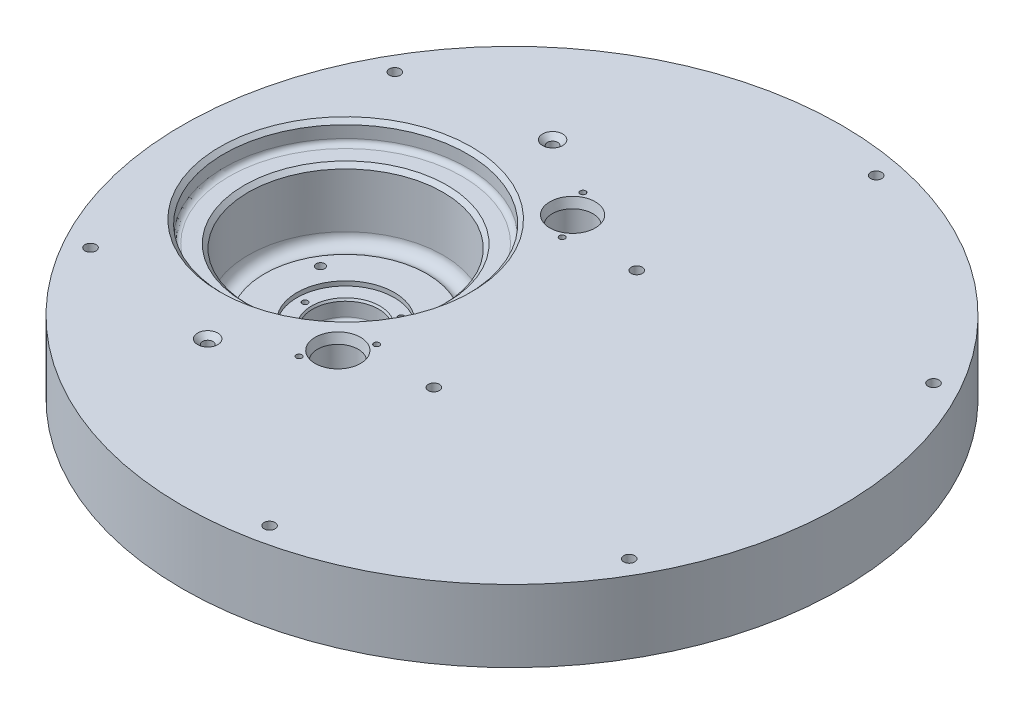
ISO-10303-21;
HEADER;
FILE_DESCRIPTION(('STEP AP214'),'2;1');
FILE_NAME('part.step','',(''),(''),'','','');
FILE_SCHEMA(('AUTOMOTIVE_DESIGN { 1 0 10303 214 1 1 1 1 }'));
ENDSEC;
DATA;
#1=APPLICATION_CONTEXT('core data for automotive mechanical design processes');
#2=APPLICATION_PROTOCOL_DEFINITION('international standard','automotive_design',2000,#1);
#3=PRODUCT_CONTEXT('',#1,'mechanical');
#4=PRODUCT('Part','Part','',(#3));
#5=PRODUCT_RELATED_PRODUCT_CATEGORY('part','',(#4));
#6=PRODUCT_DEFINITION_FORMATION('','',#4);
#7=PRODUCT_DEFINITION_CONTEXT('part definition',#1,'design');
#8=PRODUCT_DEFINITION('design','',#6,#7);
#9=PRODUCT_DEFINITION_SHAPE('','',#8);
#10=(LENGTH_UNIT() NAMED_UNIT(*) SI_UNIT(.MILLI.,.METRE.));
#11=(NAMED_UNIT(*) PLANE_ANGLE_UNIT() SI_UNIT($,.RADIAN.));
#12=(NAMED_UNIT(*) SI_UNIT($,.STERADIAN.) SOLID_ANGLE_UNIT());
#13=UNCERTAINTY_MEASURE_WITH_UNIT(LENGTH_MEASURE(1.E-05),#10,'distance_accuracy_value','');
#14=(GEOMETRIC_REPRESENTATION_CONTEXT(3) GLOBAL_UNCERTAINTY_ASSIGNED_CONTEXT((#13)) GLOBAL_UNIT_ASSIGNED_CONTEXT((#10,
#11,#12)) REPRESENTATION_CONTEXT('',''));
#15=CARTESIAN_POINT('',(0.,0.,0.));
#16=DIRECTION('',(0.,0.,1.));
#17=DIRECTION('',(1.,0.,0.));
#18=AXIS2_PLACEMENT_3D('',#15,#16,#17);
#19=CARTESIAN_POINT('',(10.795,-22.5425,-53.975));
#20=DIRECTION('',(0.,-1.,0.));
#21=DIRECTION('',(0.,0.,-1.));
#22=AXIS2_PLACEMENT_3D('',#19,#20,#21);
#23=CYLINDRICAL_SURFACE('',#22,1.63195);
#24=CARTESIAN_POINT('',(10.795,-1.52400000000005,-53.975));
#25=DIRECTION('',(0.,1.,0.));
#26=DIRECTION('',(0.,0.,1.));
#27=AXIS2_PLACEMENT_3D('',#24,#25,#26);
#28=CIRCLE('',#27,1.63195);
#29=CARTESIAN_POINT('',(10.795,-1.52400000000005,-52.34305));
#30=VERTEX_POINT('',#29);
#31=EDGE_CURVE('E1415',#30,#30,#28,.T.);
#32=ORIENTED_EDGE('',*,*,#31,.T.);
#33=EDGE_LOOP('',(#32));
#34=FACE_BOUND('',#33,.T.);
#35=CARTESIAN_POINT('',(10.795,-6.6675,-53.975));
#36=DIRECTION('',(0.,-1.,0.));
#37=DIRECTION('',(0.,0.,-1.));
#38=AXIS2_PLACEMENT_3D('',#35,#36,#37);
#39=CIRCLE('',#38,1.63195);
#40=CARTESIAN_POINT('',(10.795,-6.6675,-55.60695));
#41=VERTEX_POINT('',#40);
#42=EDGE_CURVE('E438',#41,#41,#39,.F.);
#43=ORIENTED_EDGE('',*,*,#42,.F.);
#44=EDGE_LOOP('',(#43));
#45=FACE_BOUND('',#44,.T.);
#46=ADVANCED_FACE('F38',(#34,#45),#23,.F.);
#47=CARTESIAN_POINT('',(10.795,-22.5425,53.975));
#48=DIRECTION('',(0.,-1.,0.));
#49=DIRECTION('',(0.,0.,-1.));
#50=AXIS2_PLACEMENT_3D('',#47,#48,#49);
#51=CYLINDRICAL_SURFACE('',#50,1.63195);
#52=CARTESIAN_POINT('',(10.795,-1.52399999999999,53.975));
#53=DIRECTION('',(0.,1.,0.));
#54=DIRECTION('',(0.,0.,1.));
#55=AXIS2_PLACEMENT_3D('',#52,#53,#54);
#56=CIRCLE('',#55,1.63195);
#57=CARTESIAN_POINT('',(10.795,-1.52399999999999,55.60695));
#58=VERTEX_POINT('',#57);
#59=EDGE_CURVE('E1412',#58,#58,#56,.T.);
#60=ORIENTED_EDGE('',*,*,#59,.T.);
#61=EDGE_LOOP('',(#60));
#62=FACE_BOUND('',#61,.T.);
#63=CARTESIAN_POINT('',(10.795,-6.6675,53.975));
#64=DIRECTION('',(0.,-1.,0.));
#65=DIRECTION('',(0.,0.,-1.));
#66=AXIS2_PLACEMENT_3D('',#63,#64,#65);
#67=CIRCLE('',#66,1.63195);
#68=CARTESIAN_POINT('',(10.795,-6.6675,52.34305));
#69=VERTEX_POINT('',#68);
#70=EDGE_CURVE('E579',#69,#69,#67,.F.);
#71=ORIENTED_EDGE('',*,*,#70,.F.);
#72=EDGE_LOOP('',(#71));
#73=FACE_BOUND('',#72,.T.);
#74=ADVANCED_FACE('F663',(#62,#73),#51,.F.);
#75=CARTESIAN_POINT('',(36.195,-22.5425,0.));
#76=DIRECTION('',(0.,-1.,0.));
#77=DIRECTION('',(0.,0.,-1.));
#78=AXIS2_PLACEMENT_3D('',#75,#76,#77);
#79=PLANE('',#78);
#80=CARTESIAN_POINT('',(10.795,-22.5425,-53.975));
#81=DIRECTION('',(0.,1.,0.));
#82=DIRECTION('',(0.,0.,1.));
#83=AXIS2_PLACEMENT_3D('',#80,#81,#82);
#84=CIRCLE('',#83,4.5466);
#85=CARTESIAN_POINT('',(10.795,-22.5425,-49.4284));
#86=VERTEX_POINT('',#85);
#87=EDGE_CURVE('E439',#86,#86,#84,.T.);
#88=ORIENTED_EDGE('',*,*,#87,.T.);
#89=EDGE_LOOP('',(#88));
#90=FACE_BOUND('',#89,.T.);
#91=CARTESIAN_POINT('',(34.29,-22.5425,-36.7423093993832));
#92=DIRECTION('',(0.,-1.,0.));
#93=DIRECTION('',(0.,0.,-1.));
#94=AXIS2_PLACEMENT_3D('',#91,#92,#93);
#95=CIRCLE('',#94,4.84999999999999);
#96=CARTESIAN_POINT('',(29.4864323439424,-22.5425,-36.072803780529));
#97=VERTEX_POINT('',#96);
#98=CARTESIAN_POINT('',(37.7698,-22.5425,-40.1206953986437));
#99=VERTEX_POINT('',#98);
#100=EDGE_CURVE('E598',#97,#99,#95,.T.);
#101=ORIENTED_EDGE('',*,*,#100,.F.);
#102=CARTESIAN_POINT('',(3.4925,-22.5425,0.));
#103=DIRECTION('',(0.,-1.,0.));
#104=DIRECTION('',(0.,0.,-1.));
#105=AXIS2_PLACEMENT_3D('',#102,#103,#104);
#106=CIRCLE('',#105,44.4627);
#107=CARTESIAN_POINT('',(29.4864323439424,-22.5425,36.072803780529));
#108=VERTEX_POINT('',#107);
#109=EDGE_CURVE('E922',#97,#108,#106,.F.);
#110=ORIENTED_EDGE('',*,*,#109,.T.);
#111=CARTESIAN_POINT('',(34.29,-22.5425,36.7423093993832));
#112=DIRECTION('',(0.,-1.,0.));
#113=DIRECTION('',(0.,0.,-1.));
#114=AXIS2_PLACEMENT_3D('',#111,#112,#113);
#115=CIRCLE('',#114,4.84999999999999);
#116=CARTESIAN_POINT('',(37.7698,-22.5425,40.1206953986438));
#117=VERTEX_POINT('',#116);
#118=EDGE_CURVE('E1476',#117,#108,#115,.T.);
#119=ORIENTED_EDGE('',*,*,#118,.F.);
#120=DIRECTION('',(0.,0.,-1.));
#121=VECTOR('',#120,1.);
#122=CARTESIAN_POINT('',(37.7698,-22.5425,0.));
#123=LINE('',#122,#121);
#124=CARTESIAN_POINT('',(37.7698,-22.5425,87.098877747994));
#125=VERTEX_POINT('',#124);
#126=EDGE_CURVE('E917',#117,#125,#123,.F.);
#127=ORIENTED_EDGE('',*,*,#126,.T.);
#128=CARTESIAN_POINT('',(52.07,-22.5425,0.));
#129=DIRECTION('',(0.,-1.,0.));
#130=DIRECTION('',(0.,0.,-1.));
#131=AXIS2_PLACEMENT_3D('',#128,#129,#130);
#132=CIRCLE('',#131,88.265);
#133=CARTESIAN_POINT('',(72.7202,-22.5425,85.8153801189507));
#134=VERTEX_POINT('',#133);
#135=EDGE_CURVE('E1041',#134,#125,#132,.T.);
#136=ORIENTED_EDGE('',*,*,#135,.F.);
#137=DIRECTION('',(0.,0.,1.));
#138=VECTOR('',#137,1.);
#139=CARTESIAN_POINT('',(72.7202,-22.5425,0.));
#140=LINE('',#139,#138);
#141=CARTESIAN_POINT('',(72.7202,-22.5425,22.225));
#142=VERTEX_POINT('',#141);
#143=EDGE_CURVE('E910',#134,#142,#140,.F.);
#144=ORIENTED_EDGE('',*,*,#143,.T.);
#145=CARTESIAN_POINT('',(77.47,-22.5425,22.225));
#146=DIRECTION('',(0.,-1.,0.));
#147=DIRECTION('',(0.,0.,-1.));
#148=AXIS2_PLACEMENT_3D('',#145,#146,#147);
#149=CIRCLE('',#148,4.74979999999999);
#150=CARTESIAN_POINT('',(77.47,-22.5425,17.4752));
#151=VERTEX_POINT('',#150);
#152=EDGE_CURVE('E912',#142,#151,#149,.T.);
#153=ORIENTED_EDGE('',*,*,#152,.T.);
#154=DIRECTION('',(-1.,0.,0.));
#155=VECTOR('',#154,1.);
#156=CARTESIAN_POINT('',(36.195,-22.5425,17.4752));
#157=LINE('',#156,#155);
#158=CARTESIAN_POINT('',(138.587787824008,-22.5425,17.4752));
#159=VERTEX_POINT('',#158);
#160=EDGE_CURVE('E914',#151,#159,#157,.F.);
#161=ORIENTED_EDGE('',*,*,#160,.T.);
#162=CARTESIAN_POINT('',(52.07,-22.5425,0.));
#163=DIRECTION('',(0.,-1.,0.));
#164=DIRECTION('',(0.,0.,-1.));
#165=AXIS2_PLACEMENT_3D('',#162,#163,#164);
#166=CIRCLE('',#165,88.265);
#167=CARTESIAN_POINT('',(138.587787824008,-22.5425,-17.4752));
#168=VERTEX_POINT('',#167);
#169=EDGE_CURVE('E1019',#168,#159,#166,.T.);
#170=ORIENTED_EDGE('',*,*,#169,.F.);
#171=DIRECTION('',(1.,0.,0.));
#172=VECTOR('',#171,1.);
#173=CARTESIAN_POINT('',(36.195,-22.5425,-17.4752));
#174=LINE('',#173,#172);
#175=CARTESIAN_POINT('',(77.47,-22.5425,-17.4752));
#176=VERTEX_POINT('',#175);
#177=EDGE_CURVE('E903',#168,#176,#174,.F.);
#178=ORIENTED_EDGE('',*,*,#177,.T.);
#179=CARTESIAN_POINT('',(77.47,-22.5425,-22.225));
#180=DIRECTION('',(0.,-1.,0.));
#181=DIRECTION('',(0.,0.,-1.));
#182=AXIS2_PLACEMENT_3D('',#179,#180,#181);
#183=CIRCLE('',#182,4.74979999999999);
#184=CARTESIAN_POINT('',(72.7202,-22.5425,-22.225));
#185=VERTEX_POINT('',#184);
#186=EDGE_CURVE('E905',#176,#185,#183,.T.);
#187=ORIENTED_EDGE('',*,*,#186,.T.);
#188=DIRECTION('',(0.,0.,1.));
#189=VECTOR('',#188,1.);
#190=CARTESIAN_POINT('',(72.7202,-22.5425,0.));
#191=LINE('',#190,#189);
#192=CARTESIAN_POINT('',(72.7202,-22.5425,-85.8153801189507));
#193=VERTEX_POINT('',#192);
#194=EDGE_CURVE('E907',#185,#193,#191,.F.);
#195=ORIENTED_EDGE('',*,*,#194,.T.);
#196=CARTESIAN_POINT('',(52.07,-22.5425,0.));
#197=DIRECTION('',(0.,-1.,0.));
#198=DIRECTION('',(0.,0.,-1.));
#199=AXIS2_PLACEMENT_3D('',#196,#197,#198);
#200=CIRCLE('',#199,88.265);
#201=CARTESIAN_POINT('',(37.7698,-22.5425,-87.098877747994));
#202=VERTEX_POINT('',#201);
#203=EDGE_CURVE('E1481',#202,#193,#200,.T.);
#204=ORIENTED_EDGE('',*,*,#203,.F.);
#205=DIRECTION('',(0.,0.,-1.));
#206=VECTOR('',#205,1.);
#207=CARTESIAN_POINT('',(37.7698,-22.5425,0.));
#208=LINE('',#207,#206);
#209=EDGE_CURVE('E919',#202,#99,#208,.F.);
#210=ORIENTED_EDGE('',*,*,#209,.T.);
#211=EDGE_LOOP('',(#101,#110,#119,#127,#136,#144,#153,#161,#170,#178,#187,#195,#204,#210));
#212=FACE_BOUND('',#211,.T.);
#213=CARTESIAN_POINT('',(10.795,-22.5425,53.975));
#214=DIRECTION('',(0.,-1.,0.));
#215=DIRECTION('',(0.,0.,-1.));
#216=AXIS2_PLACEMENT_3D('',#213,#214,#215);
#217=CIRCLE('',#216,4.5466);
#218=CARTESIAN_POINT('',(10.795,-22.5425,49.4284));
#219=VERTEX_POINT('',#218);
#220=EDGE_CURVE('E1494',#219,#219,#217,.T.);
#221=ORIENTED_EDGE('',*,*,#220,.F.);
#222=EDGE_LOOP('',(#221));
#223=FACE_BOUND('',#222,.T.);
#224=CARTESIAN_POINT('',(52.07,-22.5425,0.));
#225=DIRECTION('',(0.,-1.,0.));
#226=DIRECTION('',(0.,0.,-1.));
#227=AXIS2_PLACEMENT_3D('',#224,#225,#226);
#228=CIRCLE('',#227,103.1621);
#229=CARTESIAN_POINT('',(52.07,-22.5425,-103.1621));
#230=VERTEX_POINT('',#229);
#231=EDGE_CURVE('E1382',#230,#230,#228,.T.);
#232=ORIENTED_EDGE('',*,*,#231,.T.);
#233=EDGE_LOOP('',(#232));
#234=FACE_BOUND('',#233,.T.);
#235=ADVANCED_FACE('F669',(#90,#212,#223,#234),#79,.T.);
#236=CARTESIAN_POINT('',(3.4925,89.7107015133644,0.));
#237=DIRECTION('',(0.,-1.,0.));
#238=DIRECTION('',(0.,0.,-1.));
#239=AXIS2_PLACEMENT_3D('',#236,#237,#238);
#240=CYLINDRICAL_SURFACE('',#239,39.6875);
#241=DIRECTION('',(0.,1.,0.));
#242=VECTOR('',#241,1.);
#243=CARTESIAN_POINT('',(28.987119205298,-246.305179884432,-30.4158190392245));
#244=LINE('',#243,#242);
#245=CARTESIAN_POINT('',(28.987119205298,-36.322,-30.4158190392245));
#246=VERTEX_POINT('',#245);
#247=CARTESIAN_POINT('',(28.987119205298,-27.3177,-30.4158190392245));
#248=VERTEX_POINT('',#247);
#249=EDGE_CURVE('E1068',#246,#248,#244,.T.);
#250=ORIENTED_EDGE('',*,*,#249,.F.);
#251=CARTESIAN_POINT('',(3.4925,-36.322,0.));
#252=DIRECTION('',(0.,-1.,0.));
#253=DIRECTION('',(0.,0.,-1.));
#254=AXIS2_PLACEMENT_3D('',#251,#252,#253);
#255=CIRCLE('',#254,39.6875);
#256=CARTESIAN_POINT('',(28.987119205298,-36.322,30.4158190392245));
#257=VERTEX_POINT('',#256);
#258=EDGE_CURVE('E60',#246,#257,#255,.F.);
#259=ORIENTED_EDGE('',*,*,#258,.T.);
#260=DIRECTION('',(0.,1.,0.));
#261=VECTOR('',#260,1.);
#262=CARTESIAN_POINT('',(28.987119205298,-246.305179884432,30.4158190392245));
#263=LINE('',#262,#261);
#264=CARTESIAN_POINT('',(28.987119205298,-27.3177,30.4158190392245));
#265=VERTEX_POINT('',#264);
#266=EDGE_CURVE('E1485',#257,#265,#263,.T.);
#267=ORIENTED_EDGE('',*,*,#266,.T.);
#268=CARTESIAN_POINT('',(3.4925,-27.3177,0.));
#269=DIRECTION('',(0.,-1.,0.));
#270=DIRECTION('',(0.,0.,-1.));
#271=AXIS2_PLACEMENT_3D('',#268,#269,#270);
#272=CIRCLE('',#271,39.6875);
#273=EDGE_CURVE('E874',#265,#248,#272,.T.);
#274=ORIENTED_EDGE('',*,*,#273,.T.);
#275=EDGE_LOOP('',(#250,#259,#267,#274));
#276=FACE_BOUND('',#275,.T.);
#277=ADVANCED_FACE('F676',(#276),#240,.T.);
#278=CARTESIAN_POINT('',(177.8,0.,0.));
#279=DIRECTION('',(0.,1.,0.));
#280=DIRECTION('',(0.,0.,1.));
#281=AXIS2_PLACEMENT_3D('',#278,#279,#280);
#282=PLANE('',#281);
#283=CARTESIAN_POINT('',(29.845,0.,-44.4412752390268));
#284=DIRECTION('',(0.,1.,0.));
#285=DIRECTION('',(0.,0.,1.));
#286=AXIS2_PLACEMENT_3D('',#283,#284,#285);
#287=CIRCLE('',#286,0.88899999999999);
#288=CARTESIAN_POINT('',(29.845,0.,-43.5522752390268));
#289=VERTEX_POINT('',#288);
#290=EDGE_CURVE('E473',#289,#289,#287,.T.);
#291=ORIENTED_EDGE('',*,*,#290,.F.);
#292=EDGE_LOOP('',(#291));
#293=FACE_BOUND('',#292,.T.);
#294=CARTESIAN_POINT('',(38.735,0.,-29.0433435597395));
#295=DIRECTION('',(0.,1.,0.));
#296=DIRECTION('',(0.,0.,1.));
#297=AXIS2_PLACEMENT_3D('',#294,#295,#296);
#298=CIRCLE('',#297,0.888999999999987);
#299=CARTESIAN_POINT('',(38.735,0.,-28.1543435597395));
#300=VERTEX_POINT('',#299);
#301=EDGE_CURVE('E480',#300,#300,#298,.T.);
#302=ORIENTED_EDGE('',*,*,#301,.F.);
#303=EDGE_LOOP('',(#302));
#304=FACE_BOUND('',#303,.T.);
#305=CARTESIAN_POINT('',(38.735,0.,29.0433435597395));
#306=DIRECTION('',(0.,1.,0.));
#307=DIRECTION('',(0.,0.,1.));
#308=AXIS2_PLACEMENT_3D('',#305,#306,#307);
#309=CIRCLE('',#308,0.888999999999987);
#310=CARTESIAN_POINT('',(38.735,0.,29.9323435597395));
#311=VERTEX_POINT('',#310);
#312=EDGE_CURVE('E486',#311,#311,#309,.T.);
#313=ORIENTED_EDGE('',*,*,#312,.F.);
#314=EDGE_LOOP('',(#313));
#315=FACE_BOUND('',#314,.T.);
#316=CARTESIAN_POINT('',(29.845,0.,44.4412752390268));
#317=DIRECTION('',(0.,1.,0.));
#318=DIRECTION('',(0.,0.,1.));
#319=AXIS2_PLACEMENT_3D('',#316,#317,#318);
#320=CIRCLE('',#319,0.888999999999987);
#321=CARTESIAN_POINT('',(29.845,0.,45.3302752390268));
#322=VERTEX_POINT('',#321);
#323=EDGE_CURVE('E492',#322,#322,#320,.T.);
#324=ORIENTED_EDGE('',*,*,#323,.F.);
#325=EDGE_LOOP('',(#324));
#326=FACE_BOUND('',#325,.T.);
#327=CARTESIAN_POINT('',(71.12,0.,-94.9452416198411));
#328=DIRECTION('',(0.,1.,0.));
#329=DIRECTION('',(0.,0.,1.));
#330=AXIS2_PLACEMENT_3D('',#327,#328,#329);
#331=CIRCLE('',#330,1.72719999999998);
#332=CARTESIAN_POINT('',(71.12,0.,-93.2180416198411));
#333=VERTEX_POINT('',#332);
#334=EDGE_CURVE('E516',#333,#333,#331,.T.);
#335=ORIENTED_EDGE('',*,*,#334,.F.);
#336=EDGE_LOOP('',(#335));
#337=FACE_BOUND('',#336,.T.);
#338=CARTESIAN_POINT('',(-32.2470254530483,0.,-47.625));
#339=DIRECTION('',(0.,1.,0.));
#340=DIRECTION('',(0.,0.,1.));
#341=AXIS2_PLACEMENT_3D('',#338,#339,#340);
#342=CIRCLE('',#341,1.72719999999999);
#343=CARTESIAN_POINT('',(-32.2470254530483,0.,-45.8978));
#344=VERTEX_POINT('',#343);
#345=EDGE_CURVE('E522',#344,#344,#342,.T.);
#346=ORIENTED_EDGE('',*,*,#345,.F.);
#347=EDGE_LOOP('',(#346));
#348=FACE_BOUND('',#347,.T.);
#349=CARTESIAN_POINT('',(-32.2470254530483,0.,47.625));
#350=DIRECTION('',(0.,1.,0.));
#351=DIRECTION('',(0.,0.,1.));
#352=AXIS2_PLACEMENT_3D('',#349,#350,#351);
#353=CIRCLE('',#352,1.72719999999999);
#354=CARTESIAN_POINT('',(-32.2470254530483,0.,49.3522));
#355=VERTEX_POINT('',#354);
#356=EDGE_CURVE('E528',#355,#355,#353,.T.);
#357=ORIENTED_EDGE('',*,*,#356,.F.);
#358=EDGE_LOOP('',(#357));
#359=FACE_BOUND('',#358,.T.);
#360=CARTESIAN_POINT('',(71.12,0.,94.9452416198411));
#361=DIRECTION('',(0.,1.,0.));
#362=DIRECTION('',(0.,0.,1.));
#363=AXIS2_PLACEMENT_3D('',#360,#361,#362);
#364=CIRCLE('',#363,1.72719999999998);
#365=CARTESIAN_POINT('',(71.12,0.,96.6724416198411));
#366=VERTEX_POINT('',#365);
#367=EDGE_CURVE('E534',#366,#366,#364,.T.);
#368=ORIENTED_EDGE('',*,*,#367,.F.);
#369=EDGE_LOOP('',(#368));
#370=FACE_BOUND('',#369,.T.);
#371=CARTESIAN_POINT('',(59.3684164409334,0.,-31.75));
#372=DIRECTION('',(0.,1.,0.));
#373=DIRECTION('',(0.,0.,1.));
#374=AXIS2_PLACEMENT_3D('',#371,#372,#373);
#375=CIRCLE('',#374,1.72719999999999);
#376=CARTESIAN_POINT('',(59.3684164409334,0.,-30.0228));
#377=VERTEX_POINT('',#376);
#378=EDGE_CURVE('E540',#377,#377,#375,.T.);
#379=ORIENTED_EDGE('',*,*,#378,.F.);
#380=EDGE_LOOP('',(#379));
#381=FACE_BOUND('',#380,.T.);
#382=CARTESIAN_POINT('',(59.3684164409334,0.,31.75));
#383=DIRECTION('',(0.,1.,0.));
#384=DIRECTION('',(0.,0.,1.));
#385=AXIS2_PLACEMENT_3D('',#382,#383,#384);
#386=CIRCLE('',#385,1.72719999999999);
#387=CARTESIAN_POINT('',(59.3684164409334,0.,33.4772));
#388=VERTEX_POINT('',#387);
#389=EDGE_CURVE('E546',#388,#388,#386,.T.);
#390=ORIENTED_EDGE('',*,*,#389,.F.);
#391=EDGE_LOOP('',(#390));
#392=FACE_BOUND('',#391,.T.);
#393=CARTESIAN_POINT('',(136.387025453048,0.,47.625));
#394=DIRECTION('',(0.,1.,0.));
#395=DIRECTION('',(0.,0.,1.));
#396=AXIS2_PLACEMENT_3D('',#393,#394,#395);
#397=CIRCLE('',#396,1.72719999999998);
#398=CARTESIAN_POINT('',(136.387025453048,0.,49.3522));
#399=VERTEX_POINT('',#398);
#400=EDGE_CURVE('E552',#399,#399,#397,.T.);
#401=ORIENTED_EDGE('',*,*,#400,.F.);
#402=EDGE_LOOP('',(#401));
#403=FACE_BOUND('',#402,.T.);
#404=CARTESIAN_POINT('',(136.387025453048,0.,-47.625));
#405=DIRECTION('',(0.,1.,0.));
#406=DIRECTION('',(0.,0.,1.));
#407=AXIS2_PLACEMENT_3D('',#404,#405,#406);
#408=CIRCLE('',#407,1.72719999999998);
#409=CARTESIAN_POINT('',(136.387025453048,0.,-45.8978));
#410=VERTEX_POINT('',#409);
#411=EDGE_CURVE('E558',#410,#410,#408,.T.);
#412=ORIENTED_EDGE('',*,*,#411,.F.);
#413=EDGE_LOOP('',(#412));
#414=FACE_BOUND('',#413,.T.);
#415=CARTESIAN_POINT('',(0.,0.,0.));
#416=DIRECTION('',(0.,1.,0.));
#417=DIRECTION('',(0.,0.,1.));
#418=AXIS2_PLACEMENT_3D('',#415,#416,#417);
#419=CIRCLE('',#418,39.37);
#420=CARTESIAN_POINT('',(0.,0.,39.37));
#421=VERTEX_POINT('',#420);
#422=EDGE_CURVE('E2889',#421,#421,#419,.F.);
#423=ORIENTED_EDGE('',*,*,#422,.T.);
#424=EDGE_LOOP('',(#423));
#425=FACE_BOUND('',#424,.T.);
#426=CARTESIAN_POINT('',(34.29,0.,-36.7423093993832));
#427=DIRECTION('',(0.,1.,0.));
#428=DIRECTION('',(0.,0.,1.));
#429=AXIS2_PLACEMENT_3D('',#426,#427,#428);
#430=CIRCLE('',#429,7.112);
#431=CARTESIAN_POINT('',(34.29,0.,-29.6303093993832));
#432=VERTEX_POINT('',#431);
#433=EDGE_CURVE('E586',#432,#432,#430,.T.);
#434=ORIENTED_EDGE('',*,*,#433,.F.);
#435=EDGE_LOOP('',(#434));
#436=FACE_BOUND('',#435,.T.);
#437=CARTESIAN_POINT('',(34.29,0.,36.7423093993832));
#438=DIRECTION('',(0.,1.,0.));
#439=DIRECTION('',(0.,0.,1.));
#440=AXIS2_PLACEMENT_3D('',#437,#438,#439);
#441=CIRCLE('',#440,7.112);
#442=CARTESIAN_POINT('',(34.29,0.,43.8543093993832));
#443=VERTEX_POINT('',#442);
#444=EDGE_CURVE('E609',#443,#443,#441,.T.);
#445=ORIENTED_EDGE('',*,*,#444,.F.);
#446=EDGE_LOOP('',(#445));
#447=FACE_BOUND('',#446,.T.);
#448=CARTESIAN_POINT('',(10.795,0.,53.975));
#449=DIRECTION('',(0.,1.,0.));
#450=DIRECTION('',(0.,0.,1.));
#451=AXIS2_PLACEMENT_3D('',#448,#449,#450);
#452=CIRCLE('',#451,3.15594999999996);
#453=CARTESIAN_POINT('',(10.795,0.,57.13095));
#454=VERTEX_POINT('',#453);
#455=EDGE_CURVE('E1373',#454,#454,#452,.F.);
#456=ORIENTED_EDGE('',*,*,#455,.T.);
#457=EDGE_LOOP('',(#456));
#458=FACE_BOUND('',#457,.T.);
#459=CARTESIAN_POINT('',(10.795,0.,-53.975));
#460=DIRECTION('',(0.,1.,0.));
#461=DIRECTION('',(0.,0.,1.));
#462=AXIS2_PLACEMENT_3D('',#459,#460,#461);
#463=CIRCLE('',#462,3.15595000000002);
#464=CARTESIAN_POINT('',(10.795,0.,-50.81905));
#465=VERTEX_POINT('',#464);
#466=EDGE_CURVE('E1377',#465,#465,#463,.F.);
#467=ORIENTED_EDGE('',*,*,#466,.T.);
#468=EDGE_LOOP('',(#467));
#469=FACE_BOUND('',#468,.T.);
#470=CARTESIAN_POINT('',(52.07,0.,0.));
#471=DIRECTION('',(0.,1.,0.));
#472=DIRECTION('',(0.,0.,1.));
#473=AXIS2_PLACEMENT_3D('',#470,#471,#472);
#474=CIRCLE('',#473,103.1621);
#475=CARTESIAN_POINT('',(52.07,0.,103.1621));
#476=VERTEX_POINT('',#475);
#477=EDGE_CURVE('E1380',#476,#476,#474,.T.);
#478=ORIENTED_EDGE('',*,*,#477,.T.);
#479=EDGE_LOOP('',(#478));
#480=FACE_BOUND('',#479,.T.);
#481=ADVANCED_FACE('F679',(#293,#304,#315,#326,#337,#348,#359,#370,#381,#392,#403,#414,#425,
#436,#447,#458,#469,#480),#282,.T.);
#482=CARTESIAN_POINT('',(0.,0.,0.));
#483=DIRECTION('',(0.,-1.,0.));
#484=DIRECTION('',(0.,0.,-1.));
#485=AXIS2_PLACEMENT_3D('',#482,#483,#484);
#486=CYLINDRICAL_SURFACE('',#485,38.1);
#487=CARTESIAN_POINT('',(0.,-1.26999999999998,0.));
#488=DIRECTION('',(0.,1.,0.));
#489=DIRECTION('',(0.,0.,1.));
#490=AXIS2_PLACEMENT_3D('',#487,#488,#489);
#491=CIRCLE('',#490,38.1);
#492=CARTESIAN_POINT('',(0.,-1.26999999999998,38.1));
#493=VERTEX_POINT('',#492);
#494=EDGE_CURVE('E2886',#493,#493,#491,.T.);
#495=ORIENTED_EDGE('',*,*,#494,.T.);
#496=EDGE_LOOP('',(#495));
#497=FACE_BOUND('',#496,.T.);
#498=CARTESIAN_POINT('',(0.,-5.01650000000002,0.));
#499=DIRECTION('',(0.,1.,0.));
#500=DIRECTION('',(0.,0.,1.));
#501=AXIS2_PLACEMENT_3D('',#498,#499,#500);
#502=CIRCLE('',#501,38.1);
#503=CARTESIAN_POINT('',(0.,-5.01650000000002,38.1));
#504=VERTEX_POINT('',#503);
#505=EDGE_CURVE('E2901',#504,#504,#502,.F.);
#506=ORIENTED_EDGE('',*,*,#505,.T.);
#507=EDGE_LOOP('',(#506));
#508=FACE_BOUND('',#507,.T.);
#509=ADVANCED_FACE('F728',(#497,#508),#486,.F.);
#510=CARTESIAN_POINT('',(30.48,-6.60400000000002,0.));
#511=DIRECTION('',(0.,1.,0.));
#512=DIRECTION('',(0.,0.,1.));
#513=AXIS2_PLACEMENT_3D('',#510,#511,#512);
#514=PLANE('',#513);
#515=CARTESIAN_POINT('',(0.,-6.60400000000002,0.));
#516=DIRECTION('',(0.,1.,0.));
#517=DIRECTION('',(0.,0.,1.));
#518=AXIS2_PLACEMENT_3D('',#515,#516,#517);
#519=CIRCLE('',#518,31.75);
#520=CARTESIAN_POINT('',(0.,-6.60400000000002,31.75));
#521=VERTEX_POINT('',#520);
#522=EDGE_CURVE('E2895',#521,#521,#519,.F.);
#523=ORIENTED_EDGE('',*,*,#522,.T.);
#524=EDGE_LOOP('',(#523));
#525=FACE_BOUND('',#524,.T.);
#526=CARTESIAN_POINT('',(0.,-6.60400000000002,0.));
#527=DIRECTION('',(0.,1.,0.));
#528=DIRECTION('',(0.,0.,1.));
#529=AXIS2_PLACEMENT_3D('',#526,#527,#528);
#530=CIRCLE('',#529,36.5125);
#531=CARTESIAN_POINT('',(0.,-6.60400000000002,36.5125));
#532=VERTEX_POINT('',#531);
#533=EDGE_CURVE('E2898',#532,#532,#530,.T.);
#534=ORIENTED_EDGE('',*,*,#533,.T.);
#535=EDGE_LOOP('',(#534));
#536=FACE_BOUND('',#535,.T.);
#537=ADVANCED_FACE('F724',(#525,#536),#514,.T.);
#538=CARTESIAN_POINT('',(0.,0.,0.));
#539=DIRECTION('',(0.,-1.,0.));
#540=DIRECTION('',(0.,0.,-1.));
#541=AXIS2_PLACEMENT_3D('',#538,#539,#540);
#542=CYLINDRICAL_SURFACE('',#541,30.48);
#543=CARTESIAN_POINT('',(0.,-7.87400000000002,0.));
#544=DIRECTION('',(0.,1.,0.));
#545=DIRECTION('',(0.,0.,1.));
#546=AXIS2_PLACEMENT_3D('',#543,#544,#545);
#547=CIRCLE('',#546,30.48);
#548=CARTESIAN_POINT('',(0.,-7.87400000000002,30.48));
#549=VERTEX_POINT('',#548);
#550=EDGE_CURVE('E2892',#549,#549,#547,.T.);
#551=ORIENTED_EDGE('',*,*,#550,.T.);
#552=EDGE_LOOP('',(#551));
#553=FACE_BOUND('',#552,.T.);
#554=CARTESIAN_POINT('',(0.,-24.892,0.));
#555=DIRECTION('',(0.,-1.,0.));
#556=DIRECTION('',(0.,0.,-1.));
#557=AXIS2_PLACEMENT_3D('',#554,#555,#556);
#558=CIRCLE('',#557,30.48);
#559=CARTESIAN_POINT('',(0.,-24.892,-30.48));
#560=VERTEX_POINT('',#559);
#561=EDGE_CURVE('E1401',#560,#560,#558,.T.);
#562=ORIENTED_EDGE('',*,*,#561,.T.);
#563=EDGE_LOOP('',(#562));
#564=FACE_BOUND('',#563,.T.);
#565=ADVANCED_FACE('F720',(#553,#564),#542,.F.);
#566=CARTESIAN_POINT('',(0.,-24.892,0.));
#567=DIRECTION('',(0.,-1.,0.));
#568=DIRECTION('',(0.,0.,-1.));
#569=AXIS2_PLACEMENT_3D('',#566,#567,#568);
#570=TOROIDAL_SURFACE('',#569,27.305,3.175);
#571=CARTESIAN_POINT('',(0.,-27.432,0.));
#572=DIRECTION('',(0.,-1.,0.));
#573=DIRECTION('',(0.,0.,-1.));
#574=AXIS2_PLACEMENT_3D('',#571,#572,#573);
#575=CIRCLE('',#574,25.4);
#576=CARTESIAN_POINT('',(0.,-27.432,-25.4));
#577=VERTEX_POINT('',#576);
#578=EDGE_CURVE('E1398',#577,#577,#575,.T.);
#579=ORIENTED_EDGE('',*,*,#578,.T.);
#580=EDGE_LOOP('',(#579));
#581=FACE_BOUND('',#580,.T.);
#582=ORIENTED_EDGE('',*,*,#561,.F.);
#583=EDGE_LOOP('',(#582));
#584=FACE_BOUND('',#583,.T.);
#585=ADVANCED_FACE('F716',(#581,#584),#570,.F.);
#586=CARTESIAN_POINT('',(25.4,-27.432,0.));
#587=DIRECTION('',(0.,1.,0.));
#588=DIRECTION('',(0.,0.,1.));
#589=AXIS2_PLACEMENT_3D('',#586,#587,#588);
#590=PLANE('',#589);
#591=CARTESIAN_POINT('',(-18.697488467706,-27.432,-10.795));
#592=DIRECTION('',(0.,1.,0.));
#593=DIRECTION('',(0.,0.,1.));
#594=AXIS2_PLACEMENT_3D('',#591,#592,#593);
#595=CIRCLE('',#594,1.35254999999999);
#596=CARTESIAN_POINT('',(-18.697488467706,-27.432,-9.44245000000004));
#597=VERTEX_POINT('',#596);
#598=EDGE_CURVE('E498',#597,#597,#595,.T.);
#599=ORIENTED_EDGE('',*,*,#598,.F.);
#600=EDGE_LOOP('',(#599));
#601=FACE_BOUND('',#600,.T.);
#602=CARTESIAN_POINT('',(18.6974884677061,-27.432,-10.7949999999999));
#603=DIRECTION('',(0.,1.,0.));
#604=DIRECTION('',(0.,0.,1.));
#605=AXIS2_PLACEMENT_3D('',#602,#603,#604);
#606=CIRCLE('',#605,1.35254999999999);
#607=CARTESIAN_POINT('',(18.6974884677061,-27.432,-9.4424499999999));
#608=VERTEX_POINT('',#607);
#609=EDGE_CURVE('E504',#608,#608,#606,.T.);
#610=ORIENTED_EDGE('',*,*,#609,.F.);
#611=EDGE_LOOP('',(#610));
#612=FACE_BOUND('',#611,.T.);
#613=CARTESIAN_POINT('',(0.,-27.432,21.59));
#614=DIRECTION('',(0.,1.,0.));
#615=DIRECTION('',(0.,0.,1.));
#616=AXIS2_PLACEMENT_3D('',#613,#614,#615);
#617=CIRCLE('',#616,1.35254999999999);
#618=CARTESIAN_POINT('',(0.,-27.432,22.94255));
#619=VERTEX_POINT('',#618);
#620=EDGE_CURVE('E510',#619,#619,#617,.T.);
#621=ORIENTED_EDGE('',*,*,#620,.F.);
#622=EDGE_LOOP('',(#621));
#623=FACE_BOUND('',#622,.T.);
#624=CARTESIAN_POINT('',(0.,-27.432,0.));
#625=DIRECTION('',(0.,-1.,0.));
#626=DIRECTION('',(0.,0.,-1.));
#627=AXIS2_PLACEMENT_3D('',#624,#625,#626);
#628=CIRCLE('',#627,15.24);
#629=CARTESIAN_POINT('',(0.,-27.432,-15.24));
#630=VERTEX_POINT('',#629);
#631=EDGE_CURVE('E1395',#630,#630,#628,.T.);
#632=ORIENTED_EDGE('',*,*,#631,.T.);
#633=EDGE_LOOP('',(#632));
#634=FACE_BOUND('',#633,.T.);
#635=ORIENTED_EDGE('',*,*,#578,.F.);
#636=EDGE_LOOP('',(#635));
#637=FACE_BOUND('',#636,.T.);
#638=ADVANCED_FACE('F712',(#601,#612,#623,#634,#637),#590,.T.);
#639=CARTESIAN_POINT('',(0.,0.,0.));
#640=DIRECTION('',(0.,-1.,0.));
#641=DIRECTION('',(0.,0.,-1.));
#642=AXIS2_PLACEMENT_3D('',#639,#640,#641);
#643=CYLINDRICAL_SURFACE('',#642,15.24);
#644=CARTESIAN_POINT('',(0.,-28.829,0.));
#645=DIRECTION('',(0.,-1.,0.));
#646=DIRECTION('',(0.,0.,-1.));
#647=AXIS2_PLACEMENT_3D('',#644,#645,#646);
#648=CIRCLE('',#647,15.24);
#649=CARTESIAN_POINT('',(0.,-28.829,-15.24));
#650=VERTEX_POINT('',#649);
#651=EDGE_CURVE('E1386',#650,#650,#648,.T.);
#652=ORIENTED_EDGE('',*,*,#651,.T.);
#653=EDGE_LOOP('',(#652));
#654=FACE_BOUND('',#653,.T.);
#655=ORIENTED_EDGE('',*,*,#631,.F.);
#656=EDGE_LOOP('',(#655));
#657=FACE_BOUND('',#656,.T.);
#658=ADVANCED_FACE('F708',(#654,#657),#643,.F.);
#659=CARTESIAN_POINT('',(10.3378,-28.829,0.));
#660=DIRECTION('',(0.,1.,0.));
#661=DIRECTION('',(0.,0.,1.));
#662=AXIS2_PLACEMENT_3D('',#659,#660,#661);
#663=PLANE('',#662);
#664=CARTESIAN_POINT('',(6.3499999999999,-28.829,10.9985226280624));
#665=DIRECTION('',(0.,1.,0.));
#666=DIRECTION('',(0.,0.,1.));
#667=AXIS2_PLACEMENT_3D('',#664,#665,#666);
#668=CIRCLE('',#667,0.888999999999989);
#669=CARTESIAN_POINT('',(6.3499999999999,-28.829,11.8875226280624));
#670=VERTEX_POINT('',#669);
#671=EDGE_CURVE('E564',#670,#670,#668,.T.);
#672=ORIENTED_EDGE('',*,*,#671,.F.);
#673=EDGE_LOOP('',(#672));
#674=FACE_BOUND('',#673,.T.);
#675=CARTESIAN_POINT('',(6.35000000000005,-28.829,-10.9985226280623));
#676=DIRECTION('',(0.,1.,0.));
#677=DIRECTION('',(0.,0.,1.));
#678=AXIS2_PLACEMENT_3D('',#675,#676,#677);
#679=CIRCLE('',#678,0.888999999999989);
#680=CARTESIAN_POINT('',(6.35000000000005,-28.829,-10.1095226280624));
#681=VERTEX_POINT('',#680);
#682=EDGE_CURVE('E570',#681,#681,#679,.T.);
#683=ORIENTED_EDGE('',*,*,#682,.F.);
#684=EDGE_LOOP('',(#683));
#685=FACE_BOUND('',#684,.T.);
#686=CARTESIAN_POINT('',(-12.7,-28.829,0.));
#687=DIRECTION('',(0.,1.,0.));
#688=DIRECTION('',(0.,0.,1.));
#689=AXIS2_PLACEMENT_3D('',#686,#687,#688);
#690=CIRCLE('',#689,0.888999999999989);
#691=CARTESIAN_POINT('',(-12.7,-28.829,0.88899999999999));
#692=VERTEX_POINT('',#691);
#693=EDGE_CURVE('E580',#692,#692,#690,.T.);
#694=ORIENTED_EDGE('',*,*,#693,.F.);
#695=EDGE_LOOP('',(#694));
#696=FACE_BOUND('',#695,.T.);
#697=CARTESIAN_POINT('',(0.,-28.829,0.));
#698=DIRECTION('',(0.,1.,0.));
#699=DIRECTION('',(0.,0.,1.));
#700=AXIS2_PLACEMENT_3D('',#697,#698,#699);
#701=CIRCLE('',#700,10.7187999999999);
#702=CARTESIAN_POINT('',(0.,-28.829,10.7187999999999));
#703=VERTEX_POINT('',#702);
#704=EDGE_CURVE('E1404',#703,#703,#701,.F.);
#705=ORIENTED_EDGE('',*,*,#704,.T.);
#706=EDGE_LOOP('',(#705));
#707=FACE_BOUND('',#706,.T.);
#708=ORIENTED_EDGE('',*,*,#651,.F.);
#709=EDGE_LOOP('',(#708));
#710=FACE_BOUND('',#709,.T.);
#711=ADVANCED_FACE('F704',(#674,#685,#696,#707,#710),#663,.T.);
#712=CARTESIAN_POINT('',(0.,0.,0.));
#713=DIRECTION('',(0.,-1.,0.));
#714=DIRECTION('',(0.,0.,-1.));
#715=AXIS2_PLACEMENT_3D('',#712,#713,#714);
#716=CYLINDRICAL_SURFACE('',#715,10.3378);
#717=CARTESIAN_POINT('',(0.,-33.782,0.));
#718=DIRECTION('',(0.,1.,0.));
#719=DIRECTION('',(0.,0.,1.));
#720=AXIS2_PLACEMENT_3D('',#717,#718,#719);
#721=CIRCLE('',#720,10.3378);
#722=CARTESIAN_POINT('',(0.,-33.782,10.3378));
#723=VERTEX_POINT('',#722);
#724=EDGE_CURVE('E636',#723,#723,#721,.F.);
#725=ORIENTED_EDGE('',*,*,#724,.T.);
#726=EDGE_LOOP('',(#725));
#727=FACE_BOUND('',#726,.T.);
#728=CARTESIAN_POINT('',(0.,-29.4889113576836,0.));
#729=DIRECTION('',(0.,1.,0.));
#730=DIRECTION('',(0.,0.,1.));
#731=AXIS2_PLACEMENT_3D('',#728,#729,#730);
#732=CIRCLE('',#731,10.3378);
#733=CARTESIAN_POINT('',(0.,-29.4889113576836,10.3378));
#734=VERTEX_POINT('',#733);
#735=EDGE_CURVE('E1407',#734,#734,#732,.T.);
#736=ORIENTED_EDGE('',*,*,#735,.T.);
#737=EDGE_LOOP('',(#736));
#738=FACE_BOUND('',#737,.T.);
#739=ADVANCED_FACE('F700',(#727,#738),#716,.F.);
#740=CARTESIAN_POINT('',(7.366,-34.544,0.));
#741=DIRECTION('',(0.,1.,0.));
#742=DIRECTION('',(0.,0.,1.));
#743=AXIS2_PLACEMENT_3D('',#740,#741,#742);
#744=PLANE('',#743);
#745=CARTESIAN_POINT('',(0.,-34.544,0.));
#746=DIRECTION('',(0.,1.,0.));
#747=DIRECTION('',(0.,0.,1.));
#748=AXIS2_PLACEMENT_3D('',#745,#746,#747);
#749=CIRCLE('',#748,7.51264696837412);
#750=CARTESIAN_POINT('',(0.,-34.544,7.51264696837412));
#751=VERTEX_POINT('',#750);
#752=EDGE_CURVE('E1528',#751,#751,#749,.F.);
#753=ORIENTED_EDGE('',*,*,#752,.T.);
#754=EDGE_LOOP('',(#753));
#755=FACE_BOUND('',#754,.T.);
#756=CARTESIAN_POINT('',(0.,-34.544,0.));
#757=DIRECTION('',(0.,1.,0.));
#758=DIRECTION('',(0.,0.,1.));
#759=AXIS2_PLACEMENT_3D('',#756,#757,#758);
#760=CIRCLE('',#759,9.5758);
#761=CARTESIAN_POINT('',(0.,-34.544,9.5758));
#762=VERTEX_POINT('',#761);
#763=EDGE_CURVE('E2913',#762,#762,#760,.T.);
#764=ORIENTED_EDGE('',*,*,#763,.T.);
#765=EDGE_LOOP('',(#764));
#766=FACE_BOUND('',#765,.T.);
#767=ADVANCED_FACE('F696',(#755,#766),#744,.T.);
#768=CARTESIAN_POINT('',(0.,0.,0.));
#769=DIRECTION('',(0.,-1.,0.));
#770=DIRECTION('',(0.,0.,-1.));
#771=AXIS2_PLACEMENT_3D('',#768,#769,#770);
#772=CYLINDRICAL_SURFACE('',#771,7.366);
#773=CARTESIAN_POINT('',(0.,-37.4453530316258,0.));
#774=DIRECTION('',(0.,-1.,0.));
#775=DIRECTION('',(0.,0.,-1.));
#776=AXIS2_PLACEMENT_3D('',#773,#774,#775);
#777=CIRCLE('',#776,7.366);
#778=CARTESIAN_POINT('',(0.,-37.4453530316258,-7.366));
#779=VERTEX_POINT('',#778);
#780=EDGE_CURVE('E2880',#779,#779,#777,.T.);
#781=ORIENTED_EDGE('',*,*,#780,.T.);
#782=EDGE_LOOP('',(#781));
#783=FACE_BOUND('',#782,.T.);
#784=CARTESIAN_POINT('',(0.,-34.7979999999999,0.));
#785=DIRECTION('',(0.,1.,0.));
#786=DIRECTION('',(0.,0.,1.));
#787=AXIS2_PLACEMENT_3D('',#784,#785,#786);
#788=CIRCLE('',#787,7.366);
#789=CARTESIAN_POINT('',(0.,-34.7979999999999,7.366));
#790=VERTEX_POINT('',#789);
#791=EDGE_CURVE('E2883',#790,#790,#788,.T.);
#792=ORIENTED_EDGE('',*,*,#791,.T.);
#793=EDGE_LOOP('',(#792));
#794=FACE_BOUND('',#793,.T.);
#795=ADVANCED_FACE('F692',(#783,#794),#772,.F.);
#796=CARTESIAN_POINT('',(7.366,-37.592,0.));
#797=DIRECTION('',(0.,-1.,0.));
#798=DIRECTION('',(0.,0.,-1.));
#799=AXIS2_PLACEMENT_3D('',#796,#797,#798);
#800=PLANE('',#799);
#801=CARTESIAN_POINT('',(55.2450000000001,-37.592,19.05));
#802=DIRECTION('',(0.,-1.,0.));
#803=DIRECTION('',(0.,0.,-1.));
#804=AXIS2_PLACEMENT_3D('',#801,#802,#803);
#805=CIRCLE('',#804,1.1303);
#806=CARTESIAN_POINT('',(55.2450000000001,-37.592,17.9197));
#807=VERTEX_POINT('',#806);
#808=EDGE_CURVE('E365',#807,#807,#805,.T.);
#809=ORIENTED_EDGE('',*,*,#808,.F.);
#810=EDGE_LOOP('',(#809));
#811=FACE_BOUND('',#810,.T.);
#812=CARTESIAN_POINT('',(55.245,-37.592,-19.05));
#813=DIRECTION('',(0.,-1.,0.));
#814=DIRECTION('',(0.,0.,-1.));
#815=AXIS2_PLACEMENT_3D('',#812,#813,#814);
#816=CIRCLE('',#815,1.1303);
#817=CARTESIAN_POINT('',(55.245,-37.592,-20.1803));
#818=VERTEX_POINT('',#817);
#819=EDGE_CURVE('E364',#818,#818,#816,.T.);
#820=ORIENTED_EDGE('',*,*,#819,.F.);
#821=EDGE_LOOP('',(#820));
#822=FACE_BOUND('',#821,.T.);
#823=CARTESIAN_POINT('',(55.2450000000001,-37.592,0.));
#824=DIRECTION('',(0.,-1.,0.));
#825=DIRECTION('',(0.,0.,-1.));
#826=AXIS2_PLACEMENT_3D('',#823,#824,#825);
#827=CIRCLE('',#826,1.1303);
#828=CARTESIAN_POINT('',(55.2450000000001,-37.592,-1.1303));
#829=VERTEX_POINT('',#828);
#830=EDGE_CURVE('E375',#829,#829,#827,.T.);
#831=ORIENTED_EDGE('',*,*,#830,.F.);
#832=EDGE_LOOP('',(#831));
#833=FACE_BOUND('',#832,.T.);
#834=CARTESIAN_POINT('',(74.2950000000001,-37.592,0.));
#835=DIRECTION('',(0.,-1.,0.));
#836=DIRECTION('',(0.,0.,-1.));
#837=AXIS2_PLACEMENT_3D('',#834,#835,#836);
#838=CIRCLE('',#837,1.1303);
#839=CARTESIAN_POINT('',(74.2950000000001,-37.592,-1.1303));
#840=VERTEX_POINT('',#839);
#841=EDGE_CURVE('E381',#840,#840,#838,.T.);
#842=ORIENTED_EDGE('',*,*,#841,.F.);
#843=EDGE_LOOP('',(#842));
#844=FACE_BOUND('',#843,.T.);
#845=CARTESIAN_POINT('',(93.3450000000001,-37.592,0.));
#846=DIRECTION('',(0.,-1.,0.));
#847=DIRECTION('',(0.,0.,-1.));
#848=AXIS2_PLACEMENT_3D('',#845,#846,#847);
#849=CIRCLE('',#848,1.1303);
#850=CARTESIAN_POINT('',(93.3450000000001,-37.592,-1.1303));
#851=VERTEX_POINT('',#850);
#852=EDGE_CURVE('E387',#851,#851,#849,.T.);
#853=ORIENTED_EDGE('',*,*,#852,.F.);
#854=EDGE_LOOP('',(#853));
#855=FACE_BOUND('',#854,.T.);
#856=CARTESIAN_POINT('',(112.395,-37.592,0.));
#857=DIRECTION('',(0.,-1.,0.));
#858=DIRECTION('',(0.,0.,-1.));
#859=AXIS2_PLACEMENT_3D('',#856,#857,#858);
#860=CIRCLE('',#859,1.1303);
#861=CARTESIAN_POINT('',(112.395,-37.592,-1.1303));
#862=VERTEX_POINT('',#861);
#863=EDGE_CURVE('E393',#862,#862,#860,.T.);
#864=ORIENTED_EDGE('',*,*,#863,.F.);
#865=EDGE_LOOP('',(#864));
#866=FACE_BOUND('',#865,.T.);
#867=CARTESIAN_POINT('',(55.245,-37.592,73.025));
#868=DIRECTION('',(0.,-1.,0.));
#869=DIRECTION('',(0.,0.,-1.));
#870=AXIS2_PLACEMENT_3D('',#867,#868,#869);
#871=CIRCLE('',#870,1.35255);
#872=CARTESIAN_POINT('',(55.245,-37.592,71.67245));
#873=VERTEX_POINT('',#872);
#874=EDGE_CURVE('E399',#873,#873,#871,.T.);
#875=ORIENTED_EDGE('',*,*,#874,.F.);
#876=EDGE_LOOP('',(#875));
#877=FACE_BOUND('',#876,.T.);
#878=CARTESIAN_POINT('',(55.245,-37.592,34.925));
#879=DIRECTION('',(0.,-1.,0.));
#880=DIRECTION('',(0.,0.,-1.));
#881=AXIS2_PLACEMENT_3D('',#878,#879,#880);
#882=CIRCLE('',#881,1.35255);
#883=CARTESIAN_POINT('',(55.245,-37.592,33.57245));
#884=VERTEX_POINT('',#883);
#885=EDGE_CURVE('E405',#884,#884,#882,.T.);
#886=ORIENTED_EDGE('',*,*,#885,.F.);
#887=EDGE_LOOP('',(#886));
#888=FACE_BOUND('',#887,.T.);
#889=CARTESIAN_POINT('',(55.245,-37.592,-34.925));
#890=DIRECTION('',(0.,-1.,0.));
#891=DIRECTION('',(0.,0.,-1.));
#892=AXIS2_PLACEMENT_3D('',#889,#890,#891);
#893=CIRCLE('',#892,1.35255);
#894=CARTESIAN_POINT('',(55.245,-37.592,-36.27755));
#895=VERTEX_POINT('',#894);
#896=EDGE_CURVE('E411',#895,#895,#893,.T.);
#897=ORIENTED_EDGE('',*,*,#896,.F.);
#898=EDGE_LOOP('',(#897));
#899=FACE_BOUND('',#898,.T.);
#900=CARTESIAN_POINT('',(55.245,-37.592,-73.025));
#901=DIRECTION('',(0.,-1.,0.));
#902=DIRECTION('',(0.,0.,-1.));
#903=AXIS2_PLACEMENT_3D('',#900,#901,#902);
#904=CIRCLE('',#903,1.35255);
#905=CARTESIAN_POINT('',(55.245,-37.592,-74.37755));
#906=VERTEX_POINT('',#905);
#907=EDGE_CURVE('E417',#906,#906,#904,.T.);
#908=ORIENTED_EDGE('',*,*,#907,.F.);
#909=EDGE_LOOP('',(#908));
#910=FACE_BOUND('',#909,.T.);
#911=CARTESIAN_POINT('',(55.245,-37.592,53.975));
#912=DIRECTION('',(0.,-1.,0.));
#913=DIRECTION('',(0.,0.,-1.));
#914=AXIS2_PLACEMENT_3D('',#911,#912,#913);
#915=CIRCLE('',#914,1.35255);
#916=CARTESIAN_POINT('',(55.245,-37.592,52.62245));
#917=VERTEX_POINT('',#916);
#918=EDGE_CURVE('E423',#917,#917,#915,.T.);
#919=ORIENTED_EDGE('',*,*,#918,.F.);
#920=EDGE_LOOP('',(#919));
#921=FACE_BOUND('',#920,.T.);
#922=CARTESIAN_POINT('',(55.245,-37.592,-53.975));
#923=DIRECTION('',(0.,-1.,0.));
#924=DIRECTION('',(0.,0.,-1.));
#925=AXIS2_PLACEMENT_3D('',#922,#923,#924);
#926=CIRCLE('',#925,1.35255);
#927=CARTESIAN_POINT('',(55.245,-37.592,-55.32755));
#928=VERTEX_POINT('',#927);
#929=EDGE_CURVE('E429',#928,#928,#926,.T.);
#930=ORIENTED_EDGE('',*,*,#929,.F.);
#931=EDGE_LOOP('',(#930));
#932=FACE_BOUND('',#931,.T.);
#933=CARTESIAN_POINT('',(31.75,-37.592,0.));
#934=DIRECTION('',(0.,-1.,0.));
#935=DIRECTION('',(0.,0.,-1.));
#936=AXIS2_PLACEMENT_3D('',#933,#934,#935);
#937=CIRCLE('',#936,1.13029999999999);
#938=CARTESIAN_POINT('',(31.75,-37.592,-1.13029999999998));
#939=VERTEX_POINT('',#938);
#940=EDGE_CURVE('E448',#939,#939,#937,.T.);
#941=ORIENTED_EDGE('',*,*,#940,.F.);
#942=EDGE_LOOP('',(#941));
#943=FACE_BOUND('',#942,.T.);
#944=CARTESIAN_POINT('',(0.,-37.592,-31.75));
#945=DIRECTION('',(0.,-1.,0.));
#946=DIRECTION('',(0.,0.,-1.));
#947=AXIS2_PLACEMENT_3D('',#944,#945,#946);
#948=CIRCLE('',#947,1.13029999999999);
#949=CARTESIAN_POINT('',(0.,-37.592,-32.8803));
#950=VERTEX_POINT('',#949);
#951=EDGE_CURVE('E454',#950,#950,#948,.T.);
#952=ORIENTED_EDGE('',*,*,#951,.F.);
#953=EDGE_LOOP('',(#952));
#954=FACE_BOUND('',#953,.T.);
#955=CARTESIAN_POINT('',(-31.75,-37.592,0.));
#956=DIRECTION('',(0.,-1.,0.));
#957=DIRECTION('',(0.,0.,-1.));
#958=AXIS2_PLACEMENT_3D('',#955,#956,#957);
#959=CIRCLE('',#958,1.13029999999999);
#960=CARTESIAN_POINT('',(-31.75,-37.592,-1.13029999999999));
#961=VERTEX_POINT('',#960);
#962=EDGE_CURVE('E460',#961,#961,#959,.T.);
#963=ORIENTED_EDGE('',*,*,#962,.F.);
#964=EDGE_LOOP('',(#963));
#965=FACE_BOUND('',#964,.T.);
#966=CARTESIAN_POINT('',(0.,-37.592,31.75));
#967=DIRECTION('',(0.,-1.,0.));
#968=DIRECTION('',(0.,0.,-1.));
#969=AXIS2_PLACEMENT_3D('',#966,#967,#968);
#970=CIRCLE('',#969,1.13029999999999);
#971=CARTESIAN_POINT('',(0.,-37.592,30.6197));
#972=VERTEX_POINT('',#971);
#973=EDGE_CURVE('E466',#972,#972,#970,.T.);
#974=ORIENTED_EDGE('',*,*,#973,.F.);
#975=EDGE_LOOP('',(#974));
#976=FACE_BOUND('',#975,.T.);
#977=CARTESIAN_POINT('',(77.47,-37.592,22.225));
#978=DIRECTION('',(0.,-1.,0.));
#979=DIRECTION('',(0.,0.,-1.));
#980=AXIS2_PLACEMENT_3D('',#977,#978,#979);
#981=CIRCLE('',#980,10.795);
#982=CARTESIAN_POINT('',(77.47,-37.592,11.43));
#983=VERTEX_POINT('',#982);
#984=CARTESIAN_POINT('',(66.675,-37.592,22.225));
#985=VERTEX_POINT('',#984);
#986=EDGE_CURVE('E1548',#983,#985,#981,.F.);
#987=ORIENTED_EDGE('',*,*,#986,.T.);
#988=DIRECTION('',(0.,0.,1.));
#989=VECTOR('',#988,1.);
#990=CARTESIAN_POINT('',(66.675,-37.592,78.0140172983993));
#991=LINE('',#990,#989);
#992=CARTESIAN_POINT('',(66.675,-37.592,78.2617179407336));
#993=VERTEX_POINT('',#992);
#994=EDGE_CURVE('E1550',#985,#993,#991,.T.);
#995=ORIENTED_EDGE('',*,*,#994,.T.);
#996=CARTESIAN_POINT('',(52.07,-37.592,0.));
#997=DIRECTION('',(0.,-1.,0.));
#998=DIRECTION('',(0.,0.,-1.));
#999=AXIS2_PLACEMENT_3D('',#996,#997,#998);
#1000=CIRCLE('',#999,79.6128288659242);
#1001=CARTESIAN_POINT('',(43.815,-37.592,79.1836946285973));
#1002=VERTEX_POINT('',#1001);
#1003=EDGE_CURVE('E1420',#993,#1002,#1000,.T.);
#1004=ORIENTED_EDGE('',*,*,#1003,.T.);
#1005=DIRECTION('',(0.,0.,-1.));
#1006=VECTOR('',#1005,1.);
#1007=CARTESIAN_POINT('',(43.8150000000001,-37.592,36.7423093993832));
#1008=LINE('',#1007,#1006);
#1009=CARTESIAN_POINT('',(43.8150000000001,-37.592,36.7423093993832));
#1010=VERTEX_POINT('',#1009);
#1011=EDGE_CURVE('E1537',#1002,#1010,#1008,.T.);
#1012=ORIENTED_EDGE('',*,*,#1011,.T.);
#1013=CARTESIAN_POINT('',(34.29,-37.592,36.7423093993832));
#1014=DIRECTION('',(0.,-1.,0.));
#1015=DIRECTION('',(0.,0.,-1.));
#1016=AXIS2_PLACEMENT_3D('',#1013,#1014,#1015);
#1017=CIRCLE('',#1016,9.52500000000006);
#1018=CARTESIAN_POINT('',(28.1712913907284,-37.592,29.4425128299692));
#1019=VERTEX_POINT('',#1018);
#1020=EDGE_CURVE('E1533',#1010,#1019,#1017,.F.);
#1021=ORIENTED_EDGE('',*,*,#1020,.T.);
#1022=CARTESIAN_POINT('',(3.4925,-37.592,0.));
#1023=DIRECTION('',(0.,-1.,0.));
#1024=DIRECTION('',(0.,0.,-1.));
#1025=AXIS2_PLACEMENT_3D('',#1022,#1023,#1024);
#1026=CIRCLE('',#1025,38.4174999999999);
#1027=CARTESIAN_POINT('',(28.1712913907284,-37.592,-29.4425128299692));
#1028=VERTEX_POINT('',#1027);
#1029=EDGE_CURVE('E1522',#1019,#1028,#1026,.T.);
#1030=ORIENTED_EDGE('',*,*,#1029,.T.);
#1031=CARTESIAN_POINT('',(34.29,-37.592,-36.7423093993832));
#1032=DIRECTION('',(0.,-1.,0.));
#1033=DIRECTION('',(0.,0.,-1.));
#1034=AXIS2_PLACEMENT_3D('',#1031,#1032,#1033);
#1035=CIRCLE('',#1034,9.52500000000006);
#1036=CARTESIAN_POINT('',(43.8150000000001,-37.592,-36.7423093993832));
#1037=VERTEX_POINT('',#1036);
#1038=EDGE_CURVE('E1525',#1028,#1037,#1035,.F.);
#1039=ORIENTED_EDGE('',*,*,#1038,.T.);
#1040=DIRECTION('',(0.,0.,-1.));
#1041=VECTOR('',#1040,1.);
#1042=CARTESIAN_POINT('',(43.8150000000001,-37.592,-79.0409823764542));
#1043=LINE('',#1042,#1041);
#1044=CARTESIAN_POINT('',(43.8150000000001,-37.592,-79.1836946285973));
#1045=VERTEX_POINT('',#1044);
#1046=EDGE_CURVE('E1535',#1037,#1045,#1043,.T.);
#1047=ORIENTED_EDGE('',*,*,#1046,.T.);
#1048=CARTESIAN_POINT('',(52.07,-37.592,0.));
#1049=DIRECTION('',(0.,-1.,0.));
#1050=DIRECTION('',(0.,0.,-1.));
#1051=AXIS2_PLACEMENT_3D('',#1048,#1049,#1050);
#1052=CIRCLE('',#1051,79.6128288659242);
#1053=CARTESIAN_POINT('',(66.675,-37.592,-78.2617179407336));
#1054=VERTEX_POINT('',#1053);
#1055=EDGE_CURVE('E1075',#1045,#1054,#1052,.T.);
#1056=ORIENTED_EDGE('',*,*,#1055,.T.);
#1057=DIRECTION('',(0.,0.,1.));
#1058=VECTOR('',#1057,1.);
#1059=CARTESIAN_POINT('',(66.675,-37.592,-22.225));
#1060=LINE('',#1059,#1058);
#1061=CARTESIAN_POINT('',(66.675,-37.592,-22.225));
#1062=VERTEX_POINT('',#1061);
#1063=EDGE_CURVE('E1539',#1054,#1062,#1060,.T.);
#1064=ORIENTED_EDGE('',*,*,#1063,.T.);
#1065=CARTESIAN_POINT('',(77.47,-37.592,-22.225));
#1066=DIRECTION('',(0.,-1.,0.));
#1067=DIRECTION('',(0.,0.,-1.));
#1068=AXIS2_PLACEMENT_3D('',#1065,#1066,#1067);
#1069=CIRCLE('',#1068,10.795);
#1070=CARTESIAN_POINT('',(77.47,-37.592,-11.43));
#1071=VERTEX_POINT('',#1070);
#1072=EDGE_CURVE('E1541',#1062,#1071,#1069,.F.);
#1073=ORIENTED_EDGE('',*,*,#1072,.T.);
#1074=DIRECTION('',(1.,0.,0.));
#1075=VECTOR('',#1074,1.);
#1076=CARTESIAN_POINT('',(130.663336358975,-37.592,-11.43));
#1077=LINE('',#1076,#1075);
#1078=CARTESIAN_POINT('',(130.858055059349,-37.592,-11.43));
#1079=VERTEX_POINT('',#1078);
#1080=EDGE_CURVE('E1543',#1071,#1079,#1077,.T.);
#1081=ORIENTED_EDGE('',*,*,#1080,.T.);
#1082=CARTESIAN_POINT('',(52.07,-37.592,0.));
#1083=DIRECTION('',(0.,-1.,0.));
#1084=DIRECTION('',(0.,0.,-1.));
#1085=AXIS2_PLACEMENT_3D('',#1082,#1083,#1084);
#1086=CIRCLE('',#1085,79.6128288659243);
#1087=CARTESIAN_POINT('',(130.858055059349,-37.592,11.43));
#1088=VERTEX_POINT('',#1087);
#1089=EDGE_CURVE('E1417',#1079,#1088,#1086,.T.);
#1090=ORIENTED_EDGE('',*,*,#1089,.T.);
#1091=DIRECTION('',(-1.,0.,0.));
#1092=VECTOR('',#1091,1.);
#1093=CARTESIAN_POINT('',(77.47,-37.592,11.43));
#1094=LINE('',#1093,#1092);
#1095=EDGE_CURVE('E1546',#1088,#983,#1094,.T.);
#1096=ORIENTED_EDGE('',*,*,#1095,.T.);
#1097=EDGE_LOOP('',(#987,#995,#1004,#1012,#1021,#1030,#1039,#1047,#1056,#1064,#1073,#1081,#1090,#1096));
#1098=FACE_BOUND('',#1097,.T.);
#1099=CARTESIAN_POINT('',(0.,-37.592,0.));
#1100=DIRECTION('',(0.,-1.,0.));
#1101=DIRECTION('',(0.,0.,-1.));
#1102=AXIS2_PLACEMENT_3D('',#1099,#1100,#1101);
#1103=CIRCLE('',#1102,7.62000000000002);
#1104=CARTESIAN_POINT('',(0.,-37.592,-7.62000000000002));
#1105=VERTEX_POINT('',#1104);
#1106=EDGE_CURVE('E2877',#1105,#1105,#1103,.F.);
#1107=ORIENTED_EDGE('',*,*,#1106,.T.);
#1108=EDGE_LOOP('',(#1107));
#1109=FACE_BOUND('',#1108,.T.);
#1110=ADVANCED_FACE('F689',(#811,#822,#833,#844,#855,#866,#877,#888,#899,#910,#921,#932,#943,
#954,#965,#976,#1098,#1109),#800,.T.);
#1111=CARTESIAN_POINT('',(0.,-28.829,0.));
#1112=DIRECTION('',(0.,1.,0.));
#1113=DIRECTION('',(0.,0.,1.));
#1114=AXIS2_PLACEMENT_3D('',#1111,#1112,#1113);
#1115=CONICAL_SURFACE('',#1114,10.7187999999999,0.523598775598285);
#1116=ORIENTED_EDGE('',*,*,#735,.F.);
#1117=EDGE_LOOP('',(#1116));
#1118=FACE_BOUND('',#1117,.T.);
#1119=ORIENTED_EDGE('',*,*,#704,.F.);
#1120=EDGE_LOOP('',(#1119));
#1121=FACE_BOUND('',#1120,.T.);
#1122=ADVANCED_FACE('F684',(#1118,#1121),#1115,.F.);
#1123=CARTESIAN_POINT('',(52.07,-37.592,0.));
#1124=DIRECTION('',(0.,1.,0.));
#1125=DIRECTION('',(0.,0.,1.));
#1126=AXIS2_PLACEMENT_3D('',#1123,#1124,#1125);
#1127=CYLINDRICAL_SURFACE('',#1126,103.1621);
#1128=ORIENTED_EDGE('',*,*,#231,.F.);
#1129=EDGE_LOOP('',(#1128));
#1130=FACE_BOUND('',#1129,.T.);
#1131=ORIENTED_EDGE('',*,*,#477,.F.);
#1132=EDGE_LOOP('',(#1131));
#1133=FACE_BOUND('',#1132,.T.);
#1134=ADVANCED_FACE('F680',(#1130,#1133),#1127,.T.);
#1135=CARTESIAN_POINT('',(10.795,-22.5425,53.975));
#1136=DIRECTION('',(0.,-1.,0.));
#1137=DIRECTION('',(0.,0.,-1.));
#1138=AXIS2_PLACEMENT_3D('',#1135,#1136,#1137);
#1139=CYLINDRICAL_SURFACE('',#1138,3.4544);
#1140=CARTESIAN_POINT('',(10.795,-10.6070156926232,53.975));
#1141=DIRECTION('',(0.,-1.,0.));
#1142=DIRECTION('',(0.,0.,-1.));
#1143=AXIS2_PLACEMENT_3D('',#1140,#1141,#1142);
#1144=CIRCLE('',#1143,3.4544);
#1145=CARTESIAN_POINT('',(10.795,-10.6070156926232,50.5206));
#1146=VERTEX_POINT('',#1145);
#1147=EDGE_CURVE('E1520',#1146,#1146,#1144,.F.);
#1148=ORIENTED_EDGE('',*,*,#1147,.T.);
#1149=EDGE_LOOP('',(#1148));
#1150=FACE_BOUND('',#1149,.T.);
#1151=CARTESIAN_POINT('',(10.795,-19.9702213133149,53.975));
#1152=DIRECTION('',(0.,-1.,0.));
#1153=DIRECTION('',(0.,0.,-1.));
#1154=AXIS2_PLACEMENT_3D('',#1151,#1152,#1153);
#1155=CIRCLE('',#1154,3.4544);
#1156=CARTESIAN_POINT('',(10.795,-19.9702213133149,50.5206));
#1157=VERTEX_POINT('',#1156);
#1158=EDGE_CURVE('E1383',#1157,#1157,#1155,.T.);
#1159=ORIENTED_EDGE('',*,*,#1158,.T.);
#1160=EDGE_LOOP('',(#1159));
#1161=FACE_BOUND('',#1160,.T.);
#1162=ADVANCED_FACE('F683',(#1150,#1161),#1139,.F.);
#1163=CARTESIAN_POINT('',(10.795,-20.6629,53.975));
#1164=DIRECTION('',(0.,-1.,0.));
#1165=DIRECTION('',(0.,0.,-1.));
#1166=AXIS2_PLACEMENT_3D('',#1163,#1164,#1165);
#1167=CONICAL_SURFACE('',#1166,4.14707868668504,0.785398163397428);
#1168=ORIENTED_EDGE('',*,*,#1158,.F.);
#1169=EDGE_LOOP('',(#1168));
#1170=FACE_BOUND('',#1169,.T.);
#1171=CARTESIAN_POINT('',(10.795,-20.6629,53.975));
#1172=DIRECTION('',(0.,-1.,0.));
#1173=DIRECTION('',(0.,0.,-1.));
#1174=AXIS2_PLACEMENT_3D('',#1171,#1172,#1173);
#1175=CIRCLE('',#1174,4.14707868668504);
#1176=CARTESIAN_POINT('',(10.795,-20.6629,49.827921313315));
#1177=VERTEX_POINT('',#1176);
#1178=EDGE_CURVE('E1389',#1177,#1177,#1175,.T.);
#1179=ORIENTED_EDGE('',*,*,#1178,.T.);
#1180=EDGE_LOOP('',(#1179));
#1181=FACE_BOUND('',#1180,.T.);
#1182=ADVANCED_FACE('F1499',(#1170,#1181),#1167,.F.);
#1183=CARTESIAN_POINT('',(10.795,-22.5425,53.975));
#1184=DIRECTION('',(0.,-1.,0.));
#1185=DIRECTION('',(0.,0.,-1.));
#1186=AXIS2_PLACEMENT_3D('',#1183,#1184,#1185);
#1187=CONICAL_SURFACE('',#1186,4.5466,0.209439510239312);
#1188=ORIENTED_EDGE('',*,*,#1178,.F.);
#1189=EDGE_LOOP('',(#1188));
#1190=FACE_BOUND('',#1189,.T.);
#1191=ORIENTED_EDGE('',*,*,#220,.T.);
#1192=EDGE_LOOP('',(#1191));
#1193=FACE_BOUND('',#1192,.T.);
#1194=ADVANCED_FACE('F743',(#1190,#1193),#1187,.F.);
#1195=CARTESIAN_POINT('',(10.795,0.,53.975));
#1196=DIRECTION('',(0.,1.,0.));
#1197=DIRECTION('',(0.,0.,1.));
#1198=AXIS2_PLACEMENT_3D('',#1195,#1196,#1197);
#1199=CONICAL_SURFACE('',#1198,3.15594999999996,0.785398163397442);
#1200=ORIENTED_EDGE('',*,*,#59,.F.);
#1201=EDGE_LOOP('',(#1200));
#1202=FACE_BOUND('',#1201,.T.);
#1203=ORIENTED_EDGE('',*,*,#455,.F.);
#1204=EDGE_LOOP('',(#1203));
#1205=FACE_BOUND('',#1204,.T.);
#1206=ADVANCED_FACE('F739',(#1202,#1205),#1199,.F.);
#1207=CARTESIAN_POINT('',(10.795,0.,-53.975));
#1208=DIRECTION('',(0.,1.,0.));
#1209=DIRECTION('',(0.,0.,1.));
#1210=AXIS2_PLACEMENT_3D('',#1207,#1208,#1209);
#1211=CONICAL_SURFACE('',#1210,3.15595000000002,0.785398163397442);
#1212=ORIENTED_EDGE('',*,*,#31,.F.);
#1213=EDGE_LOOP('',(#1212));
#1214=FACE_BOUND('',#1213,.T.);
#1215=ORIENTED_EDGE('',*,*,#466,.F.);
#1216=EDGE_LOOP('',(#1215));
#1217=FACE_BOUND('',#1216,.T.);
#1218=ADVANCED_FACE('F742',(#1214,#1217),#1211,.F.);
#1219=CARTESIAN_POINT('',(52.07,-246.305179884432,0.));
#1220=DIRECTION('',(0.,1.,0.));
#1221=DIRECTION('',(0.,0.,1.));
#1222=AXIS2_PLACEMENT_3D('',#1219,#1220,#1221);
#1223=CYLINDRICAL_SURFACE('',#1222,88.265);
#1224=ORIENTED_EDGE('',*,*,#135,.T.);
#1225=CARTESIAN_POINT('',(37.7698,-22.5425,87.098877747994));
#1226=CARTESIAN_POINT('',(37.8999110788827,-22.5425084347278,87.1202359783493));
#1227=CARTESIAN_POINT('',(38.0296462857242,-22.5478043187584,87.1412388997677));
#1228=CARTESIAN_POINT('',(38.288364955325,-22.5689709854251,87.1825341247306));
#1229=CARTESIAN_POINT('',(38.4173484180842,-22.5848417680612,87.2028264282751));
#1230=CARTESIAN_POINT('',(38.5459560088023,-22.606,87.2227634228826));
#1231=B_SPLINE_CURVE_WITH_KNOTS('',3,(#1225,#1226,#1227,#1228,#1229,#1230),.UNSPECIFIED.,.F.,
.F.,(4,2,4),(0.,0.394592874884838,0.789185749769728),.UNSPECIFIED.);
#1232=CARTESIAN_POINT('',(38.5459560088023,-22.6059999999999,87.2227634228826));
#1233=VERTEX_POINT('',#1232);
#1234=EDGE_CURVE('E973',#125,#1233,#1231,.T.);
#1235=ORIENTED_EDGE('',*,*,#1234,.T.);
#1236=CARTESIAN_POINT('',(52.07,-22.6059999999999,0.));
#1237=DIRECTION('',(0.,-1.,0.));
#1238=DIRECTION('',(0.,0.,-1.));
#1239=AXIS2_PLACEMENT_3D('',#1236,#1237,#1238);
#1240=CIRCLE('',#1239,88.265);
#1241=CARTESIAN_POINT('',(71.9440439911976,-22.6059999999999,85.9984453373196));
#1242=VERTEX_POINT('',#1241);
#1243=EDGE_CURVE('E1427',#1233,#1242,#1240,.F.);
#1244=ORIENTED_EDGE('',*,*,#1243,.T.);
#1245=CARTESIAN_POINT('',(71.9440439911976,-22.6059999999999,85.9984453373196));
#1246=CARTESIAN_POINT('',(72.0727211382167,-22.5848360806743,85.9687122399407));
#1247=CARTESIAN_POINT('',(72.2017393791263,-22.5689624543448,85.9385902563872));
#1248=CARTESIAN_POINT('',(72.4604580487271,-22.5477957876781,85.8775685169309));
#1249=CARTESIAN_POINT('',(72.5901584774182,-22.542502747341,85.8466687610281));
#1250=CARTESIAN_POINT('',(72.7202,-22.5425,85.8153801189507));
#1251=B_SPLINE_CURVE_WITH_KNOTS('',3,(#1245,#1246,#1247,#1248,#1249,#1250),.UNSPECIFIED.,.F.,
.F.,(4,2,4),(0.,0.400306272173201,0.80061254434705),.UNSPECIFIED.);
#1252=EDGE_CURVE('E789',#1242,#134,#1251,.T.);
#1253=ORIENTED_EDGE('',*,*,#1252,.T.);
#1254=EDGE_LOOP('',(#1224,#1235,#1244,#1253));
#1255=FACE_BOUND('',#1254,.T.);
#1256=ADVANCED_FACE('F747',(#1255),#1223,.T.);
#1257=CARTESIAN_POINT('',(42.545,-246.305179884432,87.7495561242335));
#1258=DIRECTION('',(1.,0.,0.));
#1259=DIRECTION('',(0.,0.,-1.));
#1260=AXIS2_PLACEMENT_3D('',#1257,#1258,#1259);
#1261=PLANE('',#1260);
#1262=DIRECTION('',(0.,1.,0.));
#1263=VECTOR('',#1262,1.);
#1264=CARTESIAN_POINT('',(42.545,-246.305179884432,36.7423093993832));
#1265=LINE('',#1264,#1263);
#1266=CARTESIAN_POINT('',(42.545,-36.322,36.7423093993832));
#1267=VERTEX_POINT('',#1266);
#1268=CARTESIAN_POINT('',(42.545,-27.3177,36.7423093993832));
#1269=VERTEX_POINT('',#1268);
#1270=EDGE_CURVE('E1043',#1267,#1269,#1265,.T.);
#1271=ORIENTED_EDGE('',*,*,#1270,.F.);
#1272=DIRECTION('',(0.,0.,1.));
#1273=VECTOR('',#1272,1.);
#1274=CARTESIAN_POINT('',(42.545,-36.322,79.0409823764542));
#1275=LINE('',#1274,#1273);
#1276=CARTESIAN_POINT('',(42.545,-36.3219999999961,79.7794731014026));
#1277=VERTEX_POINT('',#1276);
#1278=EDGE_CURVE('E1081',#1267,#1277,#1275,.T.);
#1279=ORIENTED_EDGE('',*,*,#1278,.T.);
#1280=CARTESIAN_POINT('',(42.545,-37.592,79.0409823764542));
#1281=CARTESIAN_POINT('',(42.545,-36.3433907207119,79.7670823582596));
#1282=CARTESIAN_POINT('',(42.545,-35.0947195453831,80.4930758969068));
#1283=CARTESIAN_POINT('',(42.545,-32.5972624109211,81.944865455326));
#1284=CARTESIAN_POINT('',(42.545,-31.3484764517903,82.6706614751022));
#1285=CARTESIAN_POINT('',(42.545,-28.8507987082,84.1220713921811));
#1286=CARTESIAN_POINT('',(42.545,-27.6019069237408,84.8476852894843));
#1287=CARTESIAN_POINT('',(42.545,-25.1040251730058,86.2987441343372));
#1288=CARTESIAN_POINT('',(42.545,-23.8550352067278,87.0241890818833));
#1289=CARTESIAN_POINT('',(42.545,-22.6059999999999,87.7495561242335));
#1290=B_SPLINE_CURVE_WITH_KNOTS('',3,(#1280,#1281,#1282,#1283,#1284,#1285,#1286,#1287,#1288,
#1289),.UNSPECIFIED.,.F.,.F.,(4,2,2,2,4),(0.,4.33315321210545,8.66630633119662,12.9994594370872,
17.3326126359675),.UNSPECIFIED.);
#1291=CARTESIAN_POINT('',(42.545,-27.3176999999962,85.0127629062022));
#1292=VERTEX_POINT('',#1291);
#1293=EDGE_CURVE('E761',#1277,#1292,#1290,.T.);
#1294=ORIENTED_EDGE('',*,*,#1293,.T.);
#1295=DIRECTION('',(0.,0.,-1.));
#1296=VECTOR('',#1295,1.);
#1297=CARTESIAN_POINT('',(42.545,-27.3177,87.7495561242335));
#1298=LINE('',#1297,#1296);
#1299=EDGE_CURVE('E891',#1292,#1269,#1298,.T.);
#1300=ORIENTED_EDGE('',*,*,#1299,.T.);
#1301=EDGE_LOOP('',(#1271,#1279,#1294,#1300));
#1302=FACE_BOUND('',#1301,.T.);
#1303=ADVANCED_FACE('F962',(#1302),#1261,.F.);
#1304=CARTESIAN_POINT('',(34.29,-246.305179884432,36.7423093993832));
#1305=DIRECTION('',(0.,1.,0.));
#1306=DIRECTION('',(0.,0.,1.));
#1307=AXIS2_PLACEMENT_3D('',#1304,#1305,#1306);
#1308=CYLINDRICAL_SURFACE('',#1307,8.255);
#1309=ORIENTED_EDGE('',*,*,#266,.F.);
#1310=CARTESIAN_POINT('',(34.29,-36.322,36.7423093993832));
#1311=DIRECTION('',(0.,-1.,0.));
#1312=DIRECTION('',(0.,0.,-1.));
#1313=AXIS2_PLACEMENT_3D('',#1310,#1311,#1312);
#1314=CIRCLE('',#1313,8.255);
#1315=EDGE_CURVE('E1090',#257,#1267,#1314,.T.);
#1316=ORIENTED_EDGE('',*,*,#1315,.T.);
#1317=ORIENTED_EDGE('',*,*,#1270,.T.);
#1318=CARTESIAN_POINT('',(34.29,-27.3177,36.7423093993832));
#1319=DIRECTION('',(0.,-1.,0.));
#1320=DIRECTION('',(0.,0.,-1.));
#1321=AXIS2_PLACEMENT_3D('',#1318,#1319,#1320);
#1322=CIRCLE('',#1321,8.255);
#1323=EDGE_CURVE('E888',#1269,#265,#1322,.F.);
#1324=ORIENTED_EDGE('',*,*,#1323,.T.);
#1325=EDGE_LOOP('',(#1309,#1316,#1317,#1324));
#1326=FACE_BOUND('',#1325,.T.);
#1327=ADVANCED_FACE('F960',(#1326),#1308,.F.);
#1328=CARTESIAN_POINT('',(34.29,-246.305179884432,-36.7423093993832));
#1329=DIRECTION('',(0.,1.,0.));
#1330=DIRECTION('',(0.,0.,1.));
#1331=AXIS2_PLACEMENT_3D('',#1328,#1329,#1330);
#1332=CYLINDRICAL_SURFACE('',#1331,8.255);
#1333=DIRECTION('',(0.,1.,0.));
#1334=VECTOR('',#1333,1.);
#1335=CARTESIAN_POINT('',(42.545,-246.305179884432,-36.7423093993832));
#1336=LINE('',#1335,#1334);
#1337=CARTESIAN_POINT('',(42.545,-36.322,-36.7423093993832));
#1338=VERTEX_POINT('',#1337);
#1339=CARTESIAN_POINT('',(42.545,-27.3177,-36.7423093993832));
#1340=VERTEX_POINT('',#1339);
#1341=EDGE_CURVE('E1066',#1338,#1340,#1336,.T.);
#1342=ORIENTED_EDGE('',*,*,#1341,.F.);
#1343=CARTESIAN_POINT('',(34.29,-36.322,-36.7423093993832));
#1344=DIRECTION('',(0.,-1.,0.));
#1345=DIRECTION('',(0.,0.,-1.));
#1346=AXIS2_PLACEMENT_3D('',#1343,#1344,#1345);
#1347=CIRCLE('',#1346,8.255);
#1348=EDGE_CURVE('E53',#1338,#246,#1347,.T.);
#1349=ORIENTED_EDGE('',*,*,#1348,.T.);
#1350=ORIENTED_EDGE('',*,*,#249,.T.);
#1351=CARTESIAN_POINT('',(34.29,-27.3177,-36.7423093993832));
#1352=DIRECTION('',(0.,-1.,0.));
#1353=DIRECTION('',(0.,0.,-1.));
#1354=AXIS2_PLACEMENT_3D('',#1351,#1352,#1353);
#1355=CIRCLE('',#1354,8.255);
#1356=EDGE_CURVE('E883',#248,#1340,#1355,.F.);
#1357=ORIENTED_EDGE('',*,*,#1356,.T.);
#1358=EDGE_LOOP('',(#1342,#1349,#1350,#1357));
#1359=FACE_BOUND('',#1358,.T.);
#1360=ADVANCED_FACE('F955',(#1359),#1332,.F.);
#1361=CARTESIAN_POINT('',(42.545,-246.305179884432,-36.7423093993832));
#1362=DIRECTION('',(1.,0.,0.));
#1363=DIRECTION('',(0.,0.,-1.));
#1364=AXIS2_PLACEMENT_3D('',#1361,#1362,#1363);
#1365=PLANE('',#1364);
#1366=CARTESIAN_POINT('',(42.545,-22.6059999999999,-87.7495561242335));
#1367=CARTESIAN_POINT('',(42.545,-23.8550352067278,-87.0241890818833));
#1368=CARTESIAN_POINT('',(42.545,-25.1040251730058,-86.2987441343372));
#1369=CARTESIAN_POINT('',(42.545,-27.6019069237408,-84.8476852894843));
#1370=CARTESIAN_POINT('',(42.545,-28.8507987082,-84.1220713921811));
#1371=CARTESIAN_POINT('',(42.545,-31.3484764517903,-82.6706614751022));
#1372=CARTESIAN_POINT('',(42.545,-32.5972624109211,-81.944865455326));
#1373=CARTESIAN_POINT('',(42.545,-35.0947195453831,-80.4930758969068));
#1374=CARTESIAN_POINT('',(42.545,-36.3433907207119,-79.7670823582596));
#1375=CARTESIAN_POINT('',(42.545,-37.592,-79.0409823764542));
#1376=B_SPLINE_CURVE_WITH_KNOTS('',3,(#1366,#1367,#1368,#1369,#1370,#1371,#1372,#1373,#1374,
#1375),.UNSPECIFIED.,.F.,.F.,(4,2,2,2,4),(0.,4.3331531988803,8.66630630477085,12.999459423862,
17.3326126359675),.UNSPECIFIED.);
#1377=CARTESIAN_POINT('',(42.545,-27.3177,-85.0127629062));
#1378=VERTEX_POINT('',#1377);
#1379=CARTESIAN_POINT('',(42.545,-36.322,-79.7794731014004));
#1380=VERTEX_POINT('',#1379);
#1381=EDGE_CURVE('E934',#1378,#1380,#1376,.T.);
#1382=ORIENTED_EDGE('',*,*,#1381,.T.);
#1383=DIRECTION('',(0.,0.,1.));
#1384=VECTOR('',#1383,1.);
#1385=CARTESIAN_POINT('',(42.545,-36.322,-36.7423093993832));
#1386=LINE('',#1385,#1384);
#1387=EDGE_CURVE('E1088',#1380,#1338,#1386,.T.);
#1388=ORIENTED_EDGE('',*,*,#1387,.T.);
#1389=ORIENTED_EDGE('',*,*,#1341,.T.);
#1390=DIRECTION('',(0.,0.,-1.));
#1391=VECTOR('',#1390,1.);
#1392=CARTESIAN_POINT('',(42.545,-27.3177,-36.7423093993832));
#1393=LINE('',#1392,#1391);
#1394=EDGE_CURVE('E886',#1340,#1378,#1393,.T.);
#1395=ORIENTED_EDGE('',*,*,#1394,.T.);
#1396=EDGE_LOOP('',(#1382,#1388,#1389,#1395));
#1397=FACE_BOUND('',#1396,.T.);
#1398=ADVANCED_FACE('F949',(#1397),#1365,.F.);
#1399=CARTESIAN_POINT('',(52.07,-246.305179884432,0.));
#1400=DIRECTION('',(0.,1.,0.));
#1401=DIRECTION('',(0.,0.,1.));
#1402=AXIS2_PLACEMENT_3D('',#1399,#1400,#1401);
#1403=CYLINDRICAL_SURFACE('',#1402,88.265);
#1404=ORIENTED_EDGE('',*,*,#203,.T.);
#1405=CARTESIAN_POINT('',(72.7202,-22.5425,-85.8153801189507));
#1406=CARTESIAN_POINT('',(72.5901584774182,-22.542502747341,-85.8466687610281));
#1407=CARTESIAN_POINT('',(72.4604580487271,-22.5477957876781,-85.8775685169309));
#1408=CARTESIAN_POINT('',(72.2017393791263,-22.5689624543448,-85.9385902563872));
#1409=CARTESIAN_POINT('',(72.0727211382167,-22.5848360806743,-85.9687122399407));
#1410=CARTESIAN_POINT('',(71.9440439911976,-22.606,-85.9984453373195));
#1411=B_SPLINE_CURVE_WITH_KNOTS('',3,(#1405,#1406,#1407,#1408,#1409,#1410),.UNSPECIFIED.,.F.,
.F.,(4,2,4),(0.,0.400306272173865,0.800612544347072),.UNSPECIFIED.);
#1412=CARTESIAN_POINT('',(71.9440439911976,-22.6059999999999,-85.9984453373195));
#1413=VERTEX_POINT('',#1412);
#1414=EDGE_CURVE('E1000',#193,#1413,#1411,.T.);
#1415=ORIENTED_EDGE('',*,*,#1414,.T.);
#1416=CARTESIAN_POINT('',(52.07,-22.6059999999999,0.));
#1417=DIRECTION('',(0.,-1.,0.));
#1418=DIRECTION('',(0.,0.,-1.));
#1419=AXIS2_PLACEMENT_3D('',#1416,#1417,#1418);
#1420=CIRCLE('',#1419,88.265);
#1421=CARTESIAN_POINT('',(38.5459560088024,-22.6059999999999,-87.2227634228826));
#1422=VERTEX_POINT('',#1421);
#1423=EDGE_CURVE('E938',#1413,#1422,#1420,.F.);
#1424=ORIENTED_EDGE('',*,*,#1423,.T.);
#1425=CARTESIAN_POINT('',(38.5459560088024,-22.6059999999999,-87.2227634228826));
#1426=CARTESIAN_POINT('',(38.4173484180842,-22.5848417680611,-87.2028264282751));
#1427=CARTESIAN_POINT('',(38.288364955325,-22.5689709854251,-87.1825341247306));
#1428=CARTESIAN_POINT('',(38.0296462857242,-22.5478043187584,-87.1412388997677));
#1429=CARTESIAN_POINT('',(37.8999110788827,-22.5425084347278,-87.1202359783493));
#1430=CARTESIAN_POINT('',(37.7698,-22.5425,-87.098877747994));
#1431=B_SPLINE_CURVE_WITH_KNOTS('',3,(#1425,#1426,#1427,#1428,#1429,#1430),.UNSPECIFIED.,.F.,
.F.,(4,2,4),(0.,0.394592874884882,0.789185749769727),.UNSPECIFIED.);
#1432=EDGE_CURVE('E993',#1422,#202,#1431,.T.);
#1433=ORIENTED_EDGE('',*,*,#1432,.T.);
#1434=EDGE_LOOP('',(#1404,#1415,#1424,#1433));
#1435=FACE_BOUND('',#1434,.T.);
#1436=ADVANCED_FACE('F954',(#1435),#1403,.T.);
#1437=CARTESIAN_POINT('',(67.945,-246.305179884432,-22.225));
#1438=DIRECTION('',(-1.,0.,0.));
#1439=DIRECTION('',(0.,0.,1.));
#1440=AXIS2_PLACEMENT_3D('',#1437,#1438,#1439);
#1441=PLANE('',#1440);
#1442=DIRECTION('',(0.,1.,0.));
#1443=VECTOR('',#1442,1.);
#1444=CARTESIAN_POINT('',(67.945,-246.305179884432,-22.225));
#1445=LINE('',#1444,#1443);
#1446=CARTESIAN_POINT('',(67.945,-36.322,-22.225));
#1447=VERTEX_POINT('',#1446);
#1448=CARTESIAN_POINT('',(67.945,-27.3177,-22.225));
#1449=VERTEX_POINT('',#1448);
#1450=EDGE_CURVE('E1482',#1447,#1449,#1445,.T.);
#1451=ORIENTED_EDGE('',*,*,#1450,.F.);
#1452=DIRECTION('',(0.,0.,-1.));
#1453=VECTOR('',#1452,1.);
#1454=CARTESIAN_POINT('',(67.945,-36.322,-78.0140172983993));
#1455=LINE('',#1454,#1453);
#1456=CARTESIAN_POINT('',(67.945,-36.3219999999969,-78.7621376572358));
#1457=VERTEX_POINT('',#1456);
#1458=EDGE_CURVE('E1079',#1447,#1457,#1455,.T.);
#1459=ORIENTED_EDGE('',*,*,#1458,.T.);
#1460=CARTESIAN_POINT('',(67.945,-37.592,-78.0140172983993));
#1461=CARTESIAN_POINT('',(67.945,-36.343815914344,-78.7494242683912));
#1462=CARTESIAN_POINT('',(67.945,-35.0954520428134,-79.4845260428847));
#1463=CARTESIAN_POINT('',(67.945,-32.5983916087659,-80.9541638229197));
#1464=CARTESIAN_POINT('',(67.945,-31.3496950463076,-81.6886998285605));
#1465=CARTESIAN_POINT('',(67.945,-28.8519957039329,-83.1572509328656));
#1466=CARTESIAN_POINT('',(67.945,-27.6029929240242,-83.891266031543));
#1467=CARTESIAN_POINT('',(67.945,-25.104703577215,-85.3588136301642));
#1468=CARTESIAN_POINT('',(67.945,-23.8554170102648,-86.0923461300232));
#1469=CARTESIAN_POINT('',(67.945,-22.6059999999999,-86.825656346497));
#1470=B_SPLINE_CURVE_WITH_KNOTS('',3,(#1460,#1461,#1462,#1463,#1464,#1465,#1466,#1467,#1468,
#1469),.UNSPECIFIED.,.F.,.F.,(4,2,2,2,4),(0.,4.34615710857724,8.69231345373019,13.0384696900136,
17.3846266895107),.UNSPECIFIED.);
#1471=CARTESIAN_POINT('',(67.945,-27.3176999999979,-84.0587881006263));
#1472=VERTEX_POINT('',#1471);
#1473=EDGE_CURVE('E942',#1457,#1472,#1470,.T.);
#1474=ORIENTED_EDGE('',*,*,#1473,.T.);
#1475=DIRECTION('',(0.,0.,1.));
#1476=VECTOR('',#1475,1.);
#1477=CARTESIAN_POINT('',(67.945,-27.3177,-22.225));
#1478=LINE('',#1477,#1476);
#1479=EDGE_CURVE('E880',#1472,#1449,#1478,.T.);
#1480=ORIENTED_EDGE('',*,*,#1479,.T.);
#1481=EDGE_LOOP('',(#1451,#1459,#1474,#1480));
#1482=FACE_BOUND('',#1481,.T.);
#1483=ADVANCED_FACE('F1439',(#1482),#1441,.F.);
#1484=CARTESIAN_POINT('',(77.47,-246.305179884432,-22.225));
#1485=DIRECTION('',(0.,1.,0.));
#1486=DIRECTION('',(0.,0.,1.));
#1487=AXIS2_PLACEMENT_3D('',#1484,#1485,#1486);
#1488=CYLINDRICAL_SURFACE('',#1487,9.52499999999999);
#1489=DIRECTION('',(0.,1.,0.));
#1490=VECTOR('',#1489,1.);
#1491=CARTESIAN_POINT('',(77.47,-246.305179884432,-12.7));
#1492=LINE('',#1491,#1490);
#1493=CARTESIAN_POINT('',(77.47,-36.322,-12.7));
#1494=VERTEX_POINT('',#1493);
#1495=CARTESIAN_POINT('',(77.47,-27.3177,-12.7));
#1496=VERTEX_POINT('',#1495);
#1497=EDGE_CURVE('E1480',#1494,#1496,#1492,.T.);
#1498=ORIENTED_EDGE('',*,*,#1497,.F.);
#1499=CARTESIAN_POINT('',(77.47,-36.322,-22.225));
#1500=DIRECTION('',(0.,-1.,0.));
#1501=DIRECTION('',(0.,0.,-1.));
#1502=AXIS2_PLACEMENT_3D('',#1499,#1500,#1501);
#1503=CIRCLE('',#1502,9.52499999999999);
#1504=EDGE_CURVE('E1083',#1494,#1447,#1503,.T.);
#1505=ORIENTED_EDGE('',*,*,#1504,.T.);
#1506=ORIENTED_EDGE('',*,*,#1450,.T.);
#1507=CARTESIAN_POINT('',(77.47,-27.3177,-22.225));
#1508=DIRECTION('',(0.,-1.,0.));
#1509=DIRECTION('',(0.,0.,-1.));
#1510=AXIS2_PLACEMENT_3D('',#1507,#1508,#1509);
#1511=CIRCLE('',#1510,9.52499999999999);
#1512=EDGE_CURVE('E900',#1449,#1496,#1511,.F.);
#1513=ORIENTED_EDGE('',*,*,#1512,.T.);
#1514=EDGE_LOOP('',(#1498,#1505,#1506,#1513));
#1515=FACE_BOUND('',#1514,.T.);
#1516=ADVANCED_FACE('F1443',(#1515),#1488,.F.);
#1517=CARTESIAN_POINT('',(77.47,-246.305179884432,-12.7));
#1518=DIRECTION('',(0.,0.,1.));
#1519=DIRECTION('',(1.,0.,0.));
#1520=AXIS2_PLACEMENT_3D('',#1517,#1518,#1519);
#1521=PLANE('',#1520);
#1522=CARTESIAN_POINT('',(139.416552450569,-22.6059999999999,-12.7));
#1523=CARTESIAN_POINT('',(138.687743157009,-23.855198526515,-12.7));
#1524=CARTESIAN_POINT('',(137.958793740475,-25.1043153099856,-12.7));
#1525=CARTESIAN_POINT('',(136.500590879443,-27.6023712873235,-12.7));
#1526=CARTESIAN_POINT('',(135.771337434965,-28.8513104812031,-12.7));
#1527=CARTESIAN_POINT('',(134.312502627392,-31.348997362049,-12.7));
#1528=CARTESIAN_POINT('',(133.582921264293,-32.5977450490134,-12.7));
#1529=CARTESIAN_POINT('',(132.123402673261,-35.0950325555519,-12.7));
#1530=CARTESIAN_POINT('',(131.393465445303,-36.3435723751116,-12.7));
#1531=CARTESIAN_POINT('',(130.663336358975,-37.592,-12.7));
#1532=B_SPLINE_CURVE_WITH_KNOTS('',3,(#1522,#1523,#1524,#1525,#1526,#1527,#1528,#1529,#1530,
#1531),.UNSPECIFIED.,.F.,.F.,(4,2,2,2,4),(0.,4.33877165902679,8.67754301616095,13.0163144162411,
17.3550861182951),.UNSPECIFIED.);
#1533=CARTESIAN_POINT('',(136.666722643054,-27.3177,-12.7));
#1534=VERTEX_POINT('',#1533);
#1535=CARTESIAN_POINT('',(131.405994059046,-36.322,-12.7));
#1536=VERTEX_POINT('',#1535);
#1537=EDGE_CURVE('E860',#1534,#1536,#1532,.T.);
#1538=ORIENTED_EDGE('',*,*,#1537,.T.);
#1539=DIRECTION('',(-1.,0.,0.));
#1540=VECTOR('',#1539,1.);
#1541=CARTESIAN_POINT('',(77.47,-36.322,-12.7));
#1542=LINE('',#1541,#1540);
#1543=EDGE_CURVE('E1566',#1536,#1494,#1542,.T.);
#1544=ORIENTED_EDGE('',*,*,#1543,.T.);
#1545=ORIENTED_EDGE('',*,*,#1497,.T.);
#1546=DIRECTION('',(1.,0.,0.));
#1547=VECTOR('',#1546,1.);
#1548=CARTESIAN_POINT('',(77.47,-27.3177,-12.7));
#1549=LINE('',#1548,#1547);
#1550=EDGE_CURVE('E923',#1496,#1534,#1549,.T.);
#1551=ORIENTED_EDGE('',*,*,#1550,.T.);
#1552=EDGE_LOOP('',(#1538,#1544,#1545,#1551));
#1553=FACE_BOUND('',#1552,.T.);
#1554=ADVANCED_FACE('F1445',(#1553),#1521,.F.);
#1555=CARTESIAN_POINT('',(52.07,-246.305179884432,0.));
#1556=DIRECTION('',(0.,1.,0.));
#1557=DIRECTION('',(0.,0.,1.));
#1558=AXIS2_PLACEMENT_3D('',#1555,#1556,#1557);
#1559=CYLINDRICAL_SURFACE('',#1558,88.265);
#1560=ORIENTED_EDGE('',*,*,#169,.T.);
#1561=CARTESIAN_POINT('',(138.587787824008,-22.5425,17.4752));
#1562=CARTESIAN_POINT('',(138.614057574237,-22.5425057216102,17.3451220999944));
#1563=CARTESIAN_POINT('',(138.63995528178,-22.5478002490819,17.2154034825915));
#1564=CARTESIAN_POINT('',(138.691006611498,-22.5689669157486,16.9566848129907));
#1565=CARTESIAN_POINT('',(138.716160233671,-22.5848390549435,16.8276847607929));
#1566=CARTESIAN_POINT('',(138.740941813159,-22.606,16.6990439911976));
#1567=B_SPLINE_CURVE_WITH_KNOTS('',3,(#1561,#1562,#1563,#1564,#1565,#1566),.UNSPECIFIED.,.F.,
.F.,(4,2,4),(0.,0.3971533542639,0.794306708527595),.UNSPECIFIED.);
#1568=CARTESIAN_POINT('',(138.740941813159,-22.6059999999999,16.6990439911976));
#1569=VERTEX_POINT('',#1568);
#1570=EDGE_CURVE('E826',#159,#1569,#1567,.T.);
#1571=ORIENTED_EDGE('',*,*,#1570,.T.);
#1572=CARTESIAN_POINT('',(52.07,-22.6059999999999,0.));
#1573=DIRECTION('',(0.,-1.,0.));
#1574=DIRECTION('',(0.,0.,-1.));
#1575=AXIS2_PLACEMENT_3D('',#1572,#1573,#1574);
#1576=CIRCLE('',#1575,88.265);
#1577=CARTESIAN_POINT('',(138.740941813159,-22.6059999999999,-16.6990439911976));
#1578=VERTEX_POINT('',#1577);
#1579=EDGE_CURVE('E929',#1569,#1578,#1576,.F.);
#1580=ORIENTED_EDGE('',*,*,#1579,.T.);
#1581=CARTESIAN_POINT('',(138.740941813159,-22.6059999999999,-16.6990439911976));
#1582=CARTESIAN_POINT('',(138.716160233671,-22.5848390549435,-16.8276847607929));
#1583=CARTESIAN_POINT('',(138.691006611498,-22.5689669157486,-16.9566848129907));
#1584=CARTESIAN_POINT('',(138.63995528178,-22.5478002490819,-17.2154034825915));
#1585=CARTESIAN_POINT('',(138.614057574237,-22.5425057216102,-17.3451220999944));
#1586=CARTESIAN_POINT('',(138.587787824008,-22.5425,-17.4752));
#1587=B_SPLINE_CURVE_WITH_KNOTS('',3,(#1581,#1582,#1583,#1584,#1585,#1586),.UNSPECIFIED.,.F.,
.F.,(4,2,4),(0.,0.39715335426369,0.794306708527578),.UNSPECIFIED.);
#1588=EDGE_CURVE('E790',#1578,#168,#1587,.T.);
#1589=ORIENTED_EDGE('',*,*,#1588,.T.);
#1590=EDGE_LOOP('',(#1560,#1571,#1580,#1589));
#1591=FACE_BOUND('',#1590,.T.);
#1592=ADVANCED_FACE('F1018',(#1591),#1559,.T.);
#1593=CARTESIAN_POINT('',(77.47,-246.305179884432,12.7));
#1594=DIRECTION('',(0.,0.,-1.));
#1595=DIRECTION('',(-1.,0.,0.));
#1596=AXIS2_PLACEMENT_3D('',#1593,#1594,#1595);
#1597=PLANE('',#1596);
#1598=DIRECTION('',(0.,1.,0.));
#1599=VECTOR('',#1598,1.);
#1600=CARTESIAN_POINT('',(77.47,-246.305179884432,12.7));
#1601=LINE('',#1600,#1599);
#1602=CARTESIAN_POINT('',(77.47,-36.322,12.7));
#1603=VERTEX_POINT('',#1602);
#1604=CARTESIAN_POINT('',(77.47,-27.3177,12.7));
#1605=VERTEX_POINT('',#1604);
#1606=EDGE_CURVE('E1479',#1603,#1605,#1601,.T.);
#1607=ORIENTED_EDGE('',*,*,#1606,.F.);
#1608=DIRECTION('',(1.,0.,0.));
#1609=VECTOR('',#1608,1.);
#1610=CARTESIAN_POINT('',(130.663336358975,-36.322,12.7));
#1611=LINE('',#1610,#1609);
#1612=CARTESIAN_POINT('',(131.40599405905,-36.3219999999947,12.7));
#1613=VERTEX_POINT('',#1612);
#1614=EDGE_CURVE('E1560',#1603,#1613,#1611,.T.);
#1615=ORIENTED_EDGE('',*,*,#1614,.T.);
#1616=CARTESIAN_POINT('',(130.663336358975,-37.592,12.7));
#1617=CARTESIAN_POINT('',(131.393465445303,-36.3435723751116,12.7));
#1618=CARTESIAN_POINT('',(132.123402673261,-35.0950325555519,12.7));
#1619=CARTESIAN_POINT('',(133.582921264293,-32.5977450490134,12.7));
#1620=CARTESIAN_POINT('',(134.312502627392,-31.348997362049,12.7));
#1621=CARTESIAN_POINT('',(135.771337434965,-28.8513104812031,12.7));
#1622=CARTESIAN_POINT('',(136.500590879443,-27.6023712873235,12.7));
#1623=CARTESIAN_POINT('',(137.958793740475,-25.1043153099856,12.7));
#1624=CARTESIAN_POINT('',(138.687743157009,-23.855198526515,12.7));
#1625=CARTESIAN_POINT('',(139.416552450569,-22.6059999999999,12.7));
#1626=B_SPLINE_CURVE_WITH_KNOTS('',3,(#1616,#1617,#1618,#1619,#1620,#1621,#1622,#1623,#1624,
#1625),.UNSPECIFIED.,.F.,.F.,(4,2,2,2,4),(0.,4.338771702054,8.67754310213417,13.0163144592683,
17.3550861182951),.UNSPECIFIED.);
#1627=CARTESIAN_POINT('',(136.666722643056,-27.3176999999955,12.7));
#1628=VERTEX_POINT('',#1627);
#1629=EDGE_CURVE('E850',#1613,#1628,#1626,.T.);
#1630=ORIENTED_EDGE('',*,*,#1629,.T.);
#1631=DIRECTION('',(-1.,0.,0.));
#1632=VECTOR('',#1631,1.);
#1633=CARTESIAN_POINT('',(77.47,-27.3177,12.7));
#1634=LINE('',#1633,#1632);
#1635=EDGE_CURVE('E877',#1628,#1605,#1634,.T.);
#1636=ORIENTED_EDGE('',*,*,#1635,.T.);
#1637=EDGE_LOOP('',(#1607,#1615,#1630,#1636));
#1638=FACE_BOUND('',#1637,.T.);
#1639=ADVANCED_FACE('F1451',(#1638),#1597,.F.);
#1640=CARTESIAN_POINT('',(77.47,-246.305179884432,22.225));
#1641=DIRECTION('',(0.,1.,0.));
#1642=DIRECTION('',(0.,0.,1.));
#1643=AXIS2_PLACEMENT_3D('',#1640,#1641,#1642);
#1644=CYLINDRICAL_SURFACE('',#1643,9.52499999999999);
#1645=DIRECTION('',(0.,1.,0.));
#1646=VECTOR('',#1645,1.);
#1647=CARTESIAN_POINT('',(67.945,-246.305179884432,22.225));
#1648=LINE('',#1647,#1646);
#1649=CARTESIAN_POINT('',(67.945,-36.322,22.225));
#1650=VERTEX_POINT('',#1649);
#1651=CARTESIAN_POINT('',(67.945,-27.3177,22.225));
#1652=VERTEX_POINT('',#1651);
#1653=EDGE_CURVE('E1492',#1650,#1652,#1648,.T.);
#1654=ORIENTED_EDGE('',*,*,#1653,.F.);
#1655=CARTESIAN_POINT('',(77.47,-36.322,22.225));
#1656=DIRECTION('',(0.,-1.,0.));
#1657=DIRECTION('',(0.,0.,-1.));
#1658=AXIS2_PLACEMENT_3D('',#1655,#1656,#1657);
#1659=CIRCLE('',#1658,9.52499999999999);
#1660=EDGE_CURVE('E1558',#1650,#1603,#1659,.T.);
#1661=ORIENTED_EDGE('',*,*,#1660,.T.);
#1662=ORIENTED_EDGE('',*,*,#1606,.T.);
#1663=CARTESIAN_POINT('',(77.47,-27.3177,22.225));
#1664=DIRECTION('',(0.,-1.,0.));
#1665=DIRECTION('',(0.,0.,-1.));
#1666=AXIS2_PLACEMENT_3D('',#1663,#1664,#1665);
#1667=CIRCLE('',#1666,9.52499999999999);
#1668=EDGE_CURVE('E894',#1605,#1652,#1667,.F.);
#1669=ORIENTED_EDGE('',*,*,#1668,.T.);
#1670=EDGE_LOOP('',(#1654,#1661,#1662,#1669));
#1671=FACE_BOUND('',#1670,.T.);
#1672=ADVANCED_FACE('F1456',(#1671),#1644,.F.);
#1673=CARTESIAN_POINT('',(67.945,-246.305179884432,86.825656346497));
#1674=DIRECTION('',(-1.,0.,0.));
#1675=DIRECTION('',(0.,0.,1.));
#1676=AXIS2_PLACEMENT_3D('',#1673,#1674,#1675);
#1677=PLANE('',#1676);
#1678=CARTESIAN_POINT('',(67.945,-22.6059999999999,86.825656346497));
#1679=CARTESIAN_POINT('',(67.945,-23.8554170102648,86.0923461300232));
#1680=CARTESIAN_POINT('',(67.945,-25.104703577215,85.3588136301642));
#1681=CARTESIAN_POINT('',(67.945,-27.6029929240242,83.891266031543));
#1682=CARTESIAN_POINT('',(67.945,-28.8519957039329,83.1572509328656));
#1683=CARTESIAN_POINT('',(67.945,-31.3496950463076,81.6886998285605));
#1684=CARTESIAN_POINT('',(67.945,-32.5983916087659,80.9541638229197));
#1685=CARTESIAN_POINT('',(67.945,-35.0954520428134,79.4845260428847));
#1686=CARTESIAN_POINT('',(67.945,-36.3438159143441,78.7494242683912));
#1687=CARTESIAN_POINT('',(67.945,-37.592,78.0140172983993));
#1688=B_SPLINE_CURVE_WITH_KNOTS('',3,(#1678,#1679,#1680,#1681,#1682,#1683,#1684,#1685,#1686,
#1687),.UNSPECIFIED.,.F.,.F.,(4,2,2,2,4),(0.,4.34615699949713,8.69231323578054,13.0384695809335,
17.3846266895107),.UNSPECIFIED.);
#1689=CARTESIAN_POINT('',(67.945,-27.3177,84.0587881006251));
#1690=VERTEX_POINT('',#1689);
#1691=CARTESIAN_POINT('',(67.945,-36.3220000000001,78.7621376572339));
#1692=VERTEX_POINT('',#1691);
#1693=EDGE_CURVE('E772',#1690,#1692,#1688,.T.);
#1694=ORIENTED_EDGE('',*,*,#1693,.T.);
#1695=DIRECTION('',(0.,0.,-1.));
#1696=VECTOR('',#1695,1.);
#1697=CARTESIAN_POINT('',(67.945,-36.322,22.225));
#1698=LINE('',#1697,#1696);
#1699=EDGE_CURVE('E1556',#1692,#1650,#1698,.T.);
#1700=ORIENTED_EDGE('',*,*,#1699,.T.);
#1701=ORIENTED_EDGE('',*,*,#1653,.T.);
#1702=DIRECTION('',(0.,0.,1.));
#1703=VECTOR('',#1702,1.);
#1704=CARTESIAN_POINT('',(67.945,-27.3177,86.825656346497));
#1705=LINE('',#1704,#1703);
#1706=EDGE_CURVE('E897',#1652,#1690,#1705,.T.);
#1707=ORIENTED_EDGE('',*,*,#1706,.T.);
#1708=EDGE_LOOP('',(#1694,#1700,#1701,#1707));
#1709=FACE_BOUND('',#1708,.T.);
#1710=ADVANCED_FACE('F754',(#1709),#1677,.F.);
#1711=CARTESIAN_POINT('',(52.07,-37.592,0.));
#1712=DIRECTION('',(0.,1.,0.));
#1713=DIRECTION('',(0.,0.,1.));
#1714=AXIS2_PLACEMENT_3D('',#1711,#1712,#1713);
#1715=CONICAL_SURFACE('',#1714,79.6128288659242,0.523598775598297);
#1716=ORIENTED_EDGE('',*,*,#1003,.F.);
#1717=CARTESIAN_POINT('',(113.714232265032,9.44723226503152,0.));
#1718=DIRECTION('',(0.707106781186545,-0.70710678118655,0.));
#1719=DIRECTION('',(0.70710678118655,0.707106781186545,0.));
#1720=AXIS2_PLACEMENT_3D('',#1717,#1718,#1719);
#1721=ELLIPSE('',#1720,150.996914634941,87.178109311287);
#1722=EDGE_CURVE('E1554',#993,#1692,#1721,.F.);
#1723=ORIENTED_EDGE('',*,*,#1722,.T.);
#1724=ORIENTED_EDGE('',*,*,#1693,.F.);
#1725=CARTESIAN_POINT('',(67.945,-27.3177,84.0587881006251));
#1726=CARTESIAN_POINT('',(67.9449990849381,-27.1764938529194,84.1417515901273));
#1727=CARTESIAN_POINT('',(67.951264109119,-27.034746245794,84.2238519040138));
#1728=CARTESIAN_POINT('',(67.9766070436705,-26.750986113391,84.3857908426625));
#1729=CARTESIAN_POINT('',(67.9956933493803,-26.6089734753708,84.4656279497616));
#1730=CARTESIAN_POINT('',(68.0471970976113,-26.3243818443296,84.6231180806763));
#1731=CARTESIAN_POINT('',(68.0797359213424,-26.1818097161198,84.7007441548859));
#1732=CARTESIAN_POINT('',(68.158403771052,-25.8984884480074,84.8523326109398));
#1733=CARTESIAN_POINT('',(68.2045309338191,-25.7577390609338,84.9262954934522));
#1734=CARTESIAN_POINT('',(68.3108553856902,-25.4785034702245,85.0701607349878));
#1735=CARTESIAN_POINT('',(68.3711215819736,-25.3400320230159,85.1400410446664));
#1736=CARTESIAN_POINT('',(68.5056919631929,-25.0674693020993,85.274431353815));
#1737=CARTESIAN_POINT('',(68.5799872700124,-24.933375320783,85.3389447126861));
#1738=CARTESIAN_POINT('',(68.7423256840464,-24.6714379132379,85.4614632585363));
#1739=CARTESIAN_POINT('',(68.8303153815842,-24.5435726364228,85.5194922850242));
#1740=CARTESIAN_POINT('',(69.0200272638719,-24.2951757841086,85.6282927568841));
#1741=CARTESIAN_POINT('',(69.1217434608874,-24.1746410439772,85.6790673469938));
#1742=CARTESIAN_POINT('',(69.3079089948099,-23.975271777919,85.7591910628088));
#1743=CARTESIAN_POINT('',(69.3891661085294,-23.8942452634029,85.7905492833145));
#1744=CARTESIAN_POINT('',(69.5582170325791,-23.7375219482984,85.848592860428));
#1745=CARTESIAN_POINT('',(69.6460094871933,-23.661824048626,85.8752791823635));
#1746=CARTESIAN_POINT('',(69.8277701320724,-23.5163927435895,85.9236188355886));
#1747=CARTESIAN_POINT('',(69.9217405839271,-23.4466615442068,85.9452703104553));
#1748=CARTESIAN_POINT('',(70.1153073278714,-23.3138463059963,85.9831898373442));
#1749=CARTESIAN_POINT('',(70.2149036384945,-23.2507622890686,85.9994578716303));
#1750=CARTESIAN_POINT('',(70.4195129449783,-23.1315980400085,86.0263821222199));
#1751=CARTESIAN_POINT('',(70.5245472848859,-23.0755489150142,86.0370140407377));
#1752=CARTESIAN_POINT('',(70.7388637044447,-22.9713178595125,86.0523433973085));
#1753=CARTESIAN_POINT('',(70.8481455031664,-22.9231354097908,86.0570412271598));
#1754=CARTESIAN_POINT('',(71.0699196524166,-22.8351424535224,86.0603758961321));
#1755=CARTESIAN_POINT('',(71.182406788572,-22.7953191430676,86.0590220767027));
#1756=CARTESIAN_POINT('',(71.4097786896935,-22.7242806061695,86.0502483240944));
#1757=CARTESIAN_POINT('',(71.5246619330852,-22.6930600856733,86.0428321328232));
#1758=CARTESIAN_POINT('',(71.6906981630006,-22.6545092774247,86.0278890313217));
#1759=CARTESIAN_POINT('',(71.7412772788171,-22.6436315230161,86.0227802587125));
#1760=CARTESIAN_POINT('',(71.8425625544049,-22.623560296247,86.0114464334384));
#1761=CARTESIAN_POINT('',(71.8932683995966,-22.614364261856,86.0052231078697));
#1762=CARTESIAN_POINT('',(71.9440439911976,-22.606,85.9984453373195));
#1763=B_SPLINE_CURVE_WITH_KNOTS('',3,(#1725,#1726,#1727,#1728,#1729,#1730,#1731,#1732,#1733,
#1734,#1735,#1736,#1737,#1738,#1739,#1740,#1741,#1742,#1743,#1744,#1745,#1746,#1747,#1748,#1749,
#1750,#1751,#1752,#1753,#1754,#1755,#1756,#1757,#1758,#1759,#1760,#1761,#1762),.UNSPECIFIED.,
.F.,.F.,(4,2,2,2,2,2,2,2,2,2,2,2,2,2,2,2,2,2,4),(0.,0.491245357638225,0.982812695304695,
1.478915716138,1.97495074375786,2.47345536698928,2.97164556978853,3.46793933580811,
3.96401730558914,4.32054084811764,4.67699063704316,5.03357164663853,5.39015383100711,
5.74826102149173,6.10634456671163,6.46387555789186,6.82118603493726,6.97711545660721,
7.13280531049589),.UNSPECIFIED.);
#1764=EDGE_CURVE('E780',#1690,#1242,#1763,.T.);
#1765=ORIENTED_EDGE('',*,*,#1764,.T.);
#1766=ORIENTED_EDGE('',*,*,#1243,.F.);
#1767=CARTESIAN_POINT('',(38.5459560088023,-22.6059999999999,87.2227634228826));
#1768=CARTESIAN_POINT('',(38.6609738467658,-22.6249242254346,87.2295428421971));
#1769=CARTESIAN_POINT('',(38.7754488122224,-22.6481289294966,87.2335067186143));
#1770=CARTESIAN_POINT('',(39.0024187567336,-22.7028594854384,87.2358430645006));
#1771=CARTESIAN_POINT('',(39.1149142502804,-22.7343831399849,87.2342170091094));
#1772=CARTESIAN_POINT('',(39.3366149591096,-22.8053690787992,87.2254356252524));
#1773=CARTESIAN_POINT('',(39.4458322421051,-22.8447966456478,87.2183041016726));
#1774=CARTESIAN_POINT('',(39.6606930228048,-22.9313040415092,87.198685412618));
#1775=CARTESIAN_POINT('',(39.7663364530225,-22.978384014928,87.1861981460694));
#1776=CARTESIAN_POINT('',(39.9732607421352,-23.0797108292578,87.1560873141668));
#1777=CARTESIAN_POINT('',(40.0745450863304,-23.1339517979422,87.1384679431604));
#1778=CARTESIAN_POINT('',(40.2722508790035,-23.2491147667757,87.098359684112));
#1779=CARTESIAN_POINT('',(40.368670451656,-23.3100393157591,87.0758689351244));
#1780=CARTESIAN_POINT('',(40.6498764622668,-23.502058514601,87.0015217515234));
#1781=CARTESIAN_POINT('',(40.8266654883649,-23.6424260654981,86.9427821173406));
#1782=CARTESIAN_POINT('',(41.1630188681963,-23.9497742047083,86.8067922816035));
#1783=CARTESIAN_POINT('',(41.3214423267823,-24.1176714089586,86.7288249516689));
#1784=CARTESIAN_POINT('',(41.6097988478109,-24.4701025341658,86.5591224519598));
#1785=CARTESIAN_POINT('',(41.7397211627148,-24.6546426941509,86.4673821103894));
#1786=CARTESIAN_POINT('',(41.9865118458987,-25.0624089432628,86.2595060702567));
#1787=CARTESIAN_POINT('',(42.0990247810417,-25.2874389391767,86.1417526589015));
#1788=CARTESIAN_POINT('',(42.2862689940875,-25.7474275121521,85.8959335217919));
#1789=CARTESIAN_POINT('',(42.3609775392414,-25.9823919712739,85.7678616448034));
#1790=CARTESIAN_POINT('',(42.4600007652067,-26.4014760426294,85.5355333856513));
#1791=CARTESIAN_POINT('',(42.4920159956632,-26.5846309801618,85.4327148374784));
#1792=CARTESIAN_POINT('',(42.5344817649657,-26.9512639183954,85.2244675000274));
#1793=CARTESIAN_POINT('',(42.5449938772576,-27.1347394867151,85.1190470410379));
#1794=CARTESIAN_POINT('',(42.545,-27.3176999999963,85.0127629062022));
#1795=B_SPLINE_CURVE_WITH_KNOTS('',3,(#1767,#1768,#1769,#1770,#1771,#1772,#1773,#1774,#1775,
#1776,#1777,#1778,#1779,#1780,#1781,#1782,#1783,#1784,#1785,#1786,#1787,#1788,#1789,#1790,#1791,
#1792,#1793,#1794),.UNSPECIFIED.,.F.,.F.,(4,2,2,2,2,2,2,2,2,2,2,2,2,4),(0.,0.350165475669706,
0.700238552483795,1.04880638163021,1.39738078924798,1.74567111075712,2.09409472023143,
2.79075743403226,3.51893348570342,4.24738365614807,5.0775425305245,5.90820000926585,
6.54453064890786,7.1790366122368),.UNSPECIFIED.);
#1796=EDGE_CURVE('E979',#1233,#1292,#1795,.T.);
#1797=ORIENTED_EDGE('',*,*,#1796,.T.);
#1798=ORIENTED_EDGE('',*,*,#1293,.F.);
#1799=CARTESIAN_POINT('',(-12.7492322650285,18.9722322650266,0.));
#1800=DIRECTION('',(-0.707106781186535,-0.70710678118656,0.));
#1801=DIRECTION('',(-0.70710678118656,0.707106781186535,0.));
#1802=AXIS2_PLACEMENT_3D('',#1799,#1800,#1801);
#1803=ELLIPSE('',#1802,158.774044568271,91.6682373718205);
#1804=EDGE_CURVE('E1552',#1277,#1002,#1803,.F.);
#1805=ORIENTED_EDGE('',*,*,#1804,.T.);
#1806=EDGE_LOOP('',(#1716,#1723,#1724,#1765,#1766,#1797,#1798,#1805));
#1807=FACE_BOUND('',#1806,.T.);
#1808=ADVANCED_FACE('F749',(#1807),#1715,.T.);
#1809=CARTESIAN_POINT('',(52.07,-37.592,0.));
#1810=DIRECTION('',(0.,1.,0.));
#1811=DIRECTION('',(0.,0.,1.));
#1812=AXIS2_PLACEMENT_3D('',#1809,#1810,#1811);
#1813=CONICAL_SURFACE('',#1812,79.6128288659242,0.523598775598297);
#1814=ORIENTED_EDGE('',*,*,#1473,.F.);
#1815=CARTESIAN_POINT('',(113.714232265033,9.44723226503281,0.));
#1816=DIRECTION('',(0.707106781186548,-0.707106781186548,0.));
#1817=DIRECTION('',(0.707106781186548,0.707106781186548,0.));
#1818=AXIS2_PLACEMENT_3D('',#1815,#1816,#1817);
#1819=ELLIPSE('',#1818,150.996914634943,87.1781093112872);
#1820=EDGE_CURVE('E1078',#1457,#1054,#1819,.F.);
#1821=ORIENTED_EDGE('',*,*,#1820,.T.);
#1822=ORIENTED_EDGE('',*,*,#1055,.F.);
#1823=CARTESIAN_POINT('',(-12.7492322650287,18.9722322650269,0.));
#1824=DIRECTION('',(-0.707106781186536,-0.707106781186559,0.));
#1825=DIRECTION('',(-0.707106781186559,0.707106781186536,0.));
#1826=AXIS2_PLACEMENT_3D('',#1823,#1824,#1825);
#1827=ELLIPSE('',#1826,158.774044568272,91.6682373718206);
#1828=EDGE_CURVE('E1073',#1045,#1380,#1827,.F.);
#1829=ORIENTED_EDGE('',*,*,#1828,.T.);
#1830=ORIENTED_EDGE('',*,*,#1381,.F.);
#1831=CARTESIAN_POINT('',(42.545,-27.3177,-85.0127629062));
#1832=CARTESIAN_POINT('',(42.5450006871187,-27.1724619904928,-85.0971373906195));
#1833=CARTESIAN_POINT('',(42.5383732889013,-27.0268850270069,-85.1809714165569));
#1834=CARTESIAN_POINT('',(42.5116815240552,-26.7359386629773,-85.3470124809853));
#1835=CARTESIAN_POINT('',(42.4916101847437,-26.5905694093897,-85.4292186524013));
#1836=CARTESIAN_POINT('',(42.4376322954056,-26.2999077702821,-85.5920238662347));
#1837=CARTESIAN_POINT('',(42.4036153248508,-26.1546254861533,-85.6726045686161));
#1838=CARTESIAN_POINT('',(42.3215855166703,-25.8664146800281,-85.8307800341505));
#1839=CARTESIAN_POINT('',(42.273574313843,-25.7234858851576,-85.9083751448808));
#1840=CARTESIAN_POINT('',(42.163198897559,-25.4405383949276,-86.0601575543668));
#1841=CARTESIAN_POINT('',(42.1007762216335,-25.3005341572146,-86.1343294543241));
#1842=CARTESIAN_POINT('',(41.9616663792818,-25.0254233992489,-86.2780385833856));
#1843=CARTESIAN_POINT('',(41.8849883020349,-24.8903138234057,-86.3475787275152));
#1844=CARTESIAN_POINT('',(41.7176626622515,-24.6267515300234,-86.4809334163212));
#1845=CARTESIAN_POINT('',(41.6270611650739,-24.498278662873,-86.5447657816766));
#1846=CARTESIAN_POINT('',(41.4319381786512,-24.2491018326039,-86.6659416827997));
#1847=CARTESIAN_POINT('',(41.327422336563,-24.1283947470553,-86.7232878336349));
#1848=CARTESIAN_POINT('',(41.135075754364,-23.9278330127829,-86.8159261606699));
#1849=CARTESIAN_POINT('',(41.050386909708,-23.845764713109,-86.8529861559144));
#1850=CARTESIAN_POINT('',(40.8741438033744,-23.6873258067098,-86.9226744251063));
#1851=CARTESIAN_POINT('',(40.7825909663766,-23.6109540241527,-86.9553036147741));
#1852=CARTESIAN_POINT('',(40.5929926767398,-23.4645891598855,-87.0157184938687));
#1853=CARTESIAN_POINT('',(40.4949465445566,-23.3945967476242,-87.0435036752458));
#1854=CARTESIAN_POINT('',(40.2928849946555,-23.2616926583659,-87.0938258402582));
#1855=CARTESIAN_POINT('',(40.1888700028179,-23.1987804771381,-87.1163631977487));
#1856=CARTESIAN_POINT('',(39.9837831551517,-23.0852694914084,-87.1543011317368));
#1857=CARTESIAN_POINT('',(39.8831071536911,-23.0340944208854,-87.1701192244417));
#1858=CARTESIAN_POINT('',(39.6778330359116,-22.9388022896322,-87.1967442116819));
#1859=CARTESIAN_POINT('',(39.5732353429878,-22.8946844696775,-87.2075516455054));
#1860=CARTESIAN_POINT('',(39.3609882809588,-22.8139764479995,-87.2239620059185));
#1861=CARTESIAN_POINT('',(39.2533444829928,-22.7773734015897,-87.2295738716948));
#1862=CARTESIAN_POINT('',(39.0356268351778,-22.7119292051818,-87.2355105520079));
#1863=CARTESIAN_POINT('',(38.9255544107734,-22.6830836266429,-87.2358383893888));
#1864=CARTESIAN_POINT('',(38.7700983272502,-22.6482214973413,-87.2325753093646));
#1865=CARTESIAN_POINT('',(38.7253869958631,-22.6388674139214,-87.2312102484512));
#1866=CARTESIAN_POINT('',(38.6357979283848,-22.6214609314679,-87.227625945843));
#1867=CARTESIAN_POINT('',(38.5909204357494,-22.6134070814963,-87.2254076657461));
#1868=CARTESIAN_POINT('',(38.5459560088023,-22.606,-87.2227634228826));
#1869=B_SPLINE_CURVE_WITH_KNOTS('',3,(#1831,#1832,#1833,#1834,#1835,#1836,#1837,#1838,#1839,
#1840,#1841,#1842,#1843,#1844,#1845,#1846,#1847,#1848,#1849,#1850,#1851,#1852,#1853,#1854,#1855,
#1856,#1857,#1858,#1859,#1860,#1861,#1862,#1863,#1864,#1865,#1866,#1867,#1868),.UNSPECIFIED.,
.F.,.F.,(4,2,2,2,2,2,2,2,2,2,2,2,2,2,2,2,2,2,4),(0.,0.503803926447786,1.00786935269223,
1.51600547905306,2.02408226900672,2.53425754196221,3.04410863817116,3.55230784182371,
4.06030141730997,4.43078381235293,4.80118952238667,5.17163405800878,5.54205219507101,
5.88378521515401,6.22548144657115,6.56658867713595,6.90750076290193,7.04457863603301,
7.18150246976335),.UNSPECIFIED.);
#1870=EDGE_CURVE('E986',#1378,#1422,#1869,.T.);
#1871=ORIENTED_EDGE('',*,*,#1870,.T.);
#1872=ORIENTED_EDGE('',*,*,#1423,.F.);
#1873=CARTESIAN_POINT('',(71.9440439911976,-22.6059999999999,-85.9984453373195));
#1874=CARTESIAN_POINT('',(71.8328478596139,-22.6242963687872,-86.013302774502));
#1875=CARTESIAN_POINT('',(71.7219516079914,-22.6466273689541,-86.0254784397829));
#1876=CARTESIAN_POINT('',(71.5015933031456,-22.6992250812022,-86.0443881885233));
#1877=CARTESIAN_POINT('',(71.3921311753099,-22.729491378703,-86.0511225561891));
#1878=CARTESIAN_POINT('',(71.1758203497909,-22.7977156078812,-86.0590601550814));
#1879=CARTESIAN_POINT('',(71.0689642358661,-22.8356478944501,-86.060281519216));
#1880=CARTESIAN_POINT('',(70.8582939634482,-22.9189877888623,-86.0572704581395));
#1881=CARTESIAN_POINT('',(70.7544796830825,-22.9643950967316,-86.0530382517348));
#1882=CARTESIAN_POINT('',(70.5506082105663,-23.062327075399,-86.0392219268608));
#1883=CARTESIAN_POINT('',(70.4505518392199,-23.1148532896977,-86.0296366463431));
#1884=CARTESIAN_POINT('',(70.2548493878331,-23.2265774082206,-86.0052876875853));
#1885=CARTESIAN_POINT('',(70.1592050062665,-23.2857778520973,-85.9905220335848));
#1886=CARTESIAN_POINT('',(69.972943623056,-23.4103143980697,-85.9560510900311));
#1887=CARTESIAN_POINT('',(69.8823262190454,-23.4756500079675,-85.9363461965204));
#1888=CARTESIAN_POINT('',(69.7065666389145,-23.6119023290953,-85.8922841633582));
#1889=CARTESIAN_POINT('',(69.6214265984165,-23.6828211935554,-85.8679252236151));
#1890=CARTESIAN_POINT('',(69.3711135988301,-23.906417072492,-85.7871264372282));
#1891=CARTESIAN_POINT('',(69.2151929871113,-24.0671461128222,-85.7237456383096));
#1892=CARTESIAN_POINT('',(68.9300908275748,-24.404535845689,-85.5817480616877));
#1893=CARTESIAN_POINT('',(68.8009184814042,-24.5812019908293,-85.5031260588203));
#1894=CARTESIAN_POINT('',(68.5555231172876,-24.9688783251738,-85.3228405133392));
#1895=CARTESIAN_POINT('',(68.4429383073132,-25.1814208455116,-85.2195251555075));
#1896=CARTESIAN_POINT('',(68.2523183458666,-25.6156711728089,-85.0007225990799));
#1897=CARTESIAN_POINT('',(68.1743187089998,-25.8373881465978,-84.8852230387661));
#1898=CARTESIAN_POINT('',(68.0565007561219,-26.2693698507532,-84.6536914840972));
#1899=CARTESIAN_POINT('',(68.0143858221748,-26.4793454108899,-84.5382664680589));
#1900=CARTESIAN_POINT('',(67.9586782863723,-26.8991967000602,-84.3020889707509));
#1901=CARTESIAN_POINT('',(67.9449929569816,-27.1090705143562,-84.1813551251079));
#1902=CARTESIAN_POINT('',(67.945,-27.3176999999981,-84.0587881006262));
#1903=B_SPLINE_CURVE_WITH_KNOTS('',3,(#1873,#1874,#1875,#1876,#1877,#1878,#1879,#1880,#1881,
#1882,#1883,#1884,#1885,#1886,#1887,#1888,#1889,#1890,#1891,#1892,#1893,#1894,#1895,#1896,#1897,
#1898,#1899,#1900,#1901,#1902),.UNSPECIFIED.,.F.,.F.,(4,2,2,2,2,2,2,2,2,2,2,2,2,2,4),(0.,
0.3409059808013,0.681794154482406,1.02156028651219,1.36131278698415,1.70113906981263,
2.04109510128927,2.38102388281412,2.72108440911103,3.41620124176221,4.11155680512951,
4.89385062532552,5.67694591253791,6.40504851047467,7.13077253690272),.UNSPECIFIED.);
#1904=EDGE_CURVE('E1006',#1413,#1472,#1903,.T.);
#1905=ORIENTED_EDGE('',*,*,#1904,.T.);
#1906=EDGE_LOOP('',(#1814,#1821,#1822,#1829,#1830,#1871,#1872,#1905));
#1907=FACE_BOUND('',#1906,.T.);
#1908=ADVANCED_FACE('F753',(#1907),#1813,.T.);
#1909=CARTESIAN_POINT('',(52.07,-37.592,0.));
#1910=DIRECTION('',(0.,1.,0.));
#1911=DIRECTION('',(0.,0.,1.));
#1912=AXIS2_PLACEMENT_3D('',#1909,#1910,#1911);
#1913=CONICAL_SURFACE('',#1912,79.6128288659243,0.523598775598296);
#1914=ORIENTED_EDGE('',*,*,#1629,.F.);
#1915=CARTESIAN_POINT('',(52.07,14.2097322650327,63.2317322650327));
#1916=DIRECTION('',(0.,-0.707106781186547,0.707106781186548));
#1917=DIRECTION('',(0.,0.707106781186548,0.707106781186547));
#1918=AXIS2_PLACEMENT_3D('',#1915,#1916,#1917);
#1919=ELLIPSE('',#1918,154.885479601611,89.4231733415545);
#1920=EDGE_CURVE('E1564',#1613,#1088,#1919,.F.);
#1921=ORIENTED_EDGE('',*,*,#1920,.T.);
#1922=ORIENTED_EDGE('',*,*,#1089,.F.);
#1923=CARTESIAN_POINT('',(52.07,14.2097322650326,-63.2317322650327));
#1924=DIRECTION('',(0.,-0.707106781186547,-0.707106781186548));
#1925=DIRECTION('',(0.,0.707106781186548,-0.707106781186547));
#1926=AXIS2_PLACEMENT_3D('',#1923,#1924,#1925);
#1927=ELLIPSE('',#1926,154.885479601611,89.4231733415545);
#1928=EDGE_CURVE('E1562',#1079,#1536,#1927,.F.);
#1929=ORIENTED_EDGE('',*,*,#1928,.T.);
#1930=ORIENTED_EDGE('',*,*,#1537,.F.);
#1931=CARTESIAN_POINT('',(136.666722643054,-27.3177,-12.7));
#1932=CARTESIAN_POINT('',(136.750364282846,-27.1744283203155,-12.6999991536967));
#1933=CARTESIAN_POINT('',(136.833299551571,-27.0307144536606,-12.706448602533));
#1934=CARTESIAN_POINT('',(136.997218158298,-26.7432550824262,-12.7324805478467));
#1935=CARTESIAN_POINT('',(137.078200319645,-26.5995096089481,-12.7520707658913));
#1936=CARTESIAN_POINT('',(137.238265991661,-26.3117660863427,-12.8048454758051));
#1937=CARTESIAN_POINT('',(137.317326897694,-26.1677766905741,-12.838146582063));
#1938=CARTESIAN_POINT('',(137.472118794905,-25.8818871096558,-12.9185540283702));
#1939=CARTESIAN_POINT('',(137.547850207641,-25.7399866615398,-12.9656586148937));
#1940=CARTESIAN_POINT('',(137.695576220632,-25.4587727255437,-13.0740937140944));
#1941=CARTESIAN_POINT('',(137.76755217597,-25.3194740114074,-13.1354882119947));
#1942=CARTESIAN_POINT('',(137.906499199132,-25.0455187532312,-13.2724436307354));
#1943=CARTESIAN_POINT('',(137.973473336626,-24.9108593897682,-13.347995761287));
#1944=CARTESIAN_POINT('',(138.101296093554,-24.6480115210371,-13.5129671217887));
#1945=CARTESIAN_POINT('',(138.162165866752,-24.5198014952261,-13.6023355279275));
#1946=CARTESIAN_POINT('',(138.277029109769,-24.2709408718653,-13.7949116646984));
#1947=CARTESIAN_POINT('',(138.331025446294,-24.15028713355,-13.8981135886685));
#1948=CARTESIAN_POINT('',(138.417251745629,-23.9503250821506,-14.0874725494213));
#1949=CARTESIAN_POINT('',(138.451372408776,-23.8688076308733,-14.1704546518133));
#1950=CARTESIAN_POINT('',(138.515061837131,-23.7112836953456,-14.3431169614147));
#1951=CARTESIAN_POINT('',(138.544631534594,-23.6352760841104,-14.4327957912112));
#1952=CARTESIAN_POINT('',(138.598839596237,-23.4894132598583,-14.61850549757));
#1953=CARTESIAN_POINT('',(138.623475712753,-23.4195608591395,-14.7145392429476));
#1954=CARTESIAN_POINT('',(138.667431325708,-23.2867180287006,-14.9124052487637));
#1955=CARTESIAN_POINT('',(138.686750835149,-23.2237275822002,-15.0142374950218));
#1956=CARTESIAN_POINT('',(138.719830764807,-23.1049534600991,-15.223566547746));
#1957=CARTESIAN_POINT('',(138.733563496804,-23.0492065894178,-15.3310886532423));
#1958=CARTESIAN_POINT('',(138.75507224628,-22.9458619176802,-15.5505508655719));
#1959=CARTESIAN_POINT('',(138.762848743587,-22.8982634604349,-15.6624906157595));
#1960=CARTESIAN_POINT('',(138.772264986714,-22.8117685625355,-15.8896823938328));
#1961=CARTESIAN_POINT('',(138.773916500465,-22.7728555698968,-16.0049276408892));
#1962=CARTESIAN_POINT('',(138.771040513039,-22.7039785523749,-16.2379252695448));
#1963=CARTESIAN_POINT('',(138.76651733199,-22.674008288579,-16.3556758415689));
#1964=CARTESIAN_POINT('',(138.75653743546,-22.6405916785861,-16.5115313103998));
#1965=CARTESIAN_POINT('',(138.753839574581,-22.6330331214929,-16.5489764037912));
#1966=CARTESIAN_POINT('',(138.7478414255,-22.6188327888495,-16.6239455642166));
#1967=CARTESIAN_POINT('',(138.744541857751,-22.6121899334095,-16.6614694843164));
#1968=CARTESIAN_POINT('',(138.740941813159,-22.606,-16.6990439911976));
#1969=B_SPLINE_CURVE_WITH_KNOTS('',3,(#1931,#1932,#1933,#1934,#1935,#1936,#1937,#1938,#1939,
#1940,#1941,#1942,#1943,#1944,#1945,#1946,#1947,#1948,#1949,#1950,#1951,#1952,#1953,#1954,#1955,
#1956,#1957,#1958,#1959,#1960,#1961,#1962,#1963,#1964,#1965,#1966,#1967,#1968),.UNSPECIFIED.,
.F.,.F.,(4,2,2,2,2,2,2,2,2,2,2,2,2,2,2,2,2,2,4),(0.,0.497610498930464,0.995513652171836,
1.49774206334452,1.99990670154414,2.5043646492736,3.00851041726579,3.51084395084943,
4.01296728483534,4.37628078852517,4.73951976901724,5.10292386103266,5.46632706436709,
5.83150998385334,6.19666348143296,6.5611150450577,6.92531175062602,7.04018729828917,
7.15492619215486),.UNSPECIFIED.);
#1970=EDGE_CURVE('E867',#1534,#1578,#1969,.T.);
#1971=ORIENTED_EDGE('',*,*,#1970,.T.);
#1972=ORIENTED_EDGE('',*,*,#1579,.F.);
#1973=CARTESIAN_POINT('',(138.740941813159,-22.6059999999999,16.6990439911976));
#1974=CARTESIAN_POINT('',(138.751792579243,-22.6246074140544,16.5859541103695));
#1975=CARTESIAN_POINT('',(138.759893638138,-22.647370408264,16.4732835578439));
#1976=CARTESIAN_POINT('',(138.770575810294,-22.7010214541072,16.2496470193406));
#1977=CARTESIAN_POINT('',(138.77315780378,-22.7319082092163,16.1386807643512));
#1978=CARTESIAN_POINT('',(138.772785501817,-22.8014932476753,15.919702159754));
#1979=CARTESIAN_POINT('',(138.769852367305,-22.8401611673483,15.8116801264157));
#1980=CARTESIAN_POINT('',(138.758578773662,-22.9250563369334,15.5989454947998));
#1981=CARTESIAN_POINT('',(138.75023837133,-22.9712835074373,15.4942328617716));
#1982=CARTESIAN_POINT('',(138.728308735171,-23.0708774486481,15.288867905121));
#1983=CARTESIAN_POINT('',(138.714721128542,-23.1242420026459,15.1882143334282));
#1984=CARTESIAN_POINT('',(138.682525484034,-23.2376330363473,14.991554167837));
#1985=CARTESIAN_POINT('',(138.663915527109,-23.2976620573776,14.8955493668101));
#1986=CARTESIAN_POINT('',(138.600939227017,-23.4869731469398,14.6153455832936));
#1987=CARTESIAN_POINT('',(138.549415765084,-23.6255266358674,14.4388603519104));
#1988=CARTESIAN_POINT('',(138.427918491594,-23.9275514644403,14.1044403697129));
#1989=CARTESIAN_POINT('',(138.357373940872,-24.0917129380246,13.9473464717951));
#1990=CARTESIAN_POINT('',(138.201773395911,-24.4363332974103,13.6606853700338));
#1991=CARTESIAN_POINT('',(138.116712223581,-24.6167979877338,13.5311280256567));
#1992=CARTESIAN_POINT('',(137.922869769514,-25.0142938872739,13.2849069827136));
#1993=CARTESIAN_POINT('',(137.812438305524,-25.2329956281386,13.1722522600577));
#1994=CARTESIAN_POINT('',(137.580297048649,-25.6799376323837,12.9830706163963));
#1995=CARTESIAN_POINT('',(137.45857809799,-25.9081855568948,12.9065733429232));
#1996=CARTESIAN_POINT('',(137.226362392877,-26.3339025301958,12.7980971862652));
#1997=CARTESIAN_POINT('',(137.116995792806,-26.5307409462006,12.7610994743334));
#1998=CARTESIAN_POINT('',(136.8944207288,-26.9245674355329,12.7120897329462));
#1999=CARTESIAN_POINT('',(136.781225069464,-27.1215532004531,12.7000014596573));
#2000=CARTESIAN_POINT('',(136.666722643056,-27.3176999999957,12.7));
#2001=B_SPLINE_CURVE_WITH_KNOTS('',3,(#1973,#1974,#1975,#1976,#1977,#1978,#1979,#1980,#1981,
#1982,#1983,#1984,#1985,#1986,#1987,#1988,#1989,#1990,#1991,#1992,#1993,#1994,#1995,#1996,#1997,
#1998,#1999,#2000),.UNSPECIFIED.,.F.,.F.,(4,2,2,2,2,2,2,2,2,2,2,2,2,4),(0.,0.345263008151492,
0.690470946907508,1.03435706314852,1.3782395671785,1.72201551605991,2.06592300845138,
2.75341682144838,3.46442297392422,4.17568327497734,4.98157695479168,5.78813029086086,
6.47134820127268,7.1524717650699),.UNSPECIFIED.);
#2002=EDGE_CURVE('E833',#1569,#1628,#2001,.T.);
#2003=ORIENTED_EDGE('',*,*,#2002,.T.);
#2004=EDGE_LOOP('',(#1914,#1921,#1922,#1929,#1930,#1971,#1972,#2003));
#2005=FACE_BOUND('',#2004,.T.);
#2006=ADVANCED_FACE('F842',(#2005),#1913,.T.);
#2007=CARTESIAN_POINT('',(72.7202,-27.3177,-22.225));
#2008=DIRECTION('',(0.,0.,1.));
#2009=DIRECTION('',(1.,0.,0.));
#2010=AXIS2_PLACEMENT_3D('',#2007,#2008,#2009);
#2011=CYLINDRICAL_SURFACE('',#2010,4.7752);
#2012=ORIENTED_EDGE('',*,*,#1414,.F.);
#2013=ORIENTED_EDGE('',*,*,#194,.F.);
#2014=CARTESIAN_POINT('',(72.7202,-27.3177,-22.225));
#2015=DIRECTION('',(0.,0.,-1.));
#2016=DIRECTION('',(-1.,0.,0.));
#2017=AXIS2_PLACEMENT_3D('',#2014,#2015,#2016);
#2018=CIRCLE('',#2017,4.7752);
#2019=EDGE_CURVE('E1039',#1449,#185,#2018,.T.);
#2020=ORIENTED_EDGE('',*,*,#2019,.F.);
#2021=ORIENTED_EDGE('',*,*,#1479,.F.);
#2022=ORIENTED_EDGE('',*,*,#1904,.F.);
#2023=EDGE_LOOP('',(#2012,#2013,#2020,#2021,#2022));
#2024=FACE_BOUND('',#2023,.T.);
#2025=ADVANCED_FACE('F810',(#2024),#2011,.F.);
#2026=CARTESIAN_POINT('',(77.47,-27.3177,-22.225));
#2027=DIRECTION('',(0.,-1.,0.));
#2028=DIRECTION('',(0.,0.,-1.));
#2029=AXIS2_PLACEMENT_3D('',#2026,#2027,#2028);
#2030=DEGENERATE_TOROIDAL_SURFACE('',#2029,4.74979999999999,4.7752,.T.);
#2031=ORIENTED_EDGE('',*,*,#2019,.T.);
#2032=ORIENTED_EDGE('',*,*,#186,.F.);
#2033=CARTESIAN_POINT('',(77.47,-27.3177,-17.4752));
#2034=DIRECTION('',(-1.,0.,0.));
#2035=DIRECTION('',(0.,0.,1.));
#2036=AXIS2_PLACEMENT_3D('',#2033,#2034,#2035);
#2037=CIRCLE('',#2036,4.7752);
#2038=EDGE_CURVE('E840',#1496,#176,#2037,.T.);
#2039=ORIENTED_EDGE('',*,*,#2038,.F.);
#2040=ORIENTED_EDGE('',*,*,#1512,.F.);
#2041=EDGE_LOOP('',(#2031,#2032,#2039,#2040));
#2042=FACE_BOUND('',#2041,.T.);
#2043=ADVANCED_FACE('F1036',(#2042),#2030,.F.);
#2044=CARTESIAN_POINT('',(77.47,-27.3177,-17.4752));
#2045=DIRECTION('',(1.,0.,0.));
#2046=DIRECTION('',(0.,0.,-1.));
#2047=AXIS2_PLACEMENT_3D('',#2044,#2045,#2046);
#2048=CYLINDRICAL_SURFACE('',#2047,4.7752);
#2049=ORIENTED_EDGE('',*,*,#2038,.T.);
#2050=ORIENTED_EDGE('',*,*,#177,.F.);
#2051=ORIENTED_EDGE('',*,*,#1588,.F.);
#2052=ORIENTED_EDGE('',*,*,#1970,.F.);
#2053=ORIENTED_EDGE('',*,*,#1550,.F.);
#2054=EDGE_LOOP('',(#2049,#2050,#2051,#2052,#2053));
#2055=FACE_BOUND('',#2054,.T.);
#2056=ADVANCED_FACE('F820',(#2055),#2048,.F.);
#2057=CARTESIAN_POINT('',(77.47,-27.3177,17.4752));
#2058=DIRECTION('',(-1.,0.,0.));
#2059=DIRECTION('',(0.,0.,1.));
#2060=AXIS2_PLACEMENT_3D('',#2057,#2058,#2059);
#2061=CYLINDRICAL_SURFACE('',#2060,4.7752);
#2062=ORIENTED_EDGE('',*,*,#1570,.F.);
#2063=ORIENTED_EDGE('',*,*,#160,.F.);
#2064=CARTESIAN_POINT('',(77.47,-27.3177,17.4752));
#2065=DIRECTION('',(1.,0.,0.));
#2066=DIRECTION('',(0.,0.,-1.));
#2067=AXIS2_PLACEMENT_3D('',#2064,#2065,#2066);
#2068=CIRCLE('',#2067,4.7752);
#2069=EDGE_CURVE('E1045',#1605,#151,#2068,.T.);
#2070=ORIENTED_EDGE('',*,*,#2069,.F.);
#2071=ORIENTED_EDGE('',*,*,#1635,.F.);
#2072=ORIENTED_EDGE('',*,*,#2002,.F.);
#2073=EDGE_LOOP('',(#2062,#2063,#2070,#2071,#2072));
#2074=FACE_BOUND('',#2073,.T.);
#2075=ADVANCED_FACE('F816',(#2074),#2061,.F.);
#2076=CARTESIAN_POINT('',(77.47,-27.3177,22.225));
#2077=DIRECTION('',(0.,-1.,0.));
#2078=DIRECTION('',(0.,0.,-1.));
#2079=AXIS2_PLACEMENT_3D('',#2076,#2077,#2078);
#2080=DEGENERATE_TOROIDAL_SURFACE('',#2079,4.74979999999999,4.7752,.T.);
#2081=ORIENTED_EDGE('',*,*,#2069,.T.);
#2082=ORIENTED_EDGE('',*,*,#152,.F.);
#2083=CARTESIAN_POINT('',(72.7202,-27.3177,22.225));
#2084=DIRECTION('',(0.,0.,-1.));
#2085=DIRECTION('',(-1.,0.,0.));
#2086=AXIS2_PLACEMENT_3D('',#2083,#2084,#2085);
#2087=CIRCLE('',#2086,4.7752);
#2088=EDGE_CURVE('E1047',#1652,#142,#2087,.T.);
#2089=ORIENTED_EDGE('',*,*,#2088,.F.);
#2090=ORIENTED_EDGE('',*,*,#1668,.F.);
#2091=EDGE_LOOP('',(#2081,#2082,#2089,#2090));
#2092=FACE_BOUND('',#2091,.T.);
#2093=ADVANCED_FACE('F808',(#2092),#2080,.F.);
#2094=CARTESIAN_POINT('',(72.7202,-27.3177,86.825656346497));
#2095=DIRECTION('',(0.,0.,1.));
#2096=DIRECTION('',(1.,0.,0.));
#2097=AXIS2_PLACEMENT_3D('',#2094,#2095,#2096);
#2098=CYLINDRICAL_SURFACE('',#2097,4.7752);
#2099=ORIENTED_EDGE('',*,*,#2088,.T.);
#2100=ORIENTED_EDGE('',*,*,#143,.F.);
#2101=ORIENTED_EDGE('',*,*,#1252,.F.);
#2102=ORIENTED_EDGE('',*,*,#1764,.F.);
#2103=ORIENTED_EDGE('',*,*,#1706,.F.);
#2104=EDGE_LOOP('',(#2099,#2100,#2101,#2102,#2103));
#2105=FACE_BOUND('',#2104,.T.);
#2106=ADVANCED_FACE('F659',(#2105),#2098,.F.);
#2107=CARTESIAN_POINT('',(37.7698,-27.3177,-36.7423093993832));
#2108=DIRECTION('',(0.,0.,-1.));
#2109=DIRECTION('',(-1.,0.,0.));
#2110=AXIS2_PLACEMENT_3D('',#2107,#2108,#2109);
#2111=CYLINDRICAL_SURFACE('',#2110,4.7752);
#2112=CARTESIAN_POINT('',(37.7698,-27.3177,-36.7423093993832));
#2113=DIRECTION('',(0.,0.,-1.));
#2114=DIRECTION('',(-1.,0.,0.));
#2115=AXIS2_PLACEMENT_3D('',#2112,#2113,#2114);
#2116=CIRCLE('',#2115,4.7752);
#2117=CARTESIAN_POINT('',(39.14,-22.7433052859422,-36.7423093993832));
#2118=VERTEX_POINT('',#2117);
#2119=EDGE_CURVE('E1050',#2118,#1340,#2116,.T.);
#2120=ORIENTED_EDGE('',*,*,#2119,.F.);
#2121=CARTESIAN_POINT('',(39.14,-22.7433052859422,-36.7423093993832));
#2122=CARTESIAN_POINT('',(39.1400177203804,-22.7433574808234,-36.8772438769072));
#2123=CARTESIAN_POINT('',(39.1343697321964,-22.7416200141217,-37.0121657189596));
#2124=CARTESIAN_POINT('',(39.1118772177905,-22.7349480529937,-37.2809516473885));
#2125=CARTESIAN_POINT('',(39.0950362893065,-22.730014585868,-37.414816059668));
#2126=CARTESIAN_POINT('',(39.0502786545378,-22.7173285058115,-37.6806255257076));
#2127=CARTESIAN_POINT('',(39.0223550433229,-22.7095741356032,-37.8125693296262));
#2128=CARTESIAN_POINT('',(38.9556674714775,-22.6919623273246,-38.0735433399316));
#2129=CARTESIAN_POINT('',(38.916903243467,-22.6821048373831,-38.2025734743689));
#2130=CARTESIAN_POINT('',(38.8288335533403,-22.6611963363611,-38.4568317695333));
#2131=CARTESIAN_POINT('',(38.7795316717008,-22.650145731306,-38.5820612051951));
#2132=CARTESIAN_POINT('',(38.6707011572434,-22.6279243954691,-38.8279836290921));
#2133=CARTESIAN_POINT('',(38.6111725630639,-22.6167536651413,-38.9486766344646));
#2134=CARTESIAN_POINT('',(38.4823969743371,-22.5955195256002,-39.1845047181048));
#2135=CARTESIAN_POINT('',(38.4131723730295,-22.5854536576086,-39.2996518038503));
#2136=CARTESIAN_POINT('',(38.2653433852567,-22.5676991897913,-39.5238847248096));
#2137=CARTESIAN_POINT('',(38.1867444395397,-22.5600092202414,-39.6329740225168));
#2138=CARTESIAN_POINT('',(38.0514512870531,-22.5505256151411,-39.8051744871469));
#2139=CARTESIAN_POINT('',(37.9974342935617,-22.5476029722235,-39.8703423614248));
#2140=CARTESIAN_POINT('',(37.8860780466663,-22.5435912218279,-39.9977478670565));
#2141=CARTESIAN_POINT('',(37.8287412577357,-22.5425007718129,-40.0599876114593));
#2142=CARTESIAN_POINT('',(37.7698,-22.5425,-40.1206953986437));
#2143=B_SPLINE_CURVE_WITH_KNOTS('',3,(#2121,#2122,#2123,#2124,#2125,#2126,#2127,#2128,#2129,
#2130,#2131,#2132,#2133,#2134,#2135,#2136,#2137,#2138,#2139,#2140,#2141,#2142),.UNSPECIFIED.,
.F.,.F.,(4,2,2,2,2,2,2,2,2,2,4),(0.,0.404654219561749,0.809178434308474,1.21395507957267,
1.61874170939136,2.02339101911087,2.4280388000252,2.83176698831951,3.23526198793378,
3.48922187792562,3.74299559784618),.UNSPECIFIED.);
#2144=EDGE_CURVE('E600',#2118,#99,#2143,.T.);
#2145=ORIENTED_EDGE('',*,*,#2144,.T.);
#2146=ORIENTED_EDGE('',*,*,#209,.F.);
#2147=ORIENTED_EDGE('',*,*,#1432,.F.);
#2148=ORIENTED_EDGE('',*,*,#1870,.F.);
#2149=ORIENTED_EDGE('',*,*,#1394,.F.);
#2150=EDGE_LOOP('',(#2120,#2145,#2146,#2147,#2148,#2149));
#2151=FACE_BOUND('',#2150,.T.);
#2152=ADVANCED_FACE('F611',(#2151),#2111,.F.);
#2153=CARTESIAN_POINT('',(34.29,-27.3177,-36.7423093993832));
#2154=DIRECTION('',(0.,-1.,0.));
#2155=DIRECTION('',(0.,0.,-1.));
#2156=AXIS2_PLACEMENT_3D('',#2153,#2154,#2155);
#2157=DEGENERATE_TOROIDAL_SURFACE('',#2156,3.4798,4.7752,.T.);
#2158=CARTESIAN_POINT('',(32.0546317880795,-27.3177,-34.075450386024));
#2159=DIRECTION('',(0.766382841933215,0.,0.642384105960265));
#2160=DIRECTION('',(0.642384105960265,0.,-0.766382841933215));
#2161=AXIS2_PLACEMENT_3D('',#2158,#2159,#2160);
#2162=CIRCLE('',#2161,4.7752);
#2163=CARTESIAN_POINT('',(31.1744370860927,-22.7433052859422,-33.0253526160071));
#2164=VERTEX_POINT('',#2163);
#2165=EDGE_CURVE('E1060',#2164,#248,#2162,.T.);
#2166=ORIENTED_EDGE('',*,*,#2165,.F.);
#2167=CARTESIAN_POINT('',(34.29,-22.7433052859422,-36.7423093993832));
#2168=DIRECTION('',(0.,-1.,0.));
#2169=DIRECTION('',(0.,0.,-1.));
#2170=AXIS2_PLACEMENT_3D('',#2167,#2168,#2169);
#2171=CIRCLE('',#2170,4.84999999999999);
#2172=EDGE_CURVE('E595',#2164,#2118,#2171,.F.);
#2173=ORIENTED_EDGE('',*,*,#2172,.T.);
#2174=ORIENTED_EDGE('',*,*,#2119,.T.);
#2175=ORIENTED_EDGE('',*,*,#1356,.F.);
#2176=EDGE_LOOP('',(#2166,#2173,#2174,#2175));
#2177=FACE_BOUND('',#2176,.T.);
#2178=ADVANCED_FACE('F650',(#2177),#2157,.F.);
#2179=CARTESIAN_POINT('',(3.4925,-27.3177,0.));
#2180=DIRECTION('',(0.,-1.,0.));
#2181=DIRECTION('',(0.,0.,-1.));
#2182=AXIS2_PLACEMENT_3D('',#2179,#2180,#2181);
#2183=TOROIDAL_SURFACE('',#2182,44.4627,4.7752);
#2184=ORIENTED_EDGE('',*,*,#109,.F.);
#2185=CARTESIAN_POINT('',(31.3500065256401,-27.3179,-40.5996320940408));
#2186=CARTESIAN_POINT('',(31.3500636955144,-27.1852898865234,-40.5996213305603));
#2187=CARTESIAN_POINT('',(31.345392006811,-27.0526927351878,-40.5961136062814));
#2188=CARTESIAN_POINT('',(31.3269792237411,-26.7885611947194,-40.5820038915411));
#2189=CARTESIAN_POINT('',(31.3132417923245,-26.6570263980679,-40.5714047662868));
#2190=CARTESIAN_POINT('',(31.2771335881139,-26.3962966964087,-40.5430500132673));
#2191=CARTESIAN_POINT('',(31.2547859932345,-26.2670964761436,-40.5253135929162));
#2192=CARTESIAN_POINT('',(31.2021605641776,-26.0115573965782,-40.4824838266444));
#2193=CARTESIAN_POINT('',(31.1718821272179,-25.885218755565,-40.4573899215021));
#2194=CARTESIAN_POINT('',(31.104315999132,-25.6363678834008,-40.3996153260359));
#2195=CARTESIAN_POINT('',(31.0670361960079,-25.5138515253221,-40.3669431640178));
#2196=CARTESIAN_POINT('',(30.9864628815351,-25.2732000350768,-40.2936623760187));
#2197=CARTESIAN_POINT('',(30.9431672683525,-25.1550664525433,-40.2530509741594));
#2198=CARTESIAN_POINT('',(30.8516718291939,-24.9238196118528,-40.1634933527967));
#2199=CARTESIAN_POINT('',(30.8034673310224,-24.8107112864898,-40.1145391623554));
#2200=CARTESIAN_POINT('',(30.7034352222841,-24.5903408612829,-40.007947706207));
#2201=CARTESIAN_POINT('',(30.6516078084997,-24.4830784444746,-39.9503109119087));
#2202=CARTESIAN_POINT('',(30.5444336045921,-24.2726943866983,-39.8245510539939));
#2203=CARTESIAN_POINT('',(30.4890330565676,-24.1697265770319,-39.7562157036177));
#2204=CARTESIAN_POINT('',(30.3774074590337,-23.9715157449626,-39.6098144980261));
#2205=CARTESIAN_POINT('',(30.3211828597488,-23.8762686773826,-39.5317537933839));
#2206=CARTESIAN_POINT('',(30.2096032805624,-23.6943878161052,-39.3658268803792));
#2207=CARTESIAN_POINT('',(30.1542473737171,-23.6077442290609,-39.2779720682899));
#2208=CARTESIAN_POINT('',(30.0461068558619,-23.4438026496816,-39.0924974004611));
#2209=CARTESIAN_POINT('',(29.9933217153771,-23.3665027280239,-38.9948795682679));
#2210=CARTESIAN_POINT('',(29.8980959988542,-23.2305121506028,-38.8023622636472));
#2211=CARTESIAN_POINT('',(29.8551689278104,-23.1707020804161,-38.7084933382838));
#2212=CARTESIAN_POINT('',(29.7739737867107,-23.0593642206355,-38.5140598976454));
#2213=CARTESIAN_POINT('',(29.7357053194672,-23.0078357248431,-38.413495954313));
#2214=CARTESIAN_POINT('',(29.6650222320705,-22.913344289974,-38.2065585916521));
#2215=CARTESIAN_POINT('',(29.6326031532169,-22.8703748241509,-38.1001896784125));
#2216=CARTESIAN_POINT('',(29.5746085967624,-22.7929755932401,-37.8825965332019));
#2217=CARTESIAN_POINT('',(29.5490324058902,-22.7585449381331,-37.7713728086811));
#2218=CARTESIAN_POINT('',(29.5086511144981,-22.7023124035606,-37.5614226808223));
#2219=CARTESIAN_POINT('',(29.4928288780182,-22.6794087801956,-37.4631828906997));
#2220=CARTESIAN_POINT('',(29.4671805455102,-22.6393804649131,-37.2647304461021));
#2221=CARTESIAN_POINT('',(29.4573563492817,-22.6222576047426,-37.1645171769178));
#2222=CARTESIAN_POINT('',(29.4439680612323,-22.5933803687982,-36.962938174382));
#2223=CARTESIAN_POINT('',(29.4404025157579,-22.5816247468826,-36.8615727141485));
#2224=CARTESIAN_POINT('',(29.4396617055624,-22.5629443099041,-36.6583432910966));
#2225=CARTESIAN_POINT('',(29.4424889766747,-22.55602141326,-36.556479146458));
#2226=CARTESIAN_POINT('',(29.4547969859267,-22.5462412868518,-36.3492942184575));
#2227=CARTESIAN_POINT('',(29.4645121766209,-22.5435383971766,-36.2439801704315));
#2228=CARTESIAN_POINT('',(29.4908093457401,-22.5419575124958,-36.0341709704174));
#2229=CARTESIAN_POINT('',(29.507393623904,-22.5430807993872,-35.9296761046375));
#2230=CARTESIAN_POINT('',(29.5673238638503,-22.5510773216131,-35.6182613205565));
#2231=CARTESIAN_POINT('',(29.6208505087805,-22.5625754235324,-35.4133566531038));
#2232=CARTESIAN_POINT('',(29.7654222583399,-22.5944357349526,-34.9782549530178));
#2233=CARTESIAN_POINT('',(29.8613307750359,-22.615980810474,-34.7497548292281));
#2234=CARTESIAN_POINT('',(30.0303228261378,-22.6481309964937,-34.4200333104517));
#2235=CARTESIAN_POINT('',(30.0908952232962,-22.6588275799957,-34.3122235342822));
#2236=CARTESIAN_POINT('',(30.220134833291,-22.6792044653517,-34.1014844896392));
#2237=CARTESIAN_POINT('',(30.2887993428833,-22.6888851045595,-33.9985536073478));
#2238=CARTESIAN_POINT('',(30.4415487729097,-22.7073011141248,-33.7875446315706));
#2239=CARTESIAN_POINT('',(30.5264964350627,-22.7158285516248,-33.6800717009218));
#2240=CARTESIAN_POINT('',(30.7053101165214,-22.7297034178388,-33.4725605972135));
#2241=CARTESIAN_POINT('',(30.7991775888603,-22.7350503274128,-33.3725236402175));
#2242=CARTESIAN_POINT('',(30.9950140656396,-22.741998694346,-33.1808034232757));
#2243=CARTESIAN_POINT('',(31.0969740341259,-22.7436042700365,-33.0891110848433));
#2244=CARTESIAN_POINT('',(31.3082403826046,-22.7429140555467,-32.9147308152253));
#2245=CARTESIAN_POINT('',(31.4175432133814,-22.7406201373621,-32.8320385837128));
#2246=CARTESIAN_POINT('',(31.6142407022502,-22.7334145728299,-32.6959171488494));
#2247=CARTESIAN_POINT('',(31.7002085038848,-22.7293090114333,-32.640367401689));
#2248=CARTESIAN_POINT('',(31.8752496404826,-22.7193275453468,-32.5349457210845));
#2249=CARTESIAN_POINT('',(31.964317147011,-22.7134548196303,-32.4850638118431));
#2250=CARTESIAN_POINT('',(32.0548317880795,-22.7068279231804,-32.4380646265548));
#2251=B_SPLINE_CURVE_WITH_KNOTS('',3,(#2185,#2186,#2187,#2188,#2189,#2190,#2191,#2192,#2193,
#2194,#2195,#2196,#2197,#2198,#2199,#2200,#2201,#2202,#2203,#2204,#2205,#2206,#2207,#2208,#2209,
#2210,#2211,#2212,#2213,#2214,#2215,#2216,#2217,#2218,#2219,#2220,#2221,#2222,#2223,#2224,#2225,
#2226,#2227,#2228,#2229,#2230,#2231,#2232,#2233,#2234,#2235,#2236,#2237,#2238,#2239,#2240,#2241,
#2242,#2243,#2244,#2245,#2246,#2247,#2248,#2249,#2250),.UNSPECIFIED.,.F.,.F.,(4,2,2,2,2,2,2,2,2,
2,2,2,2,2,2,2,2,2,2,2,2,2,2,2,2,2,2,2,2,2,2,2,4),(0.,0.397680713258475,0.795200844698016,
1.19165827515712,1.58814584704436,1.98418937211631,2.38037161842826,2.7769345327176,
3.17347592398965,3.57921848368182,3.98474706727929,4.38980861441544,4.79478637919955,
5.1521348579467,5.50945284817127,5.86649731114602,6.22350454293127,6.52947238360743,
6.83553708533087,7.14153069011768,7.44764569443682,7.76471401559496,8.08188857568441,
8.71607521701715,9.45913532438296,9.83120985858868,10.2031604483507,10.6144089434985,
11.025724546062,11.4365871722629,11.8472526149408,12.1543493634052,12.460896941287),.UNSPECIFIED.);
#2252=EDGE_CURVE('E627',#97,#2164,#2251,.T.);
#2253=ORIENTED_EDGE('',*,*,#2252,.T.);
#2254=ORIENTED_EDGE('',*,*,#2165,.T.);
#2255=ORIENTED_EDGE('',*,*,#273,.F.);
#2256=CARTESIAN_POINT('',(32.0546317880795,-27.3177,34.075450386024));
#2257=DIRECTION('',(-0.766382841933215,0.,0.642384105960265));
#2258=DIRECTION('',(0.642384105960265,0.,0.766382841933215));
#2259=AXIS2_PLACEMENT_3D('',#2256,#2257,#2258);
#2260=CIRCLE('',#2259,4.7752);
#2261=CARTESIAN_POINT('',(31.1744370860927,-22.7433052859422,33.0253526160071));
#2262=VERTEX_POINT('',#2261);
#2263=EDGE_CURVE('E1056',#2262,#265,#2260,.T.);
#2264=ORIENTED_EDGE('',*,*,#2263,.F.);
#2265=CARTESIAN_POINT('',(32.0548317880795,-22.7068279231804,32.4380646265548));
#2266=CARTESIAN_POINT('',(31.9964569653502,-22.7110925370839,32.4683784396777));
#2267=CARTESIAN_POINT('',(31.9386877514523,-22.7150531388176,32.4998855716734));
#2268=CARTESIAN_POINT('',(31.8244456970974,-22.7222807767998,32.565244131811));
#2269=CARTESIAN_POINT('',(31.7679728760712,-22.7255478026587,32.59909559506));
#2270=CARTESIAN_POINT('',(31.6006539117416,-22.7341787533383,32.7040861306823));
#2271=CARTESIAN_POINT('',(31.4918814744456,-22.7383745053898,32.7786747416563));
#2272=CARTESIAN_POINT('',(31.2811662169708,-22.7432250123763,32.9361753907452));
#2273=CARTESIAN_POINT('',(31.1791973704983,-22.7438941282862,33.0190522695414));
#2274=CARTESIAN_POINT('',(30.9823456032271,-22.7416684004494,33.1927809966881));
#2275=CARTESIAN_POINT('',(30.8874621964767,-22.7387738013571,33.2836322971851));
#2276=CARTESIAN_POINT('',(30.7054081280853,-22.7296962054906,33.4726866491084));
#2277=CARTESIAN_POINT('',(30.6182412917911,-22.7235115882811,33.5708933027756));
#2278=CARTESIAN_POINT('',(30.4522407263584,-22.7084467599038,33.7739258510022));
#2279=CARTESIAN_POINT('',(30.373407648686,-22.6995663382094,33.8787522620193));
#2280=CARTESIAN_POINT('',(30.2244655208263,-22.679956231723,34.0944555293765));
#2281=CARTESIAN_POINT('',(30.1543675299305,-22.6692242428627,34.2053398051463));
#2282=CARTESIAN_POINT('',(30.0234089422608,-22.6469861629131,34.4323583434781));
#2283=CARTESIAN_POINT('',(29.9625484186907,-22.6354800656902,34.5484926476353));
#2284=CARTESIAN_POINT('',(29.8488356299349,-22.61259517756,34.7886705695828));
#2285=CARTESIAN_POINT('',(29.7962561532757,-22.6012290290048,34.9128447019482));
#2286=CARTESIAN_POINT('',(29.7015747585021,-22.5804104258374,35.1652796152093));
#2287=CARTESIAN_POINT('',(29.6594721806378,-22.5709578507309,35.2935401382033));
#2288=CARTESIAN_POINT('',(29.5860985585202,-22.5554981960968,35.5531949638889));
#2289=CARTESIAN_POINT('',(29.5548164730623,-22.5494876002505,35.6845859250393));
#2290=CARTESIAN_POINT('',(29.5033107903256,-22.5424619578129,35.9496438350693));
#2291=CARTESIAN_POINT('',(29.4830842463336,-22.5414455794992,36.0833101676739));
#2292=CARTESIAN_POINT('',(29.45684701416,-22.5454935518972,36.3243544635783));
#2293=CARTESIAN_POINT('',(29.4487778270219,-22.5493595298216,36.4315315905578));
#2294=CARTESIAN_POINT('',(29.4397728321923,-22.5619785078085,36.6458898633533));
#2295=CARTESIAN_POINT('',(29.43883545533,-22.5707304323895,36.7530710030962));
#2296=CARTESIAN_POINT('',(29.4440127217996,-22.5937920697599,36.9665936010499));
#2297=CARTESIAN_POINT('',(29.4501223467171,-22.6080978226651,37.0729356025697));
#2298=CARTESIAN_POINT('',(29.4691810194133,-22.6428442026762,37.2840022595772));
#2299=CARTESIAN_POINT('',(29.4821301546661,-22.6632849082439,37.3887268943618));
#2300=CARTESIAN_POINT('',(29.5145822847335,-22.71084112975,37.5960917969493));
#2301=CARTESIAN_POINT('',(29.5341124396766,-22.7379841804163,37.6987215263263));
#2302=CARTESIAN_POINT('',(29.5791946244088,-22.7991819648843,37.9005425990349));
#2303=CARTESIAN_POINT('',(29.6047466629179,-22.8332367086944,37.9997339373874));
#2304=CARTESIAN_POINT('',(29.6612059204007,-22.9083663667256,38.193855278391));
#2305=CARTESIAN_POINT('',(29.6921138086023,-22.949442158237,38.2887847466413));
#2306=CARTESIAN_POINT('',(29.7584870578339,-23.0385440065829,38.473649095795));
#2307=CARTESIAN_POINT('',(29.7939523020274,-23.0865698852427,38.5635841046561));
#2308=CARTESIAN_POINT('',(29.8661690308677,-23.1860678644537,38.7323076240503));
#2309=CARTESIAN_POINT('',(29.9026924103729,-23.2371218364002,38.8114411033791));
#2310=CARTESIAN_POINT('',(29.9782097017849,-23.3448785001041,38.9645289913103));
#2311=CARTESIAN_POINT('',(30.0172044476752,-23.4015831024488,39.0384816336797));
#2312=CARTESIAN_POINT('',(30.1367292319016,-23.5796888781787,39.2521763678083));
#2313=CARTESIAN_POINT('',(30.2198517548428,-23.7091514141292,39.3838722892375));
#2314=CARTESIAN_POINT('',(30.3947154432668,-23.9994370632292,39.6362751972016));
#2315=CARTESIAN_POINT('',(30.4865422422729,-24.1620537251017,39.7548369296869));
#2316=CARTESIAN_POINT('',(30.6644111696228,-24.5059034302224,39.9667095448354));
#2317=CARTESIAN_POINT('',(30.7504482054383,-24.6871525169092,40.0599984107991));
#2318=CARTESIAN_POINT('',(30.9234167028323,-25.0954245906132,40.2360559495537));
#2319=CARTESIAN_POINT('',(31.0082743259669,-25.3251247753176,40.3147313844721));
#2320=CARTESIAN_POINT('',(31.1170741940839,-25.6808932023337,40.4107353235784));
#2321=CARTESIAN_POINT('',(31.1502616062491,-25.801362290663,40.4390697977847));
#2322=CARTESIAN_POINT('',(31.2096572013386,-26.0454182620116,40.4887062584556));
#2323=CARTESIAN_POINT('',(31.2358670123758,-26.1690044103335,40.5100098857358));
#2324=CARTESIAN_POINT('',(31.2882554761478,-26.4616057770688,40.5519740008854));
#2325=CARTESIAN_POINT('',(31.3113123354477,-26.6316030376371,40.5698842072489));
#2326=CARTESIAN_POINT('',(31.3344743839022,-26.8881361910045,40.5877546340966));
#2327=CARTESIAN_POINT('',(31.3402911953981,-26.9739051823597,40.5922122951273));
#2328=CARTESIAN_POINT('',(31.3480617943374,-27.1457421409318,40.5981508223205));
#2329=CARTESIAN_POINT('',(31.3500146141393,-27.2318101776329,40.5996309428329));
#2330=CARTESIAN_POINT('',(31.3500065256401,-27.3179,40.5996320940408));
#2331=B_SPLINE_CURVE_WITH_KNOTS('',3,(#2265,#2266,#2267,#2268,#2269,#2270,#2271,#2272,#2273,
#2274,#2275,#2276,#2277,#2278,#2279,#2280,#2281,#2282,#2283,#2284,#2285,#2286,#2287,#2288,#2289,
#2290,#2291,#2292,#2293,#2294,#2295,#2296,#2297,#2298,#2299,#2300,#2301,#2302,#2303,#2304,#2305,
#2306,#2307,#2308,#2309,#2310,#2311,#2312,#2313,#2314,#2315,#2316,#2317,#2318,#2319,#2320,#2321,
#2322,#2323,#2324,#2325,#2326,#2327,#2328,#2329,#2330),.UNSPECIFIED.,.F.,.F.,(4,2,2,2,2,2,2,2,2,
2,2,2,2,2,2,2,2,2,2,2,2,2,2,2,2,2,2,2,2,2,2,2,4),(0.,0.197714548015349,0.395432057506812,
0.790779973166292,1.18451672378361,1.57822644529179,1.97213026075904,2.36606484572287,
2.76049322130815,3.15492472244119,3.56042940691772,3.96590854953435,4.370972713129,
4.77592885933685,5.0982595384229,5.42051929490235,5.74254970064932,6.06458422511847,
6.38796441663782,6.71134507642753,7.03476617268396,7.35817897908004,7.66086450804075,
7.96365273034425,8.56879711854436,9.22995080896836,9.89167863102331,10.6596399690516,
11.0436810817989,11.4276325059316,11.9438652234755,12.2019919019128,12.4601832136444),.UNSPECIFIED.);
#2332=EDGE_CURVE('E637',#2262,#108,#2331,.T.);
#2333=ORIENTED_EDGE('',*,*,#2332,.T.);
#2334=EDGE_LOOP('',(#2184,#2253,#2254,#2255,#2264,#2333));
#2335=FACE_BOUND('',#2334,.T.);
#2336=ADVANCED_FACE('F645',(#2335),#2183,.F.);
#2337=CARTESIAN_POINT('',(34.29,-27.3177,36.7423093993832));
#2338=DIRECTION('',(0.,-1.,0.));
#2339=DIRECTION('',(0.,0.,-1.));
#2340=AXIS2_PLACEMENT_3D('',#2337,#2338,#2339);
#2341=DEGENERATE_TOROIDAL_SURFACE('',#2340,3.47979999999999,4.7752,.T.);
#2342=CARTESIAN_POINT('',(37.7698,-27.3177,36.7423093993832));
#2343=DIRECTION('',(0.,0.,-1.));
#2344=DIRECTION('',(-1.,0.,0.));
#2345=AXIS2_PLACEMENT_3D('',#2342,#2343,#2344);
#2346=CIRCLE('',#2345,4.7752);
#2347=CARTESIAN_POINT('',(39.14,-22.7433052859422,36.7423093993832));
#2348=VERTEX_POINT('',#2347);
#2349=EDGE_CURVE('E1053',#2348,#1269,#2346,.T.);
#2350=ORIENTED_EDGE('',*,*,#2349,.F.);
#2351=CARTESIAN_POINT('',(34.29,-22.7433052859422,36.7423093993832));
#2352=DIRECTION('',(0.,-1.,0.));
#2353=DIRECTION('',(0.,0.,-1.));
#2354=AXIS2_PLACEMENT_3D('',#2351,#2352,#2353);
#2355=CIRCLE('',#2354,4.84999999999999);
#2356=EDGE_CURVE('E2828',#2348,#2262,#2355,.F.);
#2357=ORIENTED_EDGE('',*,*,#2356,.T.);
#2358=ORIENTED_EDGE('',*,*,#2263,.T.);
#2359=ORIENTED_EDGE('',*,*,#1323,.F.);
#2360=EDGE_LOOP('',(#2350,#2357,#2358,#2359));
#2361=FACE_BOUND('',#2360,.T.);
#2362=ADVANCED_FACE('F649',(#2361),#2341,.F.);
#2363=CARTESIAN_POINT('',(37.7698,-27.3177,87.7495561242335));
#2364=DIRECTION('',(0.,0.,-1.));
#2365=DIRECTION('',(-1.,0.,0.));
#2366=AXIS2_PLACEMENT_3D('',#2363,#2364,#2365);
#2367=CYLINDRICAL_SURFACE('',#2366,4.7752);
#2368=ORIENTED_EDGE('',*,*,#126,.F.);
#2369=CARTESIAN_POINT('',(37.7698,-22.5425,40.1206953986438));
#2370=CARTESIAN_POINT('',(37.8637609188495,-22.5425064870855,40.0239379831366));
#2371=CARTESIAN_POINT('',(37.9536241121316,-22.5452730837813,39.92327792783));
#2372=CARTESIAN_POINT('',(38.1245355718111,-22.5549240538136,39.7150065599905));
#2373=CARTESIAN_POINT('',(38.2055889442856,-22.5618060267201,39.6073993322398));
#2374=CARTESIAN_POINT('',(38.3584704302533,-22.5782991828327,39.3858305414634));
#2375=CARTESIAN_POINT('',(38.4302865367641,-22.5879138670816,39.2718609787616));
#2376=CARTESIAN_POINT('',(38.5641563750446,-22.6085469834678,39.0384339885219));
#2377=CARTESIAN_POINT('',(38.6262090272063,-22.6195655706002,38.9189759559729));
#2378=CARTESIAN_POINT('',(38.7401164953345,-22.6417630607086,38.6754462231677));
#2379=CARTESIAN_POINT('',(38.7919808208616,-22.6529418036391,38.5513789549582));
#2380=CARTESIAN_POINT('',(38.8852530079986,-22.6743616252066,38.2992963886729));
#2381=CARTESIAN_POINT('',(38.9266612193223,-22.6846027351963,38.1712812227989));
#2382=CARTESIAN_POINT('',(38.9986449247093,-22.7031734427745,37.9124245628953));
#2383=CARTESIAN_POINT('',(39.0292452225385,-22.7115074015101,37.781590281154));
#2384=CARTESIAN_POINT('',(39.0794899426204,-22.7255403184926,37.5177478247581));
#2385=CARTESIAN_POINT('',(39.0991400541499,-22.7312406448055,37.3847408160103));
#2386=CARTESIAN_POINT('',(39.1221510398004,-22.7379875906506,37.1666210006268));
#2387=CARTESIAN_POINT('',(39.1288444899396,-22.7399746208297,37.0818746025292));
#2388=CARTESIAN_POINT('',(39.137768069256,-22.7426365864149,36.9121920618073));
#2389=CARTESIAN_POINT('',(39.1400016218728,-22.7433125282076,36.8272561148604));
#2390=CARTESIAN_POINT('',(39.14,-22.7433052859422,36.7423093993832));
#2391=B_SPLINE_CURVE_WITH_KNOTS('',3,(#2369,#2370,#2371,#2372,#2373,#2374,#2375,#2376,#2377,
#2378,#2379,#2380,#2381,#2382,#2383,#2384,#2385,#2386,#2387,#2388,#2389,#2390),.UNSPECIFIED.,
.F.,.F.,(4,2,2,2,2,2,2,2,2,2,4),(0.,0.404395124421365,0.808554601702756,1.21323422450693,
1.6179585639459,2.02230332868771,2.4266345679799,2.83003175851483,3.23321916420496,
3.48820205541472,3.74298914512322),.UNSPECIFIED.);
#2392=EDGE_CURVE('E1057',#117,#2348,#2391,.T.);
#2393=ORIENTED_EDGE('',*,*,#2392,.T.);
#2394=ORIENTED_EDGE('',*,*,#2349,.T.);
#2395=ORIENTED_EDGE('',*,*,#1299,.F.);
#2396=ORIENTED_EDGE('',*,*,#1796,.F.);
#2397=ORIENTED_EDGE('',*,*,#1234,.F.);
#2398=EDGE_LOOP('',(#2368,#2393,#2394,#2395,#2396,#2397));
#2399=FACE_BOUND('',#2398,.T.);
#2400=ADVANCED_FACE('F822',(#2399),#2367,.F.);
#2401=CARTESIAN_POINT('',(34.29,0.,36.7423093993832));
#2402=DIRECTION('',(0.,1.,0.));
#2403=DIRECTION('',(0.,0.,1.));
#2404=AXIS2_PLACEMENT_3D('',#2401,#2402,#2403);
#2405=CYLINDRICAL_SURFACE('',#2404,4.84999999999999);
#2406=CARTESIAN_POINT('',(34.29,-17.272,36.7423093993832));
#2407=DIRECTION('',(0.,1.,0.));
#2408=DIRECTION('',(0.,0.,1.));
#2409=AXIS2_PLACEMENT_3D('',#2406,#2407,#2408);
#2410=CIRCLE('',#2409,4.84999999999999);
#2411=CARTESIAN_POINT('',(34.29,-17.272,41.5923093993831));
#2412=VERTEX_POINT('',#2411);
#2413=EDGE_CURVE('E2829',#2412,#2412,#2410,.T.);
#2414=ORIENTED_EDGE('',*,*,#2413,.T.);
#2415=EDGE_LOOP('',(#2414));
#2416=FACE_BOUND('',#2415,.T.);
#2417=ORIENTED_EDGE('',*,*,#118,.T.);
#2418=ORIENTED_EDGE('',*,*,#2332,.F.);
#2419=ORIENTED_EDGE('',*,*,#2356,.F.);
#2420=ORIENTED_EDGE('',*,*,#2392,.F.);
#2421=EDGE_LOOP('',(#2417,#2418,#2419,#2420));
#2422=FACE_BOUND('',#2421,.T.);
#2423=ADVANCED_FACE('F1461',(#2416,#2422),#2405,.F.);
#2424=CARTESIAN_POINT('',(39.14,-17.272,36.7423093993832));
#2425=DIRECTION('',(0.,-1.,0.));
#2426=DIRECTION('',(0.,0.,-1.));
#2427=AXIS2_PLACEMENT_3D('',#2424,#2425,#2426);
#2428=PLANE('',#2427);
#2429=CARTESIAN_POINT('',(34.29,-17.272,36.7423093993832));
#2430=DIRECTION('',(0.,-1.,0.));
#2431=DIRECTION('',(0.,0.,-1.));
#2432=AXIS2_PLACEMENT_3D('',#2429,#2430,#2431);
#2433=CIRCLE('',#2432,5.58799999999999);
#2434=CARTESIAN_POINT('',(34.29,-17.272,31.1543093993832));
#2435=VERTEX_POINT('',#2434);
#2436=EDGE_CURVE('E2907',#2435,#2435,#2433,.F.);
#2437=ORIENTED_EDGE('',*,*,#2436,.T.);
#2438=EDGE_LOOP('',(#2437));
#2439=FACE_BOUND('',#2438,.T.);
#2440=ORIENTED_EDGE('',*,*,#2413,.F.);
#2441=EDGE_LOOP('',(#2440));
#2442=FACE_BOUND('',#2441,.T.);
#2443=ADVANCED_FACE('F1465',(#2439,#2442),#2428,.F.);
#2444=CARTESIAN_POINT('',(34.29,0.,36.7423093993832));
#2445=DIRECTION('',(0.,1.,0.));
#2446=DIRECTION('',(0.,0.,1.));
#2447=AXIS2_PLACEMENT_3D('',#2444,#2445,#2446);
#2448=CYLINDRICAL_SURFACE('',#2447,6.34999999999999);
#2449=CARTESIAN_POINT('',(34.29,-16.51,36.7423093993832));
#2450=DIRECTION('',(0.,-1.,0.));
#2451=DIRECTION('',(0.,0.,-1.));
#2452=AXIS2_PLACEMENT_3D('',#2449,#2450,#2451);
#2453=CIRCLE('',#2452,6.34999999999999);
#2454=CARTESIAN_POINT('',(34.29,-16.51,30.3923093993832));
#2455=VERTEX_POINT('',#2454);
#2456=EDGE_CURVE('E2904',#2455,#2455,#2453,.T.);
#2457=ORIENTED_EDGE('',*,*,#2456,.T.);
#2458=EDGE_LOOP('',(#2457));
#2459=FACE_BOUND('',#2458,.T.);
#2460=CARTESIAN_POINT('',(34.29,-2.84382271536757,36.7423093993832));
#2461=DIRECTION('',(0.,1.,0.));
#2462=DIRECTION('',(0.,0.,1.));
#2463=AXIS2_PLACEMENT_3D('',#2460,#2461,#2462);
#2464=CIRCLE('',#2463,6.34999999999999);
#2465=CARTESIAN_POINT('',(34.29,-2.84382271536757,43.0923093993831));
#2466=VERTEX_POINT('',#2465);
#2467=EDGE_CURVE('E2831',#2466,#2466,#2464,.T.);
#2468=ORIENTED_EDGE('',*,*,#2467,.T.);
#2469=EDGE_LOOP('',(#2468));
#2470=FACE_BOUND('',#2469,.T.);
#2471=ADVANCED_FACE('F1686',(#2459,#2470),#2448,.F.);
#2472=CARTESIAN_POINT('',(34.29,0.,36.7423093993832));
#2473=DIRECTION('',(0.,1.,0.));
#2474=DIRECTION('',(0.,0.,1.));
#2475=AXIS2_PLACEMENT_3D('',#2472,#2473,#2474);
#2476=CONICAL_SURFACE('',#2475,7.112,0.261799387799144);
#2477=ORIENTED_EDGE('',*,*,#2467,.F.);
#2478=EDGE_LOOP('',(#2477));
#2479=FACE_BOUND('',#2478,.T.);
#2480=ORIENTED_EDGE('',*,*,#444,.T.);
#2481=EDGE_LOOP('',(#2480));
#2482=FACE_BOUND('',#2481,.T.);
#2483=ADVANCED_FACE('F621',(#2479,#2482),#2476,.F.);
#2484=CARTESIAN_POINT('',(34.29,0.,-36.7423093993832));
#2485=DIRECTION('',(0.,1.,0.));
#2486=DIRECTION('',(0.,0.,1.));
#2487=AXIS2_PLACEMENT_3D('',#2484,#2485,#2486);
#2488=CYLINDRICAL_SURFACE('',#2487,4.84999999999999);
#2489=CARTESIAN_POINT('',(34.29,-17.272,-36.7423093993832));
#2490=DIRECTION('',(0.,1.,0.));
#2491=DIRECTION('',(0.,0.,1.));
#2492=AXIS2_PLACEMENT_3D('',#2489,#2490,#2491);
#2493=CIRCLE('',#2492,4.84999999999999);
#2494=CARTESIAN_POINT('',(34.29,-17.272,-31.8923093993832));
#2495=VERTEX_POINT('',#2494);
#2496=EDGE_CURVE('E592',#2495,#2495,#2493,.T.);
#2497=ORIENTED_EDGE('',*,*,#2496,.T.);
#2498=EDGE_LOOP('',(#2497));
#2499=FACE_BOUND('',#2498,.T.);
#2500=ORIENTED_EDGE('',*,*,#2172,.F.);
#2501=ORIENTED_EDGE('',*,*,#2252,.F.);
#2502=ORIENTED_EDGE('',*,*,#100,.T.);
#2503=ORIENTED_EDGE('',*,*,#2144,.F.);
#2504=EDGE_LOOP('',(#2500,#2501,#2502,#2503));
#2505=FACE_BOUND('',#2504,.T.);
#2506=ADVANCED_FACE('F615',(#2499,#2505),#2488,.F.);
#2507=CARTESIAN_POINT('',(39.14,-17.272,-36.7423093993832));
#2508=DIRECTION('',(0.,-1.,0.));
#2509=DIRECTION('',(0.,0.,-1.));
#2510=AXIS2_PLACEMENT_3D('',#2507,#2508,#2509);
#2511=PLANE('',#2510);
#2512=CARTESIAN_POINT('',(34.29,-17.272,-36.7423093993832));
#2513=DIRECTION('',(0.,-1.,0.));
#2514=DIRECTION('',(0.,0.,-1.));
#2515=AXIS2_PLACEMENT_3D('',#2512,#2513,#2514);
#2516=CIRCLE('',#2515,5.58799999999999);
#2517=CARTESIAN_POINT('',(34.29,-17.272,-42.3303093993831));
#2518=VERTEX_POINT('',#2517);
#2519=EDGE_CURVE('E2911',#2518,#2518,#2516,.F.);
#2520=ORIENTED_EDGE('',*,*,#2519,.T.);
#2521=EDGE_LOOP('',(#2520));
#2522=FACE_BOUND('',#2521,.T.);
#2523=ORIENTED_EDGE('',*,*,#2496,.F.);
#2524=EDGE_LOOP('',(#2523));
#2525=FACE_BOUND('',#2524,.T.);
#2526=ADVANCED_FACE('F620',(#2522,#2525),#2511,.F.);
#2527=CARTESIAN_POINT('',(34.29,0.,-36.7423093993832));
#2528=DIRECTION('',(0.,1.,0.));
#2529=DIRECTION('',(0.,0.,1.));
#2530=AXIS2_PLACEMENT_3D('',#2527,#2528,#2529);
#2531=CYLINDRICAL_SURFACE('',#2530,6.34999999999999);
#2532=CARTESIAN_POINT('',(34.29,-16.51,-36.7423093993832));
#2533=DIRECTION('',(0.,-1.,0.));
#2534=DIRECTION('',(0.,0.,-1.));
#2535=AXIS2_PLACEMENT_3D('',#2532,#2533,#2534);
#2536=CIRCLE('',#2535,6.34999999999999);
#2537=CARTESIAN_POINT('',(34.29,-16.51,-43.0923093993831));
#2538=VERTEX_POINT('',#2537);
#2539=EDGE_CURVE('E1361',#2538,#2538,#2536,.T.);
#2540=ORIENTED_EDGE('',*,*,#2539,.T.);
#2541=EDGE_LOOP('',(#2540));
#2542=FACE_BOUND('',#2541,.T.);
#2543=CARTESIAN_POINT('',(34.29,-2.84382271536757,-36.7423093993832));
#2544=DIRECTION('',(0.,1.,0.));
#2545=DIRECTION('',(0.,0.,1.));
#2546=AXIS2_PLACEMENT_3D('',#2543,#2544,#2545);
#2547=CIRCLE('',#2546,6.34999999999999);
#2548=CARTESIAN_POINT('',(34.29,-2.84382271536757,-30.3923093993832));
#2549=VERTEX_POINT('',#2548);
#2550=EDGE_CURVE('E589',#2549,#2549,#2547,.T.);
#2551=ORIENTED_EDGE('',*,*,#2550,.T.);
#2552=EDGE_LOOP('',(#2551));
#2553=FACE_BOUND('',#2552,.T.);
#2554=ADVANCED_FACE('F1350',(#2542,#2553),#2531,.F.);
#2555=CARTESIAN_POINT('',(34.29,0.,-36.7423093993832));
#2556=DIRECTION('',(0.,1.,0.));
#2557=DIRECTION('',(0.,0.,1.));
#2558=AXIS2_PLACEMENT_3D('',#2555,#2556,#2557);
#2559=CONICAL_SURFACE('',#2558,7.112,0.261799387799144);
#2560=ORIENTED_EDGE('',*,*,#2550,.F.);
#2561=EDGE_LOOP('',(#2560));
#2562=FACE_BOUND('',#2561,.T.);
#2563=ORIENTED_EDGE('',*,*,#433,.T.);
#2564=EDGE_LOOP('',(#2563));
#2565=FACE_BOUND('',#2564,.T.);
#2566=ADVANCED_FACE('F1347',(#2562,#2565),#2559,.F.);
#2567=CARTESIAN_POINT('',(0.,-33.782,0.));
#2568=DIRECTION('',(0.,1.,0.));
#2569=DIRECTION('',(0.,0.,1.));
#2570=AXIS2_PLACEMENT_3D('',#2567,#2568,#2569);
#2571=TOROIDAL_SURFACE('',#2570,9.5758,0.762);
#2572=ORIENTED_EDGE('',*,*,#763,.F.);
#2573=EDGE_LOOP('',(#2572));
#2574=FACE_BOUND('',#2573,.T.);
#2575=ORIENTED_EDGE('',*,*,#724,.F.);
#2576=EDGE_LOOP('',(#2575));
#2577=FACE_BOUND('',#2576,.T.);
#2578=ADVANCED_FACE('F1349',(#2574,#2577),#2571,.F.);
#2579=CARTESIAN_POINT('',(34.29,-16.51,-36.7423093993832));
#2580=DIRECTION('',(0.,-1.,0.));
#2581=DIRECTION('',(0.,0.,-1.));
#2582=AXIS2_PLACEMENT_3D('',#2579,#2580,#2581);
#2583=TOROIDAL_SURFACE('',#2582,5.58799999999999,0.762);
#2584=ORIENTED_EDGE('',*,*,#2539,.F.);
#2585=EDGE_LOOP('',(#2584));
#2586=FACE_BOUND('',#2585,.T.);
#2587=ORIENTED_EDGE('',*,*,#2519,.F.);
#2588=EDGE_LOOP('',(#2587));
#2589=FACE_BOUND('',#2588,.T.);
#2590=ADVANCED_FACE('F1739',(#2586,#2589),#2583,.F.);
#2591=CARTESIAN_POINT('',(34.29,-16.51,36.7423093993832));
#2592=DIRECTION('',(0.,-1.,0.));
#2593=DIRECTION('',(0.,0.,-1.));
#2594=AXIS2_PLACEMENT_3D('',#2591,#2592,#2593);
#2595=TOROIDAL_SURFACE('',#2594,5.58799999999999,0.762);
#2596=ORIENTED_EDGE('',*,*,#2456,.F.);
#2597=EDGE_LOOP('',(#2596));
#2598=FACE_BOUND('',#2597,.T.);
#2599=ORIENTED_EDGE('',*,*,#2436,.F.);
#2600=EDGE_LOOP('',(#2599));
#2601=FACE_BOUND('',#2600,.T.);
#2602=ADVANCED_FACE('F1748',(#2598,#2601),#2595,.F.);
#2603=CARTESIAN_POINT('',(0.,-5.01650000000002,0.));
#2604=DIRECTION('',(0.,1.,0.));
#2605=DIRECTION('',(0.,0.,1.));
#2606=AXIS2_PLACEMENT_3D('',#2603,#2604,#2605);
#2607=TOROIDAL_SURFACE('',#2606,36.5125,1.5875);
#2608=ORIENTED_EDGE('',*,*,#533,.F.);
#2609=EDGE_LOOP('',(#2608));
#2610=FACE_BOUND('',#2609,.T.);
#2611=ORIENTED_EDGE('',*,*,#505,.F.);
#2612=EDGE_LOOP('',(#2611));
#2613=FACE_BOUND('',#2612,.T.);
#2614=ADVANCED_FACE('F1758',(#2610,#2613),#2607,.F.);
#2615=CARTESIAN_POINT('',(0.,-6.60400000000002,0.));
#2616=DIRECTION('',(0.,1.,0.));
#2617=DIRECTION('',(0.,0.,1.));
#2618=AXIS2_PLACEMENT_3D('',#2615,#2616,#2617);
#2619=CONICAL_SURFACE('',#2618,31.75,0.785398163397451);
#2620=ORIENTED_EDGE('',*,*,#550,.F.);
#2621=EDGE_LOOP('',(#2620));
#2622=FACE_BOUND('',#2621,.T.);
#2623=ORIENTED_EDGE('',*,*,#522,.F.);
#2624=EDGE_LOOP('',(#2623));
#2625=FACE_BOUND('',#2624,.T.);
#2626=ADVANCED_FACE('F1768',(#2622,#2625),#2619,.F.);
#2627=CARTESIAN_POINT('',(0.,0.,0.));
#2628=DIRECTION('',(0.,1.,0.));
#2629=DIRECTION('',(0.,0.,1.));
#2630=AXIS2_PLACEMENT_3D('',#2627,#2628,#2629);
#2631=CONICAL_SURFACE('',#2630,39.37,0.785398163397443);
#2632=ORIENTED_EDGE('',*,*,#494,.F.);
#2633=EDGE_LOOP('',(#2632));
#2634=FACE_BOUND('',#2633,.T.);
#2635=ORIENTED_EDGE('',*,*,#422,.F.);
#2636=EDGE_LOOP('',(#2635));
#2637=FACE_BOUND('',#2636,.T.);
#2638=ADVANCED_FACE('F1797',(#2634,#2637),#2631,.F.);
#2639=CARTESIAN_POINT('',(0.,-37.4453530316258,0.));
#2640=DIRECTION('',(0.,-1.,0.));
#2641=DIRECTION('',(0.,0.,-1.));
#2642=AXIS2_PLACEMENT_3D('',#2639,#2640,#2641);
#2643=CONICAL_SURFACE('',#2642,7.366,1.04719755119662);
#2644=ORIENTED_EDGE('',*,*,#1106,.F.);
#2645=EDGE_LOOP('',(#2644));
#2646=FACE_BOUND('',#2645,.T.);
#2647=ORIENTED_EDGE('',*,*,#780,.F.);
#2648=EDGE_LOOP('',(#2647));
#2649=FACE_BOUND('',#2648,.T.);
#2650=ADVANCED_FACE('F1807',(#2646,#2649),#2643,.F.);
#2651=CARTESIAN_POINT('',(0.,-34.544,0.));
#2652=DIRECTION('',(0.,1.,0.));
#2653=DIRECTION('',(0.,0.,1.));
#2654=AXIS2_PLACEMENT_3D('',#2651,#2652,#2653);
#2655=CONICAL_SURFACE('',#2654,7.51264696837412,0.523598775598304);
#2656=ORIENTED_EDGE('',*,*,#791,.F.);
#2657=EDGE_LOOP('',(#2656));
#2658=FACE_BOUND('',#2657,.T.);
#2659=ORIENTED_EDGE('',*,*,#752,.F.);
#2660=EDGE_LOOP('',(#2659));
#2661=FACE_BOUND('',#2660,.T.);
#2662=ADVANCED_FACE('F1345',(#2658,#2661),#2655,.F.);
#2663=CARTESIAN_POINT('',(-12.7,-31.369,0.));
#2664=DIRECTION('',(0.,1.,0.));
#2665=DIRECTION('',(0.,0.,1.));
#2666=AXIS2_PLACEMENT_3D('',#2663,#2664,#2665);
#2667=CONICAL_SURFACE('',#2666,0.888999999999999,1.02974425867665);
#2668=CARTESIAN_POINT('',(-12.7,-31.9031650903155,0.));
#2669=VERTEX_POINT('',#2668);
#2670=VERTEX_LOOP('',#2669);
#2671=FACE_BOUND('',#2670,.T.);
#2672=CARTESIAN_POINT('',(-12.7,-31.369,0.));
#2673=DIRECTION('',(0.,1.,0.));
#2674=DIRECTION('',(0.,0.,1.));
#2675=AXIS2_PLACEMENT_3D('',#2672,#2673,#2674);
#2676=CIRCLE('',#2675,0.888999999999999);
#2677=CARTESIAN_POINT('',(-12.7,-31.369,0.889000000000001));
#2678=VERTEX_POINT('',#2677);
#2679=EDGE_CURVE('E583',#2678,#2678,#2676,.T.);
#2680=ORIENTED_EDGE('',*,*,#2679,.T.);
#2681=EDGE_LOOP('',(#2680));
#2682=FACE_BOUND('',#2681,.T.);
#2683=ADVANCED_FACE('F1341',(#2671,#2682),#2667,.F.);
#2684=CARTESIAN_POINT('',(-12.7,-28.829,0.));
#2685=DIRECTION('',(0.,1.,0.));
#2686=DIRECTION('',(0.,0.,1.));
#2687=AXIS2_PLACEMENT_3D('',#2684,#2685,#2686);
#2688=CYLINDRICAL_SURFACE('',#2687,0.888999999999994);
#2689=ORIENTED_EDGE('',*,*,#2679,.F.);
#2690=EDGE_LOOP('',(#2689));
#2691=FACE_BOUND('',#2690,.T.);
#2692=ORIENTED_EDGE('',*,*,#693,.T.);
#2693=EDGE_LOOP('',(#2692));
#2694=FACE_BOUND('',#2693,.T.);
#2695=ADVANCED_FACE('F1334',(#2691,#2694),#2688,.F.);
#2696=CARTESIAN_POINT('',(10.795,-6.6675,53.975));
#2697=DIRECTION('',(0.,-1.,0.));
#2698=DIRECTION('',(0.,0.,-1.));
#2699=AXIS2_PLACEMENT_3D('',#2696,#2697,#2698);
#2700=PLANE('',#2699);
#2701=CARTESIAN_POINT('',(10.795,-6.6675,53.975));
#2702=DIRECTION('',(0.,-1.,0.));
#2703=DIRECTION('',(0.,0.,-1.));
#2704=AXIS2_PLACEMENT_3D('',#2701,#2702,#2703);
#2705=CIRCLE('',#2704,3.048);
#2706=CARTESIAN_POINT('',(10.795,-6.6675,50.927));
#2707=VERTEX_POINT('',#2706);
#2708=EDGE_CURVE('E576',#2707,#2707,#2705,.T.);
#2709=ORIENTED_EDGE('',*,*,#2708,.T.);
#2710=EDGE_LOOP('',(#2709));
#2711=FACE_BOUND('',#2710,.T.);
#2712=ORIENTED_EDGE('',*,*,#70,.T.);
#2713=EDGE_LOOP('',(#2712));
#2714=FACE_BOUND('',#2713,.T.);
#2715=ADVANCED_FACE('F1330',(#2711,#2714),#2700,.T.);
#2716=CARTESIAN_POINT('',(10.795,-6.6675,53.975));
#2717=DIRECTION('',(0.,-1.,0.));
#2718=DIRECTION('',(0.,0.,-1.));
#2719=AXIS2_PLACEMENT_3D('',#2716,#2717,#2718);
#2720=CYLINDRICAL_SURFACE('',#2719,3.048);
#2721=CARTESIAN_POINT('',(10.795,-9.9031102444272,53.975));
#2722=DIRECTION('',(0.,1.,0.));
#2723=DIRECTION('',(0.,0.,1.));
#2724=AXIS2_PLACEMENT_3D('',#2721,#2722,#2723);
#2725=CIRCLE('',#2724,3.048);
#2726=CARTESIAN_POINT('',(10.795,-9.9031102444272,57.023));
#2727=VERTEX_POINT('',#2726);
#2728=EDGE_CURVE('E1523',#2727,#2727,#2725,.F.);
#2729=ORIENTED_EDGE('',*,*,#2728,.T.);
#2730=EDGE_LOOP('',(#2729));
#2731=FACE_BOUND('',#2730,.T.);
#2732=ORIENTED_EDGE('',*,*,#2708,.F.);
#2733=EDGE_LOOP('',(#2732));
#2734=FACE_BOUND('',#2733,.T.);
#2735=ADVANCED_FACE('F1333',(#2731,#2734),#2720,.F.);
#2736=CARTESIAN_POINT('',(10.795,-10.6809474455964,53.975));
#2737=DIRECTION('',(0.,-1.,0.));
#2738=DIRECTION('',(0.,0.,-1.));
#2739=AXIS2_PLACEMENT_3D('',#2736,#2737,#2738);
#2740=CONICAL_SURFACE('',#2739,3.49708451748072,0.523598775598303);
#2741=ORIENTED_EDGE('',*,*,#2728,.F.);
#2742=EDGE_LOOP('',(#2741));
#2743=FACE_BOUND('',#2742,.T.);
#2744=ORIENTED_EDGE('',*,*,#1147,.F.);
#2745=EDGE_LOOP('',(#2744));
#2746=FACE_BOUND('',#2745,.T.);
#2747=ADVANCED_FACE('F1328',(#2743,#2746),#2740,.F.);
#2748=CARTESIAN_POINT('',(6.35000000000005,-31.369,-10.9985226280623));
#2749=DIRECTION('',(0.,1.,0.));
#2750=DIRECTION('',(0.,0.,1.));
#2751=AXIS2_PLACEMENT_3D('',#2748,#2749,#2750);
#2752=CONICAL_SURFACE('',#2751,0.888999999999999,1.02974425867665);
#2753=CARTESIAN_POINT('',(6.35000000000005,-31.9031650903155,-10.9985226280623));
#2754=VERTEX_POINT('',#2753);
#2755=VERTEX_LOOP('',#2754);
#2756=FACE_BOUND('',#2755,.T.);
#2757=CARTESIAN_POINT('',(6.35000000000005,-31.369,-10.9985226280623));
#2758=DIRECTION('',(0.,1.,0.));
#2759=DIRECTION('',(0.,0.,1.));
#2760=AXIS2_PLACEMENT_3D('',#2757,#2758,#2759);
#2761=CIRCLE('',#2760,0.888999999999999);
#2762=CARTESIAN_POINT('',(6.35000000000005,-31.369,-10.1095226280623));
#2763=VERTEX_POINT('',#2762);
#2764=EDGE_CURVE('E573',#2763,#2763,#2761,.T.);
#2765=ORIENTED_EDGE('',*,*,#2764,.T.);
#2766=EDGE_LOOP('',(#2765));
#2767=FACE_BOUND('',#2766,.T.);
#2768=ADVANCED_FACE('F1324',(#2756,#2767),#2752,.F.);
#2769=CARTESIAN_POINT('',(6.35000000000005,-28.829,-10.9985226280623));
#2770=DIRECTION('',(0.,1.,0.));
#2771=DIRECTION('',(0.,0.,1.));
#2772=AXIS2_PLACEMENT_3D('',#2769,#2770,#2771);
#2773=CYLINDRICAL_SURFACE('',#2772,0.888999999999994);
#2774=ORIENTED_EDGE('',*,*,#2764,.F.);
#2775=EDGE_LOOP('',(#2774));
#2776=FACE_BOUND('',#2775,.T.);
#2777=ORIENTED_EDGE('',*,*,#682,.T.);
#2778=EDGE_LOOP('',(#2777));
#2779=FACE_BOUND('',#2778,.T.);
#2780=ADVANCED_FACE('F1320',(#2776,#2779),#2773,.F.);
#2781=CARTESIAN_POINT('',(6.3499999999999,-31.369,10.9985226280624));
#2782=DIRECTION('',(0.,1.,0.));
#2783=DIRECTION('',(0.,0.,1.));
#2784=AXIS2_PLACEMENT_3D('',#2781,#2782,#2783);
#2785=CONICAL_SURFACE('',#2784,0.888999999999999,1.02974425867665);
#2786=CARTESIAN_POINT('',(6.3499999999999,-31.9031650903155,10.9985226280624));
#2787=VERTEX_POINT('',#2786);
#2788=VERTEX_LOOP('',#2787);
#2789=FACE_BOUND('',#2788,.T.);
#2790=CARTESIAN_POINT('',(6.3499999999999,-31.369,10.9985226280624));
#2791=DIRECTION('',(0.,1.,0.));
#2792=DIRECTION('',(0.,0.,1.));
#2793=AXIS2_PLACEMENT_3D('',#2790,#2791,#2792);
#2794=CIRCLE('',#2793,0.888999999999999);
#2795=CARTESIAN_POINT('',(6.3499999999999,-31.369,11.8875226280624));
#2796=VERTEX_POINT('',#2795);
#2797=EDGE_CURVE('E567',#2796,#2796,#2794,.T.);
#2798=ORIENTED_EDGE('',*,*,#2797,.T.);
#2799=EDGE_LOOP('',(#2798));
#2800=FACE_BOUND('',#2799,.T.);
#2801=ADVANCED_FACE('F1316',(#2789,#2800),#2785,.F.);
#2802=CARTESIAN_POINT('',(6.3499999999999,-28.829,10.9985226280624));
#2803=DIRECTION('',(0.,1.,0.));
#2804=DIRECTION('',(0.,0.,1.));
#2805=AXIS2_PLACEMENT_3D('',#2802,#2803,#2804);
#2806=CYLINDRICAL_SURFACE('',#2805,0.888999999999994);
#2807=ORIENTED_EDGE('',*,*,#2797,.F.);
#2808=EDGE_LOOP('',(#2807));
#2809=FACE_BOUND('',#2808,.T.);
#2810=ORIENTED_EDGE('',*,*,#671,.T.);
#2811=EDGE_LOOP('',(#2810));
#2812=FACE_BOUND('',#2811,.T.);
#2813=ADVANCED_FACE('F1312',(#2809,#2812),#2806,.F.);
#2814=CARTESIAN_POINT('',(136.387025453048,-8.89,-47.625));
#2815=DIRECTION('',(0.,1.,0.));
#2816=DIRECTION('',(0.,0.,1.));
#2817=AXIS2_PLACEMENT_3D('',#2814,#2815,#2816);
#2818=CONICAL_SURFACE('',#2817,1.72720000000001,1.02974425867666);
#2819=CARTESIAN_POINT('',(136.387025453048,-9.9278064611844,-47.625));
#2820=VERTEX_POINT('',#2819);
#2821=VERTEX_LOOP('',#2820);
#2822=FACE_BOUND('',#2821,.T.);
#2823=CARTESIAN_POINT('',(136.387025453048,-8.89,-47.625));
#2824=DIRECTION('',(0.,1.,0.));
#2825=DIRECTION('',(0.,0.,1.));
#2826=AXIS2_PLACEMENT_3D('',#2823,#2824,#2825);
#2827=CIRCLE('',#2826,1.72720000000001);
#2828=CARTESIAN_POINT('',(136.387025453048,-8.89,-45.8978));
#2829=VERTEX_POINT('',#2828);
#2830=EDGE_CURVE('E561',#2829,#2829,#2827,.T.);
#2831=ORIENTED_EDGE('',*,*,#2830,.T.);
#2832=EDGE_LOOP('',(#2831));
#2833=FACE_BOUND('',#2832,.T.);
#2834=ADVANCED_FACE('F1308',(#2822,#2833),#2818,.F.);
#2835=CARTESIAN_POINT('',(136.387025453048,0.,-47.625));
#2836=DIRECTION('',(0.,1.,0.));
#2837=DIRECTION('',(0.,0.,1.));
#2838=AXIS2_PLACEMENT_3D('',#2835,#2836,#2837);
#2839=CYLINDRICAL_SURFACE('',#2838,1.7272);
#2840=ORIENTED_EDGE('',*,*,#2830,.F.);
#2841=EDGE_LOOP('',(#2840));
#2842=FACE_BOUND('',#2841,.T.);
#2843=ORIENTED_EDGE('',*,*,#411,.T.);
#2844=EDGE_LOOP('',(#2843));
#2845=FACE_BOUND('',#2844,.T.);
#2846=ADVANCED_FACE('F1304',(#2842,#2845),#2839,.F.);
#2847=CARTESIAN_POINT('',(136.387025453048,-8.89,47.625));
#2848=DIRECTION('',(0.,1.,0.));
#2849=DIRECTION('',(0.,0.,1.));
#2850=AXIS2_PLACEMENT_3D('',#2847,#2848,#2849);
#2851=CONICAL_SURFACE('',#2850,1.72720000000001,1.02974425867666);
#2852=CARTESIAN_POINT('',(136.387025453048,-9.9278064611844,47.625));
#2853=VERTEX_POINT('',#2852);
#2854=VERTEX_LOOP('',#2853);
#2855=FACE_BOUND('',#2854,.T.);
#2856=CARTESIAN_POINT('',(136.387025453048,-8.89,47.625));
#2857=DIRECTION('',(0.,1.,0.));
#2858=DIRECTION('',(0.,0.,1.));
#2859=AXIS2_PLACEMENT_3D('',#2856,#2857,#2858);
#2860=CIRCLE('',#2859,1.72720000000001);
#2861=CARTESIAN_POINT('',(136.387025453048,-8.89,49.3522));
#2862=VERTEX_POINT('',#2861);
#2863=EDGE_CURVE('E555',#2862,#2862,#2860,.T.);
#2864=ORIENTED_EDGE('',*,*,#2863,.T.);
#2865=EDGE_LOOP('',(#2864));
#2866=FACE_BOUND('',#2865,.T.);
#2867=ADVANCED_FACE('F1300',(#2855,#2866),#2851,.F.);
#2868=CARTESIAN_POINT('',(136.387025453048,0.,47.625));
#2869=DIRECTION('',(0.,1.,0.));
#2870=DIRECTION('',(0.,0.,1.));
#2871=AXIS2_PLACEMENT_3D('',#2868,#2869,#2870);
#2872=CYLINDRICAL_SURFACE('',#2871,1.7272);
#2873=ORIENTED_EDGE('',*,*,#2863,.F.);
#2874=EDGE_LOOP('',(#2873));
#2875=FACE_BOUND('',#2874,.T.);
#2876=ORIENTED_EDGE('',*,*,#400,.T.);
#2877=EDGE_LOOP('',(#2876));
#2878=FACE_BOUND('',#2877,.T.);
#2879=ADVANCED_FACE('F1296',(#2875,#2878),#2872,.F.);
#2880=CARTESIAN_POINT('',(59.3684164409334,-8.89,31.75));
#2881=DIRECTION('',(0.,1.,0.));
#2882=DIRECTION('',(0.,0.,1.));
#2883=AXIS2_PLACEMENT_3D('',#2880,#2881,#2882);
#2884=CONICAL_SURFACE('',#2883,1.7272,1.02974425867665);
#2885=CARTESIAN_POINT('',(59.3684164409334,-9.9278064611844,31.75));
#2886=VERTEX_POINT('',#2885);
#2887=VERTEX_LOOP('',#2886);
#2888=FACE_BOUND('',#2887,.T.);
#2889=CARTESIAN_POINT('',(59.3684164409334,-8.89,31.75));
#2890=DIRECTION('',(0.,1.,0.));
#2891=DIRECTION('',(0.,0.,1.));
#2892=AXIS2_PLACEMENT_3D('',#2889,#2890,#2891);
#2893=CIRCLE('',#2892,1.7272);
#2894=CARTESIAN_POINT('',(59.3684164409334,-8.89,33.4772));
#2895=VERTEX_POINT('',#2894);
#2896=EDGE_CURVE('E549',#2895,#2895,#2893,.T.);
#2897=ORIENTED_EDGE('',*,*,#2896,.T.);
#2898=EDGE_LOOP('',(#2897));
#2899=FACE_BOUND('',#2898,.T.);
#2900=ADVANCED_FACE('F1292',(#2888,#2899),#2884,.F.);
#2901=CARTESIAN_POINT('',(59.3684164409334,0.,31.75));
#2902=DIRECTION('',(0.,1.,0.));
#2903=DIRECTION('',(0.,0.,1.));
#2904=AXIS2_PLACEMENT_3D('',#2901,#2902,#2903);
#2905=CYLINDRICAL_SURFACE('',#2904,1.72719999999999);
#2906=ORIENTED_EDGE('',*,*,#2896,.F.);
#2907=EDGE_LOOP('',(#2906));
#2908=FACE_BOUND('',#2907,.T.);
#2909=ORIENTED_EDGE('',*,*,#389,.T.);
#2910=EDGE_LOOP('',(#2909));
#2911=FACE_BOUND('',#2910,.T.);
#2912=ADVANCED_FACE('F1288',(#2908,#2911),#2905,.F.);
#2913=CARTESIAN_POINT('',(59.3684164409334,-8.89,-31.75));
#2914=DIRECTION('',(0.,1.,0.));
#2915=DIRECTION('',(0.,0.,1.));
#2916=AXIS2_PLACEMENT_3D('',#2913,#2914,#2915);
#2917=CONICAL_SURFACE('',#2916,1.7272,1.02974425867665);
#2918=CARTESIAN_POINT('',(59.3684164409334,-9.9278064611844,-31.75));
#2919=VERTEX_POINT('',#2918);
#2920=VERTEX_LOOP('',#2919);
#2921=FACE_BOUND('',#2920,.T.);
#2922=CARTESIAN_POINT('',(59.3684164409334,-8.89,-31.75));
#2923=DIRECTION('',(0.,1.,0.));
#2924=DIRECTION('',(0.,0.,1.));
#2925=AXIS2_PLACEMENT_3D('',#2922,#2923,#2924);
#2926=CIRCLE('',#2925,1.7272);
#2927=CARTESIAN_POINT('',(59.3684164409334,-8.89,-30.0228));
#2928=VERTEX_POINT('',#2927);
#2929=EDGE_CURVE('E543',#2928,#2928,#2926,.T.);
#2930=ORIENTED_EDGE('',*,*,#2929,.T.);
#2931=EDGE_LOOP('',(#2930));
#2932=FACE_BOUND('',#2931,.T.);
#2933=ADVANCED_FACE('F1284',(#2921,#2932),#2917,.F.);
#2934=CARTESIAN_POINT('',(59.3684164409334,0.,-31.75));
#2935=DIRECTION('',(0.,1.,0.));
#2936=DIRECTION('',(0.,0.,1.));
#2937=AXIS2_PLACEMENT_3D('',#2934,#2935,#2936);
#2938=CYLINDRICAL_SURFACE('',#2937,1.72719999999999);
#2939=ORIENTED_EDGE('',*,*,#2929,.F.);
#2940=EDGE_LOOP('',(#2939));
#2941=FACE_BOUND('',#2940,.T.);
#2942=ORIENTED_EDGE('',*,*,#378,.T.);
#2943=EDGE_LOOP('',(#2942));
#2944=FACE_BOUND('',#2943,.T.);
#2945=ADVANCED_FACE('F1280',(#2941,#2944),#2938,.F.);
#2946=CARTESIAN_POINT('',(71.12,-8.89,94.9452416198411));
#2947=DIRECTION('',(0.,1.,0.));
#2948=DIRECTION('',(0.,0.,1.));
#2949=AXIS2_PLACEMENT_3D('',#2946,#2947,#2948);
#2950=CONICAL_SURFACE('',#2949,1.7272,1.02974425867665);
#2951=CARTESIAN_POINT('',(71.12,-9.9278064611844,94.9452416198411));
#2952=VERTEX_POINT('',#2951);
#2953=VERTEX_LOOP('',#2952);
#2954=FACE_BOUND('',#2953,.T.);
#2955=CARTESIAN_POINT('',(71.12,-8.89,94.9452416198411));
#2956=DIRECTION('',(0.,1.,0.));
#2957=DIRECTION('',(0.,0.,1.));
#2958=AXIS2_PLACEMENT_3D('',#2955,#2956,#2957);
#2959=CIRCLE('',#2958,1.7272);
#2960=CARTESIAN_POINT('',(71.12,-8.89,96.6724416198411));
#2961=VERTEX_POINT('',#2960);
#2962=EDGE_CURVE('E537',#2961,#2961,#2959,.T.);
#2963=ORIENTED_EDGE('',*,*,#2962,.T.);
#2964=EDGE_LOOP('',(#2963));
#2965=FACE_BOUND('',#2964,.T.);
#2966=ADVANCED_FACE('F1276',(#2954,#2965),#2950,.F.);
#2967=CARTESIAN_POINT('',(71.12,0.,94.9452416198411));
#2968=DIRECTION('',(0.,1.,0.));
#2969=DIRECTION('',(0.,0.,1.));
#2970=AXIS2_PLACEMENT_3D('',#2967,#2968,#2969);
#2971=CYLINDRICAL_SURFACE('',#2970,1.72719999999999);
#2972=ORIENTED_EDGE('',*,*,#2962,.F.);
#2973=EDGE_LOOP('',(#2972));
#2974=FACE_BOUND('',#2973,.T.);
#2975=ORIENTED_EDGE('',*,*,#367,.T.);
#2976=EDGE_LOOP('',(#2975));
#2977=FACE_BOUND('',#2976,.T.);
#2978=ADVANCED_FACE('F1272',(#2974,#2977),#2971,.F.);
#2979=CARTESIAN_POINT('',(-32.2470254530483,-8.89,47.625));
#2980=DIRECTION('',(0.,1.,0.));
#2981=DIRECTION('',(0.,0.,1.));
#2982=AXIS2_PLACEMENT_3D('',#2979,#2980,#2981);
#2983=CONICAL_SURFACE('',#2982,1.7272,1.02974425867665);
#2984=CARTESIAN_POINT('',(-32.2470254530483,-9.9278064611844,47.625));
#2985=VERTEX_POINT('',#2984);
#2986=VERTEX_LOOP('',#2985);
#2987=FACE_BOUND('',#2986,.T.);
#2988=CARTESIAN_POINT('',(-32.2470254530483,-8.89,47.625));
#2989=DIRECTION('',(0.,1.,0.));
#2990=DIRECTION('',(0.,0.,1.));
#2991=AXIS2_PLACEMENT_3D('',#2988,#2989,#2990);
#2992=CIRCLE('',#2991,1.7272);
#2993=CARTESIAN_POINT('',(-32.2470254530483,-8.89,49.3522));
#2994=VERTEX_POINT('',#2993);
#2995=EDGE_CURVE('E531',#2994,#2994,#2992,.T.);
#2996=ORIENTED_EDGE('',*,*,#2995,.T.);
#2997=EDGE_LOOP('',(#2996));
#2998=FACE_BOUND('',#2997,.T.);
#2999=ADVANCED_FACE('F1268',(#2987,#2998),#2983,.F.);
#3000=CARTESIAN_POINT('',(-32.2470254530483,0.,47.625));
#3001=DIRECTION('',(0.,1.,0.));
#3002=DIRECTION('',(0.,0.,1.));
#3003=AXIS2_PLACEMENT_3D('',#3000,#3001,#3002);
#3004=CYLINDRICAL_SURFACE('',#3003,1.72719999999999);
#3005=ORIENTED_EDGE('',*,*,#2995,.F.);
#3006=EDGE_LOOP('',(#3005));
#3007=FACE_BOUND('',#3006,.T.);
#3008=ORIENTED_EDGE('',*,*,#356,.T.);
#3009=EDGE_LOOP('',(#3008));
#3010=FACE_BOUND('',#3009,.T.);
#3011=ADVANCED_FACE('F1264',(#3007,#3010),#3004,.F.);
#3012=CARTESIAN_POINT('',(-32.2470254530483,-8.89,-47.625));
#3013=DIRECTION('',(0.,1.,0.));
#3014=DIRECTION('',(0.,0.,1.));
#3015=AXIS2_PLACEMENT_3D('',#3012,#3013,#3014);
#3016=CONICAL_SURFACE('',#3015,1.7272,1.02974425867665);
#3017=CARTESIAN_POINT('',(-32.2470254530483,-9.9278064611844,-47.625));
#3018=VERTEX_POINT('',#3017);
#3019=VERTEX_LOOP('',#3018);
#3020=FACE_BOUND('',#3019,.T.);
#3021=CARTESIAN_POINT('',(-32.2470254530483,-8.89,-47.625));
#3022=DIRECTION('',(0.,1.,0.));
#3023=DIRECTION('',(0.,0.,1.));
#3024=AXIS2_PLACEMENT_3D('',#3021,#3022,#3023);
#3025=CIRCLE('',#3024,1.7272);
#3026=CARTESIAN_POINT('',(-32.2470254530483,-8.89,-45.8978));
#3027=VERTEX_POINT('',#3026);
#3028=EDGE_CURVE('E525',#3027,#3027,#3025,.T.);
#3029=ORIENTED_EDGE('',*,*,#3028,.T.);
#3030=EDGE_LOOP('',(#3029));
#3031=FACE_BOUND('',#3030,.T.);
#3032=ADVANCED_FACE('F1260',(#3020,#3031),#3016,.F.);
#3033=CARTESIAN_POINT('',(-32.2470254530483,0.,-47.625));
#3034=DIRECTION('',(0.,1.,0.));
#3035=DIRECTION('',(0.,0.,1.));
#3036=AXIS2_PLACEMENT_3D('',#3033,#3034,#3035);
#3037=CYLINDRICAL_SURFACE('',#3036,1.72719999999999);
#3038=ORIENTED_EDGE('',*,*,#3028,.F.);
#3039=EDGE_LOOP('',(#3038));
#3040=FACE_BOUND('',#3039,.T.);
#3041=ORIENTED_EDGE('',*,*,#345,.T.);
#3042=EDGE_LOOP('',(#3041));
#3043=FACE_BOUND('',#3042,.T.);
#3044=ADVANCED_FACE('F1256',(#3040,#3043),#3037,.F.);
#3045=CARTESIAN_POINT('',(71.12,-8.89,-94.9452416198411));
#3046=DIRECTION('',(0.,1.,0.));
#3047=DIRECTION('',(0.,0.,1.));
#3048=AXIS2_PLACEMENT_3D('',#3045,#3046,#3047);
#3049=CONICAL_SURFACE('',#3048,1.7272,1.02974425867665);
#3050=CARTESIAN_POINT('',(71.12,-9.9278064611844,-94.9452416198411));
#3051=VERTEX_POINT('',#3050);
#3052=VERTEX_LOOP('',#3051);
#3053=FACE_BOUND('',#3052,.T.);
#3054=CARTESIAN_POINT('',(71.12,-8.89,-94.9452416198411));
#3055=DIRECTION('',(0.,1.,0.));
#3056=DIRECTION('',(0.,0.,1.));
#3057=AXIS2_PLACEMENT_3D('',#3054,#3055,#3056);
#3058=CIRCLE('',#3057,1.7272);
#3059=CARTESIAN_POINT('',(71.12,-8.89,-93.2180416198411));
#3060=VERTEX_POINT('',#3059);
#3061=EDGE_CURVE('E519',#3060,#3060,#3058,.T.);
#3062=ORIENTED_EDGE('',*,*,#3061,.T.);
#3063=EDGE_LOOP('',(#3062));
#3064=FACE_BOUND('',#3063,.T.);
#3065=ADVANCED_FACE('F1252',(#3053,#3064),#3049,.F.);
#3066=CARTESIAN_POINT('',(71.12,0.,-94.9452416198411));
#3067=DIRECTION('',(0.,1.,0.));
#3068=DIRECTION('',(0.,0.,1.));
#3069=AXIS2_PLACEMENT_3D('',#3066,#3067,#3068);
#3070=CYLINDRICAL_SURFACE('',#3069,1.72719999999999);
#3071=ORIENTED_EDGE('',*,*,#3061,.F.);
#3072=EDGE_LOOP('',(#3071));
#3073=FACE_BOUND('',#3072,.T.);
#3074=ORIENTED_EDGE('',*,*,#334,.T.);
#3075=EDGE_LOOP('',(#3074));
#3076=FACE_BOUND('',#3075,.T.);
#3077=ADVANCED_FACE('F1248',(#3073,#3076),#3070,.F.);
#3078=CARTESIAN_POINT('',(0.,-32.1945,21.59));
#3079=DIRECTION('',(0.,1.,0.));
#3080=DIRECTION('',(0.,0.,1.));
#3081=AXIS2_PLACEMENT_3D('',#3078,#3079,#3080);
#3082=CONICAL_SURFACE('',#3081,1.35255,1.02974425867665);
#3083=CARTESIAN_POINT('',(0.,-33.0071940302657,21.59));
#3084=VERTEX_POINT('',#3083);
#3085=VERTEX_LOOP('',#3084);
#3086=FACE_BOUND('',#3085,.T.);
#3087=CARTESIAN_POINT('',(0.,-32.1945,21.59));
#3088=DIRECTION('',(0.,1.,0.));
#3089=DIRECTION('',(0.,0.,1.));
#3090=AXIS2_PLACEMENT_3D('',#3087,#3088,#3089);
#3091=CIRCLE('',#3090,1.35255);
#3092=CARTESIAN_POINT('',(0.,-32.1945,22.94255));
#3093=VERTEX_POINT('',#3092);
#3094=EDGE_CURVE('E513',#3093,#3093,#3091,.T.);
#3095=ORIENTED_EDGE('',*,*,#3094,.T.);
#3096=EDGE_LOOP('',(#3095));
#3097=FACE_BOUND('',#3096,.T.);
#3098=ADVANCED_FACE('F1244',(#3086,#3097),#3082,.F.);
#3099=CARTESIAN_POINT('',(0.,-27.432,21.59));
#3100=DIRECTION('',(0.,1.,0.));
#3101=DIRECTION('',(0.,0.,1.));
#3102=AXIS2_PLACEMENT_3D('',#3099,#3100,#3101);
#3103=CYLINDRICAL_SURFACE('',#3102,1.35254999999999);
#3104=ORIENTED_EDGE('',*,*,#3094,.F.);
#3105=EDGE_LOOP('',(#3104));
#3106=FACE_BOUND('',#3105,.T.);
#3107=ORIENTED_EDGE('',*,*,#620,.T.);
#3108=EDGE_LOOP('',(#3107));
#3109=FACE_BOUND('',#3108,.T.);
#3110=ADVANCED_FACE('F1240',(#3106,#3109),#3103,.F.);
#3111=CARTESIAN_POINT('',(18.6974884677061,-32.1945,-10.7949999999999));
#3112=DIRECTION('',(0.,1.,0.));
#3113=DIRECTION('',(0.,0.,1.));
#3114=AXIS2_PLACEMENT_3D('',#3111,#3112,#3113);
#3115=CONICAL_SURFACE('',#3114,1.35255,1.02974425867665);
#3116=CARTESIAN_POINT('',(18.6974884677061,-33.0071940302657,-10.7949999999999));
#3117=VERTEX_POINT('',#3116);
#3118=VERTEX_LOOP('',#3117);
#3119=FACE_BOUND('',#3118,.T.);
#3120=CARTESIAN_POINT('',(18.6974884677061,-32.1945,-10.7949999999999));
#3121=DIRECTION('',(0.,1.,0.));
#3122=DIRECTION('',(0.,0.,1.));
#3123=AXIS2_PLACEMENT_3D('',#3120,#3121,#3122);
#3124=CIRCLE('',#3123,1.35255);
#3125=CARTESIAN_POINT('',(18.6974884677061,-32.1945,-9.44244999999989));
#3126=VERTEX_POINT('',#3125);
#3127=EDGE_CURVE('E507',#3126,#3126,#3124,.T.);
#3128=ORIENTED_EDGE('',*,*,#3127,.T.);
#3129=EDGE_LOOP('',(#3128));
#3130=FACE_BOUND('',#3129,.T.);
#3131=ADVANCED_FACE('F1236',(#3119,#3130),#3115,.F.);
#3132=CARTESIAN_POINT('',(18.6974884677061,-27.432,-10.7949999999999));
#3133=DIRECTION('',(0.,1.,0.));
#3134=DIRECTION('',(0.,0.,1.));
#3135=AXIS2_PLACEMENT_3D('',#3132,#3133,#3134);
#3136=CYLINDRICAL_SURFACE('',#3135,1.35254999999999);
#3137=ORIENTED_EDGE('',*,*,#3127,.F.);
#3138=EDGE_LOOP('',(#3137));
#3139=FACE_BOUND('',#3138,.T.);
#3140=ORIENTED_EDGE('',*,*,#609,.T.);
#3141=EDGE_LOOP('',(#3140));
#3142=FACE_BOUND('',#3141,.T.);
#3143=ADVANCED_FACE('F1232',(#3139,#3142),#3136,.F.);
#3144=CARTESIAN_POINT('',(-18.697488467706,-32.1945,-10.795));
#3145=DIRECTION('',(0.,1.,0.));
#3146=DIRECTION('',(0.,0.,1.));
#3147=AXIS2_PLACEMENT_3D('',#3144,#3145,#3146);
#3148=CONICAL_SURFACE('',#3147,1.35255,1.02974425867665);
#3149=CARTESIAN_POINT('',(-18.697488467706,-33.0071940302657,-10.795));
#3150=VERTEX_POINT('',#3149);
#3151=VERTEX_LOOP('',#3150);
#3152=FACE_BOUND('',#3151,.T.);
#3153=CARTESIAN_POINT('',(-18.697488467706,-32.1945,-10.795));
#3154=DIRECTION('',(0.,1.,0.));
#3155=DIRECTION('',(0.,0.,1.));
#3156=AXIS2_PLACEMENT_3D('',#3153,#3154,#3155);
#3157=CIRCLE('',#3156,1.35255);
#3158=CARTESIAN_POINT('',(-18.697488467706,-32.1945,-9.44245000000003));
#3159=VERTEX_POINT('',#3158);
#3160=EDGE_CURVE('E501',#3159,#3159,#3157,.T.);
#3161=ORIENTED_EDGE('',*,*,#3160,.T.);
#3162=EDGE_LOOP('',(#3161));
#3163=FACE_BOUND('',#3162,.T.);
#3164=ADVANCED_FACE('F1228',(#3152,#3163),#3148,.F.);
#3165=CARTESIAN_POINT('',(-18.697488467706,-27.432,-10.795));
#3166=DIRECTION('',(0.,1.,0.));
#3167=DIRECTION('',(0.,0.,1.));
#3168=AXIS2_PLACEMENT_3D('',#3165,#3166,#3167);
#3169=CYLINDRICAL_SURFACE('',#3168,1.35254999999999);
#3170=ORIENTED_EDGE('',*,*,#3160,.F.);
#3171=EDGE_LOOP('',(#3170));
#3172=FACE_BOUND('',#3171,.T.);
#3173=ORIENTED_EDGE('',*,*,#598,.T.);
#3174=EDGE_LOOP('',(#3173));
#3175=FACE_BOUND('',#3174,.T.);
#3176=ADVANCED_FACE('F1224',(#3172,#3175),#3169,.F.);
#3177=CARTESIAN_POINT('',(29.845,-6.6421,44.4412752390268));
#3178=DIRECTION('',(0.,1.,0.));
#3179=DIRECTION('',(0.,0.,1.));
#3180=AXIS2_PLACEMENT_3D('',#3177,#3178,#3179);
#3181=CONICAL_SURFACE('',#3180,0.888999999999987,1.02974425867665);
#3182=CARTESIAN_POINT('',(29.845,-7.17626509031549,44.4412752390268));
#3183=VERTEX_POINT('',#3182);
#3184=VERTEX_LOOP('',#3183);
#3185=FACE_BOUND('',#3184,.T.);
#3186=CARTESIAN_POINT('',(29.845,-6.6421,44.4412752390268));
#3187=DIRECTION('',(0.,1.,0.));
#3188=DIRECTION('',(0.,0.,1.));
#3189=AXIS2_PLACEMENT_3D('',#3186,#3187,#3188);
#3190=CIRCLE('',#3189,0.888999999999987);
#3191=CARTESIAN_POINT('',(29.845,-6.6421,45.3302752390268));
#3192=VERTEX_POINT('',#3191);
#3193=EDGE_CURVE('E495',#3192,#3192,#3190,.T.);
#3194=ORIENTED_EDGE('',*,*,#3193,.T.);
#3195=EDGE_LOOP('',(#3194));
#3196=FACE_BOUND('',#3195,.T.);
#3197=ADVANCED_FACE('F1220',(#3185,#3196),#3181,.F.);
#3198=CARTESIAN_POINT('',(29.845,0.,44.4412752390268));
#3199=DIRECTION('',(0.,1.,0.));
#3200=DIRECTION('',(0.,0.,1.));
#3201=AXIS2_PLACEMENT_3D('',#3198,#3199,#3200);
#3202=CYLINDRICAL_SURFACE('',#3201,0.888999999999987);
#3203=ORIENTED_EDGE('',*,*,#3193,.F.);
#3204=EDGE_LOOP('',(#3203));
#3205=FACE_BOUND('',#3204,.T.);
#3206=ORIENTED_EDGE('',*,*,#323,.T.);
#3207=EDGE_LOOP('',(#3206));
#3208=FACE_BOUND('',#3207,.T.);
#3209=ADVANCED_FACE('F1216',(#3205,#3208),#3202,.F.);
#3210=CARTESIAN_POINT('',(38.735,-6.6421,29.0433435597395));
#3211=DIRECTION('',(0.,1.,0.));
#3212=DIRECTION('',(0.,0.,1.));
#3213=AXIS2_PLACEMENT_3D('',#3210,#3211,#3212);
#3214=CONICAL_SURFACE('',#3213,0.888999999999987,1.02974425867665);
#3215=CARTESIAN_POINT('',(38.735,-7.17626509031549,29.0433435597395));
#3216=VERTEX_POINT('',#3215);
#3217=VERTEX_LOOP('',#3216);
#3218=FACE_BOUND('',#3217,.T.);
#3219=CARTESIAN_POINT('',(38.735,-6.6421,29.0433435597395));
#3220=DIRECTION('',(0.,1.,0.));
#3221=DIRECTION('',(0.,0.,1.));
#3222=AXIS2_PLACEMENT_3D('',#3219,#3220,#3221);
#3223=CIRCLE('',#3222,0.888999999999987);
#3224=CARTESIAN_POINT('',(38.735,-6.6421,29.9323435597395));
#3225=VERTEX_POINT('',#3224);
#3226=EDGE_CURVE('E489',#3225,#3225,#3223,.T.);
#3227=ORIENTED_EDGE('',*,*,#3226,.T.);
#3228=EDGE_LOOP('',(#3227));
#3229=FACE_BOUND('',#3228,.T.);
#3230=ADVANCED_FACE('F1212',(#3218,#3229),#3214,.F.);
#3231=CARTESIAN_POINT('',(38.735,0.,29.0433435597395));
#3232=DIRECTION('',(0.,1.,0.));
#3233=DIRECTION('',(0.,0.,1.));
#3234=AXIS2_PLACEMENT_3D('',#3231,#3232,#3233);
#3235=CYLINDRICAL_SURFACE('',#3234,0.888999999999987);
#3236=ORIENTED_EDGE('',*,*,#3226,.F.);
#3237=EDGE_LOOP('',(#3236));
#3238=FACE_BOUND('',#3237,.T.);
#3239=ORIENTED_EDGE('',*,*,#312,.T.);
#3240=EDGE_LOOP('',(#3239));
#3241=FACE_BOUND('',#3240,.T.);
#3242=ADVANCED_FACE('F1208',(#3238,#3241),#3235,.F.);
#3243=CARTESIAN_POINT('',(38.735,-6.6421,-29.0433435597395));
#3244=DIRECTION('',(0.,1.,0.));
#3245=DIRECTION('',(0.,0.,1.));
#3246=AXIS2_PLACEMENT_3D('',#3243,#3244,#3245);
#3247=CONICAL_SURFACE('',#3246,0.888999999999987,1.02974425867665);
#3248=CARTESIAN_POINT('',(38.735,-7.17626509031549,-29.0433435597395));
#3249=VERTEX_POINT('',#3248);
#3250=VERTEX_LOOP('',#3249);
#3251=FACE_BOUND('',#3250,.T.);
#3252=CARTESIAN_POINT('',(38.735,-6.6421,-29.0433435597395));
#3253=DIRECTION('',(0.,1.,0.));
#3254=DIRECTION('',(0.,0.,1.));
#3255=AXIS2_PLACEMENT_3D('',#3252,#3253,#3254);
#3256=CIRCLE('',#3255,0.888999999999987);
#3257=CARTESIAN_POINT('',(38.735,-6.6421,-28.1543435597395));
#3258=VERTEX_POINT('',#3257);
#3259=EDGE_CURVE('E483',#3258,#3258,#3256,.T.);
#3260=ORIENTED_EDGE('',*,*,#3259,.T.);
#3261=EDGE_LOOP('',(#3260));
#3262=FACE_BOUND('',#3261,.T.);
#3263=ADVANCED_FACE('F1204',(#3251,#3262),#3247,.F.);
#3264=CARTESIAN_POINT('',(38.735,0.,-29.0433435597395));
#3265=DIRECTION('',(0.,1.,0.));
#3266=DIRECTION('',(0.,0.,1.));
#3267=AXIS2_PLACEMENT_3D('',#3264,#3265,#3266);
#3268=CYLINDRICAL_SURFACE('',#3267,0.888999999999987);
#3269=ORIENTED_EDGE('',*,*,#3259,.F.);
#3270=EDGE_LOOP('',(#3269));
#3271=FACE_BOUND('',#3270,.T.);
#3272=ORIENTED_EDGE('',*,*,#301,.T.);
#3273=EDGE_LOOP('',(#3272));
#3274=FACE_BOUND('',#3273,.T.);
#3275=ADVANCED_FACE('F1200',(#3271,#3274),#3268,.F.);
#3276=CARTESIAN_POINT('',(29.845,-6.6421,-44.4412752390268));
#3277=DIRECTION('',(0.,1.,0.));
#3278=DIRECTION('',(0.,0.,1.));
#3279=AXIS2_PLACEMENT_3D('',#3276,#3277,#3278);
#3280=CONICAL_SURFACE('',#3279,0.888999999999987,1.02974425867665);
#3281=CARTESIAN_POINT('',(29.845,-7.17626509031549,-44.4412752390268));
#3282=VERTEX_POINT('',#3281);
#3283=VERTEX_LOOP('',#3282);
#3284=FACE_BOUND('',#3283,.T.);
#3285=CARTESIAN_POINT('',(29.845,-6.6421,-44.4412752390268));
#3286=DIRECTION('',(0.,1.,0.));
#3287=DIRECTION('',(0.,0.,1.));
#3288=AXIS2_PLACEMENT_3D('',#3285,#3286,#3287);
#3289=CIRCLE('',#3288,0.888999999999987);
#3290=CARTESIAN_POINT('',(29.845,-6.6421,-43.5522752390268));
#3291=VERTEX_POINT('',#3290);
#3292=EDGE_CURVE('E476',#3291,#3291,#3289,.T.);
#3293=ORIENTED_EDGE('',*,*,#3292,.T.);
#3294=EDGE_LOOP('',(#3293));
#3295=FACE_BOUND('',#3294,.T.);
#3296=ADVANCED_FACE('F1196',(#3284,#3295),#3280,.F.);
#3297=CARTESIAN_POINT('',(29.845,0.,-44.4412752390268));
#3298=DIRECTION('',(0.,1.,0.));
#3299=DIRECTION('',(0.,0.,1.));
#3300=AXIS2_PLACEMENT_3D('',#3297,#3298,#3299);
#3301=CYLINDRICAL_SURFACE('',#3300,0.888999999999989);
#3302=ORIENTED_EDGE('',*,*,#3292,.F.);
#3303=EDGE_LOOP('',(#3302));
#3304=FACE_BOUND('',#3303,.T.);
#3305=ORIENTED_EDGE('',*,*,#290,.T.);
#3306=EDGE_LOOP('',(#3305));
#3307=FACE_BOUND('',#3306,.T.);
#3308=ADVANCED_FACE('F1192',(#3304,#3307),#3301,.F.);
#3309=CARTESIAN_POINT('',(7.366,-37.592,11.43));
#3310=DIRECTION('',(0.,-0.707106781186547,0.707106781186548));
#3311=DIRECTION('',(1.,0.,0.));
#3312=AXIS2_PLACEMENT_3D('',#3309,#3310,#3311);
#3313=PLANE('',#3312);
#3314=ORIENTED_EDGE('',*,*,#1920,.F.);
#3315=ORIENTED_EDGE('',*,*,#1614,.F.);
#3316=DIRECTION('',(0.,0.707106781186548,0.707106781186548));
#3317=VECTOR('',#3316,1.);
#3318=CARTESIAN_POINT('',(77.47,-37.592,11.43));
#3319=LINE('',#3318,#3317);
#3320=EDGE_CURVE('E477',#983,#1603,#3319,.T.);
#3321=ORIENTED_EDGE('',*,*,#3320,.F.);
#3322=ORIENTED_EDGE('',*,*,#1095,.F.);
#3323=EDGE_LOOP('',(#3314,#3315,#3321,#3322));
#3324=FACE_BOUND('',#3323,.T.);
#3325=ADVANCED_FACE('F1195',(#3324),#3313,.T.);
#3326=CARTESIAN_POINT('',(77.47,-37.592,22.225));
#3327=DIRECTION('',(0.,-1.,0.));
#3328=DIRECTION('',(0.,0.,-1.));
#3329=AXIS2_PLACEMENT_3D('',#3326,#3327,#3328);
#3330=CONICAL_SURFACE('',#3329,10.795,0.78539816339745);
#3331=ORIENTED_EDGE('',*,*,#3320,.T.);
#3332=ORIENTED_EDGE('',*,*,#1660,.F.);
#3333=DIRECTION('',(0.707106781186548,0.707106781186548,0.));
#3334=VECTOR('',#3333,1.);
#3335=CARTESIAN_POINT('',(66.675,-37.592,22.225));
#3336=LINE('',#3335,#3334);
#3337=EDGE_CURVE('E1094',#985,#1650,#3336,.T.);
#3338=ORIENTED_EDGE('',*,*,#3337,.F.);
#3339=ORIENTED_EDGE('',*,*,#986,.F.);
#3340=EDGE_LOOP('',(#3331,#3332,#3338,#3339));
#3341=FACE_BOUND('',#3340,.T.);
#3342=ADVANCED_FACE('F2233',(#3341),#3330,.F.);
#3343=CARTESIAN_POINT('',(66.675,-37.592,0.));
#3344=DIRECTION('',(0.707106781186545,-0.70710678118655,0.));
#3345=DIRECTION('',(0.,0.,-1.));
#3346=AXIS2_PLACEMENT_3D('',#3343,#3344,#3345);
#3347=PLANE('',#3346);
#3348=ORIENTED_EDGE('',*,*,#3337,.T.);
#3349=ORIENTED_EDGE('',*,*,#1699,.F.);
#3350=ORIENTED_EDGE('',*,*,#1722,.F.);
#3351=ORIENTED_EDGE('',*,*,#994,.F.);
#3352=EDGE_LOOP('',(#3348,#3349,#3350,#3351));
#3353=FACE_BOUND('',#3352,.T.);
#3354=ADVANCED_FACE('F2243',(#3353),#3347,.T.);
#3355=CARTESIAN_POINT('',(66.675,-37.592,0.));
#3356=DIRECTION('',(0.707106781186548,-0.707106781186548,0.));
#3357=DIRECTION('',(0.,0.,-1.));
#3358=AXIS2_PLACEMENT_3D('',#3355,#3356,#3357);
#3359=PLANE('',#3358);
#3360=ORIENTED_EDGE('',*,*,#1820,.F.);
#3361=ORIENTED_EDGE('',*,*,#1458,.F.);
#3362=DIRECTION('',(0.707106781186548,0.707106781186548,0.));
#3363=VECTOR('',#3362,1.);
#3364=CARTESIAN_POINT('',(66.675,-37.592,-22.225));
#3365=LINE('',#3364,#3363);
#3366=EDGE_CURVE('E1097',#1062,#1447,#3365,.T.);
#3367=ORIENTED_EDGE('',*,*,#3366,.F.);
#3368=ORIENTED_EDGE('',*,*,#1063,.F.);
#3369=EDGE_LOOP('',(#3360,#3361,#3367,#3368));
#3370=FACE_BOUND('',#3369,.T.);
#3371=ADVANCED_FACE('F1576',(#3370),#3359,.T.);
#3372=CARTESIAN_POINT('',(77.47,-37.592,-22.225));
#3373=DIRECTION('',(0.,-1.,0.));
#3374=DIRECTION('',(0.,0.,-1.));
#3375=AXIS2_PLACEMENT_3D('',#3372,#3373,#3374);
#3376=CONICAL_SURFACE('',#3375,10.795,0.785398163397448);
#3377=ORIENTED_EDGE('',*,*,#3366,.T.);
#3378=ORIENTED_EDGE('',*,*,#1504,.F.);
#3379=DIRECTION('',(0.,0.707106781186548,-0.707106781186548));
#3380=VECTOR('',#3379,1.);
#3381=CARTESIAN_POINT('',(77.47,-37.592,-11.43));
#3382=LINE('',#3381,#3380);
#3383=EDGE_CURVE('E1100',#1071,#1494,#3382,.T.);
#3384=ORIENTED_EDGE('',*,*,#3383,.F.);
#3385=ORIENTED_EDGE('',*,*,#1072,.F.);
#3386=EDGE_LOOP('',(#3377,#3378,#3384,#3385));
#3387=FACE_BOUND('',#3386,.T.);
#3388=ADVANCED_FACE('F1579',(#3387),#3376,.F.);
#3389=CARTESIAN_POINT('',(7.366,-37.592,-11.4300000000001));
#3390=DIRECTION('',(0.,-0.707106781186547,-0.707106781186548));
#3391=DIRECTION('',(-1.,0.,0.));
#3392=AXIS2_PLACEMENT_3D('',#3389,#3390,#3391);
#3393=PLANE('',#3392);
#3394=ORIENTED_EDGE('',*,*,#3383,.T.);
#3395=ORIENTED_EDGE('',*,*,#1543,.F.);
#3396=ORIENTED_EDGE('',*,*,#1928,.F.);
#3397=ORIENTED_EDGE('',*,*,#1080,.F.);
#3398=EDGE_LOOP('',(#3394,#3395,#3396,#3397));
#3399=FACE_BOUND('',#3398,.T.);
#3400=ADVANCED_FACE('F2270',(#3399),#3393,.T.);
#3401=CARTESIAN_POINT('',(43.8150000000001,-37.592,0.));
#3402=DIRECTION('',(-0.707106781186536,-0.707106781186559,0.));
#3403=DIRECTION('',(0.,0.,1.));
#3404=AXIS2_PLACEMENT_3D('',#3401,#3402,#3403);
#3405=PLANE('',#3404);
#3406=ORIENTED_EDGE('',*,*,#1828,.F.);
#3407=ORIENTED_EDGE('',*,*,#1046,.F.);
#3408=DIRECTION('',(0.707106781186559,-0.707106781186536,0.));
#3409=VECTOR('',#3408,1.);
#3410=CARTESIAN_POINT('',(42.545,-36.322,-36.7423093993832));
#3411=LINE('',#3410,#3409);
#3412=EDGE_CURVE('E1103',#1338,#1037,#3411,.T.);
#3413=ORIENTED_EDGE('',*,*,#3412,.F.);
#3414=ORIENTED_EDGE('',*,*,#1387,.F.);
#3415=EDGE_LOOP('',(#3406,#3407,#3413,#3414));
#3416=FACE_BOUND('',#3415,.T.);
#3417=ADVANCED_FACE('F1584',(#3416),#3405,.T.);
#3418=CARTESIAN_POINT('',(34.29,-37.592,-36.7423093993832));
#3419=DIRECTION('',(0.,-1.,0.));
#3420=DIRECTION('',(0.,0.,-1.));
#3421=AXIS2_PLACEMENT_3D('',#3418,#3419,#3420);
#3422=CONICAL_SURFACE('',#3421,9.52500000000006,0.785398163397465);
#3423=ORIENTED_EDGE('',*,*,#3412,.T.);
#3424=ORIENTED_EDGE('',*,*,#1038,.F.);
#3425=DIRECTION('',(-0.454234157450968,-0.707106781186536,0.541914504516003));
#3426=VECTOR('',#3425,1.);
#3427=CARTESIAN_POINT('',(28.987119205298,-36.322,-30.4158190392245));
#3428=LINE('',#3427,#3426);
#3429=EDGE_CURVE('E1110',#246,#1028,#3428,.T.);
#3430=ORIENTED_EDGE('',*,*,#3429,.F.);
#3431=ORIENTED_EDGE('',*,*,#1348,.F.);
#3432=EDGE_LOOP('',(#3423,#3424,#3430,#3431));
#3433=FACE_BOUND('',#3432,.T.);
#3434=ADVANCED_FACE('F1586',(#3433),#3422,.F.);
#3435=CARTESIAN_POINT('',(3.4925,-37.592,0.));
#3436=DIRECTION('',(0.,1.,0.));
#3437=DIRECTION('',(0.,0.,1.));
#3438=AXIS2_PLACEMENT_3D('',#3435,#3436,#3437);
#3439=CONICAL_SURFACE('',#3438,38.4174999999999,0.785398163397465);
#3440=ORIENTED_EDGE('',*,*,#3429,.T.);
#3441=ORIENTED_EDGE('',*,*,#1029,.F.);
#3442=DIRECTION('',(-0.454234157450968,-0.707106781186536,-0.541914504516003));
#3443=VECTOR('',#3442,1.);
#3444=CARTESIAN_POINT('',(28.987119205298,-36.322,30.4158190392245));
#3445=LINE('',#3444,#3443);
#3446=EDGE_CURVE('E1107',#257,#1019,#3445,.T.);
#3447=ORIENTED_EDGE('',*,*,#3446,.F.);
#3448=ORIENTED_EDGE('',*,*,#258,.F.);
#3449=EDGE_LOOP('',(#3440,#3441,#3447,#3448));
#3450=FACE_BOUND('',#3449,.T.);
#3451=ADVANCED_FACE('F1591',(#3450),#3439,.T.);
#3452=CARTESIAN_POINT('',(34.29,-37.592,36.7423093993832));
#3453=DIRECTION('',(0.,-1.,0.));
#3454=DIRECTION('',(0.,0.,-1.));
#3455=AXIS2_PLACEMENT_3D('',#3452,#3453,#3454);
#3456=CONICAL_SURFACE('',#3455,9.52500000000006,0.785398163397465);
#3457=ORIENTED_EDGE('',*,*,#3446,.T.);
#3458=ORIENTED_EDGE('',*,*,#1020,.F.);
#3459=DIRECTION('',(0.707106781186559,-0.707106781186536,0.));
#3460=VECTOR('',#3459,1.);
#3461=CARTESIAN_POINT('',(42.545,-36.322,36.7423093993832));
#3462=LINE('',#3461,#3460);
#3463=EDGE_CURVE('E472',#1267,#1010,#3462,.T.);
#3464=ORIENTED_EDGE('',*,*,#3463,.F.);
#3465=ORIENTED_EDGE('',*,*,#1315,.F.);
#3466=EDGE_LOOP('',(#3457,#3458,#3464,#3465));
#3467=FACE_BOUND('',#3466,.T.);
#3468=ADVANCED_FACE('F1596',(#3467),#3456,.F.);
#3469=CARTESIAN_POINT('',(43.8150000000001,-37.592,0.));
#3470=DIRECTION('',(-0.707106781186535,-0.70710678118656,0.));
#3471=DIRECTION('',(0.,0.,1.));
#3472=AXIS2_PLACEMENT_3D('',#3469,#3470,#3471);
#3473=PLANE('',#3472);
#3474=ORIENTED_EDGE('',*,*,#1804,.F.);
#3475=ORIENTED_EDGE('',*,*,#1278,.F.);
#3476=ORIENTED_EDGE('',*,*,#3463,.T.);
#3477=ORIENTED_EDGE('',*,*,#1011,.F.);
#3478=EDGE_LOOP('',(#3474,#3475,#3476,#3477));
#3479=FACE_BOUND('',#3478,.T.);
#3480=ADVANCED_FACE('F1190',(#3479),#3473,.T.);
#3481=CARTESIAN_POINT('',(0.,-32.893,31.75));
#3482=DIRECTION('',(0.,-1.,0.));
#3483=DIRECTION('',(0.,0.,-1.));
#3484=AXIS2_PLACEMENT_3D('',#3481,#3482,#3483);
#3485=CONICAL_SURFACE('',#3484,1.1303,1.02974425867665);
#3486=CARTESIAN_POINT('',(0.,-32.2138472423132,31.75));
#3487=VERTEX_POINT('',#3486);
#3488=VERTEX_LOOP('',#3487);
#3489=FACE_BOUND('',#3488,.T.);
#3490=CARTESIAN_POINT('',(0.,-32.893,31.75));
#3491=DIRECTION('',(0.,-1.,0.));
#3492=DIRECTION('',(0.,0.,-1.));
#3493=AXIS2_PLACEMENT_3D('',#3490,#3491,#3492);
#3494=CIRCLE('',#3493,1.1303);
#3495=CARTESIAN_POINT('',(0.,-32.893,30.6197));
#3496=VERTEX_POINT('',#3495);
#3497=EDGE_CURVE('E469',#3496,#3496,#3494,.T.);
#3498=ORIENTED_EDGE('',*,*,#3497,.T.);
#3499=EDGE_LOOP('',(#3498));
#3500=FACE_BOUND('',#3499,.T.);
#3501=ADVANCED_FACE('F1186',(#3489,#3500),#3485,.F.);
#3502=CARTESIAN_POINT('',(0.,-37.592,31.75));
#3503=DIRECTION('',(0.,-1.,0.));
#3504=DIRECTION('',(0.,0.,-1.));
#3505=AXIS2_PLACEMENT_3D('',#3502,#3503,#3504);
#3506=CYLINDRICAL_SURFACE('',#3505,1.13029999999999);
#3507=ORIENTED_EDGE('',*,*,#3497,.F.);
#3508=EDGE_LOOP('',(#3507));
#3509=FACE_BOUND('',#3508,.T.);
#3510=ORIENTED_EDGE('',*,*,#973,.T.);
#3511=EDGE_LOOP('',(#3510));
#3512=FACE_BOUND('',#3511,.T.);
#3513=ADVANCED_FACE('F1182',(#3509,#3512),#3506,.F.);
#3514=CARTESIAN_POINT('',(-31.75,-32.893,0.));
#3515=DIRECTION('',(0.,-1.,0.));
#3516=DIRECTION('',(0.,0.,-1.));
#3517=AXIS2_PLACEMENT_3D('',#3514,#3515,#3516);
#3518=CONICAL_SURFACE('',#3517,1.1303,1.02974425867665);
#3519=CARTESIAN_POINT('',(-31.75,-32.2138472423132,0.));
#3520=VERTEX_POINT('',#3519);
#3521=VERTEX_LOOP('',#3520);
#3522=FACE_BOUND('',#3521,.T.);
#3523=CARTESIAN_POINT('',(-31.75,-32.893,0.));
#3524=DIRECTION('',(0.,-1.,0.));
#3525=DIRECTION('',(0.,0.,-1.));
#3526=AXIS2_PLACEMENT_3D('',#3523,#3524,#3525);
#3527=CIRCLE('',#3526,1.1303);
#3528=CARTESIAN_POINT('',(-31.75,-32.893,-1.13030000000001));
#3529=VERTEX_POINT('',#3528);
#3530=EDGE_CURVE('E463',#3529,#3529,#3527,.T.);
#3531=ORIENTED_EDGE('',*,*,#3530,.T.);
#3532=EDGE_LOOP('',(#3531));
#3533=FACE_BOUND('',#3532,.T.);
#3534=ADVANCED_FACE('F1178',(#3522,#3533),#3518,.F.);
#3535=CARTESIAN_POINT('',(-31.75,-37.592,0.));
#3536=DIRECTION('',(0.,-1.,0.));
#3537=DIRECTION('',(0.,0.,-1.));
#3538=AXIS2_PLACEMENT_3D('',#3535,#3536,#3537);
#3539=CYLINDRICAL_SURFACE('',#3538,1.13029999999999);
#3540=ORIENTED_EDGE('',*,*,#3530,.F.);
#3541=EDGE_LOOP('',(#3540));
#3542=FACE_BOUND('',#3541,.T.);
#3543=ORIENTED_EDGE('',*,*,#962,.T.);
#3544=EDGE_LOOP('',(#3543));
#3545=FACE_BOUND('',#3544,.T.);
#3546=ADVANCED_FACE('F1174',(#3542,#3545),#3539,.F.);
#3547=CARTESIAN_POINT('',(0.,-32.893,-31.75));
#3548=DIRECTION('',(0.,-1.,0.));
#3549=DIRECTION('',(0.,0.,-1.));
#3550=AXIS2_PLACEMENT_3D('',#3547,#3548,#3549);
#3551=CONICAL_SURFACE('',#3550,1.1303,1.02974425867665);
#3552=CARTESIAN_POINT('',(0.,-32.2138472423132,-31.75));
#3553=VERTEX_POINT('',#3552);
#3554=VERTEX_LOOP('',#3553);
#3555=FACE_BOUND('',#3554,.T.);
#3556=CARTESIAN_POINT('',(0.,-32.893,-31.75));
#3557=DIRECTION('',(0.,-1.,0.));
#3558=DIRECTION('',(0.,0.,-1.));
#3559=AXIS2_PLACEMENT_3D('',#3556,#3557,#3558);
#3560=CIRCLE('',#3559,1.1303);
#3561=CARTESIAN_POINT('',(0.,-32.893,-32.8803));
#3562=VERTEX_POINT('',#3561);
#3563=EDGE_CURVE('E457',#3562,#3562,#3560,.T.);
#3564=ORIENTED_EDGE('',*,*,#3563,.T.);
#3565=EDGE_LOOP('',(#3564));
#3566=FACE_BOUND('',#3565,.T.);
#3567=ADVANCED_FACE('F1170',(#3555,#3566),#3551,.F.);
#3568=CARTESIAN_POINT('',(0.,-37.592,-31.75));
#3569=DIRECTION('',(0.,-1.,0.));
#3570=DIRECTION('',(0.,0.,-1.));
#3571=AXIS2_PLACEMENT_3D('',#3568,#3569,#3570);
#3572=CYLINDRICAL_SURFACE('',#3571,1.13029999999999);
#3573=ORIENTED_EDGE('',*,*,#3563,.F.);
#3574=EDGE_LOOP('',(#3573));
#3575=FACE_BOUND('',#3574,.T.);
#3576=ORIENTED_EDGE('',*,*,#951,.T.);
#3577=EDGE_LOOP('',(#3576));
#3578=FACE_BOUND('',#3577,.T.);
#3579=ADVANCED_FACE('F1166',(#3575,#3578),#3572,.F.);
#3580=CARTESIAN_POINT('',(31.75,-32.893,0.));
#3581=DIRECTION('',(0.,-1.,0.));
#3582=DIRECTION('',(0.,0.,-1.));
#3583=AXIS2_PLACEMENT_3D('',#3580,#3581,#3582);
#3584=CONICAL_SURFACE('',#3583,1.1303,1.02974425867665);
#3585=CARTESIAN_POINT('',(31.75,-32.2138472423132,0.));
#3586=VERTEX_POINT('',#3585);
#3587=VERTEX_LOOP('',#3586);
#3588=FACE_BOUND('',#3587,.T.);
#3589=CARTESIAN_POINT('',(31.75,-32.893,0.));
#3590=DIRECTION('',(0.,-1.,0.));
#3591=DIRECTION('',(0.,0.,-1.));
#3592=AXIS2_PLACEMENT_3D('',#3589,#3590,#3591);
#3593=CIRCLE('',#3592,1.1303);
#3594=CARTESIAN_POINT('',(31.75,-32.893,-1.1303));
#3595=VERTEX_POINT('',#3594);
#3596=EDGE_CURVE('E451',#3595,#3595,#3593,.T.);
#3597=ORIENTED_EDGE('',*,*,#3596,.T.);
#3598=EDGE_LOOP('',(#3597));
#3599=FACE_BOUND('',#3598,.T.);
#3600=ADVANCED_FACE('F1162',(#3588,#3599),#3584,.F.);
#3601=CARTESIAN_POINT('',(31.75,-37.592,0.));
#3602=DIRECTION('',(0.,-1.,0.));
#3603=DIRECTION('',(0.,0.,-1.));
#3604=AXIS2_PLACEMENT_3D('',#3601,#3602,#3603);
#3605=CYLINDRICAL_SURFACE('',#3604,1.13029999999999);
#3606=ORIENTED_EDGE('',*,*,#3596,.F.);
#3607=EDGE_LOOP('',(#3606));
#3608=FACE_BOUND('',#3607,.T.);
#3609=ORIENTED_EDGE('',*,*,#940,.T.);
#3610=EDGE_LOOP('',(#3609));
#3611=FACE_BOUND('',#3610,.T.);
#3612=ADVANCED_FACE('F1140',(#3608,#3611),#3605,.F.);
#3613=CARTESIAN_POINT('',(10.795,-22.5425,-53.975));
#3614=DIRECTION('',(0.,-1.,0.));
#3615=DIRECTION('',(0.,0.,1.));
#3616=AXIS2_PLACEMENT_3D('',#3613,#3614,#3615);
#3617=CYLINDRICAL_SURFACE('',#3616,3.4544);
#3618=CARTESIAN_POINT('',(10.795,-10.6203582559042,-53.975));
#3619=DIRECTION('',(0.,-1.,0.));
#3620=DIRECTION('',(0.,0.,-1.));
#3621=AXIS2_PLACEMENT_3D('',#3618,#3619,#3620);
#3622=CIRCLE('',#3621,3.4544);
#3623=CARTESIAN_POINT('',(10.795,-10.6203582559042,-57.4294));
#3624=VERTEX_POINT('',#3623);
#3625=EDGE_CURVE('E12',#3624,#3624,#3622,.F.);
#3626=ORIENTED_EDGE('',*,*,#3625,.T.);
#3627=EDGE_LOOP('',(#3626));
#3628=FACE_BOUND('',#3627,.T.);
#3629=CARTESIAN_POINT('',(10.795,-19.9702213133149,-53.975));
#3630=DIRECTION('',(0.,1.,0.));
#3631=DIRECTION('',(0.,0.,1.));
#3632=AXIS2_PLACEMENT_3D('',#3629,#3630,#3631);
#3633=CIRCLE('',#3632,3.4544);
#3634=CARTESIAN_POINT('',(10.795,-19.9702213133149,-50.5206));
#3635=VERTEX_POINT('',#3634);
#3636=EDGE_CURVE('E445',#3635,#3635,#3633,.T.);
#3637=ORIENTED_EDGE('',*,*,#3636,.F.);
#3638=EDGE_LOOP('',(#3637));
#3639=FACE_BOUND('',#3638,.T.);
#3640=ADVANCED_FACE('F1136',(#3628,#3639),#3617,.F.);
#3641=CARTESIAN_POINT('',(10.795,-20.6629,-53.975));
#3642=DIRECTION('',(0.,-1.,0.));
#3643=DIRECTION('',(0.,0.,1.));
#3644=AXIS2_PLACEMENT_3D('',#3641,#3642,#3643);
#3645=CONICAL_SURFACE('',#3644,4.14707868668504,0.785398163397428);
#3646=ORIENTED_EDGE('',*,*,#3636,.T.);
#3647=EDGE_LOOP('',(#3646));
#3648=FACE_BOUND('',#3647,.T.);
#3649=CARTESIAN_POINT('',(10.795,-20.6629,-53.975));
#3650=DIRECTION('',(0.,1.,0.));
#3651=DIRECTION('',(0.,0.,1.));
#3652=AXIS2_PLACEMENT_3D('',#3649,#3650,#3651);
#3653=CIRCLE('',#3652,4.14707868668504);
#3654=CARTESIAN_POINT('',(10.795,-20.6629,-49.827921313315));
#3655=VERTEX_POINT('',#3654);
#3656=EDGE_CURVE('E442',#3655,#3655,#3653,.T.);
#3657=ORIENTED_EDGE('',*,*,#3656,.F.);
#3658=EDGE_LOOP('',(#3657));
#3659=FACE_BOUND('',#3658,.T.);
#3660=ADVANCED_FACE('F1139',(#3648,#3659),#3645,.F.);
#3661=CARTESIAN_POINT('',(10.795,-22.5425,-53.975));
#3662=DIRECTION('',(0.,-1.,0.));
#3663=DIRECTION('',(0.,0.,1.));
#3664=AXIS2_PLACEMENT_3D('',#3661,#3662,#3663);
#3665=CONICAL_SURFACE('',#3664,4.5466,0.209439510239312);
#3666=ORIENTED_EDGE('',*,*,#3656,.T.);
#3667=EDGE_LOOP('',(#3666));
#3668=FACE_BOUND('',#3667,.T.);
#3669=ORIENTED_EDGE('',*,*,#87,.F.);
#3670=EDGE_LOOP('',(#3669));
#3671=FACE_BOUND('',#3670,.T.);
#3672=ADVANCED_FACE('F1146',(#3668,#3671),#3665,.F.);
#3673=CARTESIAN_POINT('',(10.795,-6.6675,-53.975));
#3674=DIRECTION('',(0.,-1.,0.));
#3675=DIRECTION('',(0.,0.,1.));
#3676=AXIS2_PLACEMENT_3D('',#3673,#3674,#3675);
#3677=PLANE('',#3676);
#3678=CARTESIAN_POINT('',(10.795,-6.6675,-53.975));
#3679=DIRECTION('',(0.,1.,0.));
#3680=DIRECTION('',(0.,0.,1.));
#3681=AXIS2_PLACEMENT_3D('',#3678,#3679,#3680);
#3682=CIRCLE('',#3681,3.048);
#3683=CARTESIAN_POINT('',(10.795,-6.6675,-50.927));
#3684=VERTEX_POINT('',#3683);
#3685=EDGE_CURVE('E435',#3684,#3684,#3682,.T.);
#3686=ORIENTED_EDGE('',*,*,#3685,.F.);
#3687=EDGE_LOOP('',(#3686));
#3688=FACE_BOUND('',#3687,.T.);
#3689=ORIENTED_EDGE('',*,*,#42,.T.);
#3690=EDGE_LOOP('',(#3689));
#3691=FACE_BOUND('',#3690,.T.);
#3692=ADVANCED_FACE('F1132',(#3688,#3691),#3677,.T.);
#3693=CARTESIAN_POINT('',(10.795,-6.6675,-53.975));
#3694=DIRECTION('',(0.,-1.,0.));
#3695=DIRECTION('',(0.,0.,-1.));
#3696=AXIS2_PLACEMENT_3D('',#3693,#3694,#3695);
#3697=CYLINDRICAL_SURFACE('',#3696,3.048);
#3698=CARTESIAN_POINT('',(10.795,-9.88719324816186,-53.975));
#3699=DIRECTION('',(0.,1.,0.));
#3700=DIRECTION('',(0.,0.,1.));
#3701=AXIS2_PLACEMENT_3D('',#3698,#3699,#3700);
#3702=CIRCLE('',#3701,3.048);
#3703=CARTESIAN_POINT('',(10.795,-9.88719324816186,-50.927));
#3704=VERTEX_POINT('',#3703);
#3705=EDGE_CURVE('E46',#3704,#3704,#3702,.F.);
#3706=ORIENTED_EDGE('',*,*,#3705,.T.);
#3707=EDGE_LOOP('',(#3706));
#3708=FACE_BOUND('',#3707,.T.);
#3709=ORIENTED_EDGE('',*,*,#3685,.T.);
#3710=EDGE_LOOP('',(#3709));
#3711=FACE_BOUND('',#3710,.T.);
#3712=ADVANCED_FACE('F1119',(#3708,#3711),#3697,.F.);
#3713=CARTESIAN_POINT('',(10.795,-9.88719324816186,-53.975));
#3714=DIRECTION('',(0.,-1.,0.));
#3715=DIRECTION('',(0.,0.,-1.));
#3716=AXIS2_PLACEMENT_3D('',#3713,#3714,#3715);
#3717=CONICAL_SURFACE('',#3716,3.048,0.506145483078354);
#3718=ORIENTED_EDGE('',*,*,#3625,.F.);
#3719=EDGE_LOOP('',(#3718));
#3720=FACE_BOUND('',#3719,.T.);
#3721=ORIENTED_EDGE('',*,*,#3705,.F.);
#3722=EDGE_LOOP('',(#3721));
#3723=FACE_BOUND('',#3722,.T.);
#3724=ADVANCED_FACE('F40',(#3720,#3723),#3717,.F.);
#3725=CARTESIAN_POINT('',(55.245,-26.6192,-53.975));
#3726=DIRECTION('',(0.,-1.,0.));
#3727=DIRECTION('',(0.,0.,-1.));
#3728=AXIS2_PLACEMENT_3D('',#3725,#3726,#3727);
#3729=CONICAL_SURFACE('',#3728,1.35254999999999,1.02974425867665);
#3730=CARTESIAN_POINT('',(55.245,-25.8065059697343,-53.975));
#3731=VERTEX_POINT('',#3730);
#3732=VERTEX_LOOP('',#3731);
#3733=FACE_BOUND('',#3732,.T.);
#3734=CARTESIAN_POINT('',(55.245,-26.6192,-53.975));
#3735=DIRECTION('',(0.,-1.,0.));
#3736=DIRECTION('',(0.,0.,-1.));
#3737=AXIS2_PLACEMENT_3D('',#3734,#3735,#3736);
#3738=CIRCLE('',#3737,1.35254999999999);
#3739=CARTESIAN_POINT('',(55.245,-26.6192,-55.32755));
#3740=VERTEX_POINT('',#3739);
#3741=EDGE_CURVE('E432',#3740,#3740,#3738,.T.);
#3742=ORIENTED_EDGE('',*,*,#3741,.T.);
#3743=EDGE_LOOP('',(#3742));
#3744=FACE_BOUND('',#3743,.T.);
#3745=ADVANCED_FACE('F1123',(#3733,#3744),#3729,.F.);
#3746=CARTESIAN_POINT('',(55.245,-37.592,-53.975));
#3747=DIRECTION('',(0.,-1.,0.));
#3748=DIRECTION('',(0.,0.,-1.));
#3749=AXIS2_PLACEMENT_3D('',#3746,#3747,#3748);
#3750=CYLINDRICAL_SURFACE('',#3749,1.35255);
#3751=ORIENTED_EDGE('',*,*,#3741,.F.);
#3752=EDGE_LOOP('',(#3751));
#3753=FACE_BOUND('',#3752,.T.);
#3754=ORIENTED_EDGE('',*,*,#929,.T.);
#3755=EDGE_LOOP('',(#3754));
#3756=FACE_BOUND('',#3755,.T.);
#3757=ADVANCED_FACE('F1129',(#3753,#3756),#3750,.F.);
#3758=CARTESIAN_POINT('',(55.245,-26.6192,53.975));
#3759=DIRECTION('',(0.,-1.,0.));
#3760=DIRECTION('',(0.,0.,-1.));
#3761=AXIS2_PLACEMENT_3D('',#3758,#3759,#3760);
#3762=CONICAL_SURFACE('',#3761,1.35254999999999,1.02974425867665);
#3763=CARTESIAN_POINT('',(55.245,-25.8065059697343,53.975));
#3764=VERTEX_POINT('',#3763);
#3765=VERTEX_LOOP('',#3764);
#3766=FACE_BOUND('',#3765,.T.);
#3767=CARTESIAN_POINT('',(55.245,-26.6192,53.975));
#3768=DIRECTION('',(0.,-1.,0.));
#3769=DIRECTION('',(0.,0.,-1.));
#3770=AXIS2_PLACEMENT_3D('',#3767,#3768,#3769);
#3771=CIRCLE('',#3770,1.35254999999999);
#3772=CARTESIAN_POINT('',(55.245,-26.6192,52.62245));
#3773=VERTEX_POINT('',#3772);
#3774=EDGE_CURVE('E426',#3773,#3773,#3771,.T.);
#3775=ORIENTED_EDGE('',*,*,#3774,.T.);
#3776=EDGE_LOOP('',(#3775));
#3777=FACE_BOUND('',#3776,.T.);
#3778=ADVANCED_FACE('F2428',(#3766,#3777),#3762,.F.);
#3779=CARTESIAN_POINT('',(55.245,-37.592,53.975));
#3780=DIRECTION('',(0.,-1.,0.));
#3781=DIRECTION('',(0.,0.,-1.));
#3782=AXIS2_PLACEMENT_3D('',#3779,#3780,#3781);
#3783=CYLINDRICAL_SURFACE('',#3782,1.35255);
#3784=ORIENTED_EDGE('',*,*,#3774,.F.);
#3785=EDGE_LOOP('',(#3784));
#3786=FACE_BOUND('',#3785,.T.);
#3787=ORIENTED_EDGE('',*,*,#918,.T.);
#3788=EDGE_LOOP('',(#3787));
#3789=FACE_BOUND('',#3788,.T.);
#3790=ADVANCED_FACE('F2439',(#3786,#3789),#3783,.F.);
#3791=CARTESIAN_POINT('',(55.245,-26.6192,-73.025));
#3792=DIRECTION('',(0.,-1.,0.));
#3793=DIRECTION('',(0.,0.,-1.));
#3794=AXIS2_PLACEMENT_3D('',#3791,#3792,#3793);
#3795=CONICAL_SURFACE('',#3794,1.35254999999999,1.02974425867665);
#3796=CARTESIAN_POINT('',(55.245,-25.8065059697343,-73.025));
#3797=VERTEX_POINT('',#3796);
#3798=VERTEX_LOOP('',#3797);
#3799=FACE_BOUND('',#3798,.T.);
#3800=CARTESIAN_POINT('',(55.245,-26.6192,-73.025));
#3801=DIRECTION('',(0.,-1.,0.));
#3802=DIRECTION('',(0.,0.,-1.));
#3803=AXIS2_PLACEMENT_3D('',#3800,#3801,#3802);
#3804=CIRCLE('',#3803,1.35254999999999);
#3805=CARTESIAN_POINT('',(55.245,-26.6192,-74.37755));
#3806=VERTEX_POINT('',#3805);
#3807=EDGE_CURVE('E420',#3806,#3806,#3804,.T.);
#3808=ORIENTED_EDGE('',*,*,#3807,.T.);
#3809=EDGE_LOOP('',(#3808));
#3810=FACE_BOUND('',#3809,.T.);
#3811=ADVANCED_FACE('F2449',(#3799,#3810),#3795,.F.);
#3812=CARTESIAN_POINT('',(55.245,-37.592,-73.025));
#3813=DIRECTION('',(0.,-1.,0.));
#3814=DIRECTION('',(0.,0.,-1.));
#3815=AXIS2_PLACEMENT_3D('',#3812,#3813,#3814);
#3816=CYLINDRICAL_SURFACE('',#3815,1.35255);
#3817=ORIENTED_EDGE('',*,*,#3807,.F.);
#3818=EDGE_LOOP('',(#3817));
#3819=FACE_BOUND('',#3818,.T.);
#3820=ORIENTED_EDGE('',*,*,#907,.T.);
#3821=EDGE_LOOP('',(#3820));
#3822=FACE_BOUND('',#3821,.T.);
#3823=ADVANCED_FACE('F2459',(#3819,#3822),#3816,.F.);
#3824=CARTESIAN_POINT('',(55.245,-26.6192,-34.925));
#3825=DIRECTION('',(0.,-1.,0.));
#3826=DIRECTION('',(0.,0.,-1.));
#3827=AXIS2_PLACEMENT_3D('',#3824,#3825,#3826);
#3828=CONICAL_SURFACE('',#3827,1.35254999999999,1.02974425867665);
#3829=CARTESIAN_POINT('',(55.245,-25.8065059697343,-34.925));
#3830=VERTEX_POINT('',#3829);
#3831=VERTEX_LOOP('',#3830);
#3832=FACE_BOUND('',#3831,.T.);
#3833=CARTESIAN_POINT('',(55.245,-26.6192,-34.925));
#3834=DIRECTION('',(0.,-1.,0.));
#3835=DIRECTION('',(0.,0.,-1.));
#3836=AXIS2_PLACEMENT_3D('',#3833,#3834,#3835);
#3837=CIRCLE('',#3836,1.35254999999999);
#3838=CARTESIAN_POINT('',(55.245,-26.6192,-36.27755));
#3839=VERTEX_POINT('',#3838);
#3840=EDGE_CURVE('E414',#3839,#3839,#3837,.T.);
#3841=ORIENTED_EDGE('',*,*,#3840,.T.);
#3842=EDGE_LOOP('',(#3841));
#3843=FACE_BOUND('',#3842,.T.);
#3844=ADVANCED_FACE('F2470',(#3832,#3843),#3828,.F.);
#3845=CARTESIAN_POINT('',(55.245,-37.592,-34.925));
#3846=DIRECTION('',(0.,-1.,0.));
#3847=DIRECTION('',(0.,0.,-1.));
#3848=AXIS2_PLACEMENT_3D('',#3845,#3846,#3847);
#3849=CYLINDRICAL_SURFACE('',#3848,1.35255);
#3850=ORIENTED_EDGE('',*,*,#3840,.F.);
#3851=EDGE_LOOP('',(#3850));
#3852=FACE_BOUND('',#3851,.T.);
#3853=ORIENTED_EDGE('',*,*,#896,.T.);
#3854=EDGE_LOOP('',(#3853));
#3855=FACE_BOUND('',#3854,.T.);
#3856=ADVANCED_FACE('F2482',(#3852,#3855),#3849,.F.);
#3857=CARTESIAN_POINT('',(55.245,-26.6192,34.925));
#3858=DIRECTION('',(0.,-1.,0.));
#3859=DIRECTION('',(0.,0.,-1.));
#3860=AXIS2_PLACEMENT_3D('',#3857,#3858,#3859);
#3861=CONICAL_SURFACE('',#3860,1.35255,1.02974425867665);
#3862=CARTESIAN_POINT('',(55.245,-25.8065059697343,34.925));
#3863=VERTEX_POINT('',#3862);
#3864=VERTEX_LOOP('',#3863);
#3865=FACE_BOUND('',#3864,.T.);
#3866=CARTESIAN_POINT('',(55.245,-26.6192,34.925));
#3867=DIRECTION('',(0.,-1.,0.));
#3868=DIRECTION('',(0.,0.,-1.));
#3869=AXIS2_PLACEMENT_3D('',#3866,#3867,#3868);
#3870=CIRCLE('',#3869,1.35255);
#3871=CARTESIAN_POINT('',(55.245,-26.6192,33.57245));
#3872=VERTEX_POINT('',#3871);
#3873=EDGE_CURVE('E408',#3872,#3872,#3870,.T.);
#3874=ORIENTED_EDGE('',*,*,#3873,.T.);
#3875=EDGE_LOOP('',(#3874));
#3876=FACE_BOUND('',#3875,.T.);
#3877=ADVANCED_FACE('F2492',(#3865,#3876),#3861,.F.);
#3878=CARTESIAN_POINT('',(55.245,-37.592,34.925));
#3879=DIRECTION('',(0.,-1.,0.));
#3880=DIRECTION('',(0.,0.,-1.));
#3881=AXIS2_PLACEMENT_3D('',#3878,#3879,#3880);
#3882=CYLINDRICAL_SURFACE('',#3881,1.35255);
#3883=ORIENTED_EDGE('',*,*,#3873,.F.);
#3884=EDGE_LOOP('',(#3883));
#3885=FACE_BOUND('',#3884,.T.);
#3886=ORIENTED_EDGE('',*,*,#885,.T.);
#3887=EDGE_LOOP('',(#3886));
#3888=FACE_BOUND('',#3887,.T.);
#3889=ADVANCED_FACE('F2503',(#3885,#3888),#3882,.F.);
#3890=CARTESIAN_POINT('',(55.245,-26.6192,73.025));
#3891=DIRECTION('',(0.,-1.,0.));
#3892=DIRECTION('',(0.,0.,-1.));
#3893=AXIS2_PLACEMENT_3D('',#3890,#3891,#3892);
#3894=CONICAL_SURFACE('',#3893,1.35255,1.02974425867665);
#3895=CARTESIAN_POINT('',(55.245,-25.8065059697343,73.025));
#3896=VERTEX_POINT('',#3895);
#3897=VERTEX_LOOP('',#3896);
#3898=FACE_BOUND('',#3897,.T.);
#3899=CARTESIAN_POINT('',(55.245,-26.6192,73.025));
#3900=DIRECTION('',(0.,-1.,0.));
#3901=DIRECTION('',(0.,0.,-1.));
#3902=AXIS2_PLACEMENT_3D('',#3899,#3900,#3901);
#3903=CIRCLE('',#3902,1.35255);
#3904=CARTESIAN_POINT('',(55.245,-26.6192,71.67245));
#3905=VERTEX_POINT('',#3904);
#3906=EDGE_CURVE('E402',#3905,#3905,#3903,.T.);
#3907=ORIENTED_EDGE('',*,*,#3906,.T.);
#3908=EDGE_LOOP('',(#3907));
#3909=FACE_BOUND('',#3908,.T.);
#3910=ADVANCED_FACE('F2513',(#3898,#3909),#3894,.F.);
#3911=CARTESIAN_POINT('',(55.245,-37.592,73.025));
#3912=DIRECTION('',(0.,-1.,0.));
#3913=DIRECTION('',(0.,0.,-1.));
#3914=AXIS2_PLACEMENT_3D('',#3911,#3912,#3913);
#3915=CYLINDRICAL_SURFACE('',#3914,1.35255);
#3916=ORIENTED_EDGE('',*,*,#3906,.F.);
#3917=EDGE_LOOP('',(#3916));
#3918=FACE_BOUND('',#3917,.T.);
#3919=ORIENTED_EDGE('',*,*,#874,.T.);
#3920=EDGE_LOOP('',(#3919));
#3921=FACE_BOUND('',#3920,.T.);
#3922=ADVANCED_FACE('F2523',(#3918,#3921),#3915,.F.);
#3923=CARTESIAN_POINT('',(112.395,-28.7274,0.));
#3924=DIRECTION('',(0.,-1.,0.));
#3925=DIRECTION('',(0.,0.,-1.));
#3926=AXIS2_PLACEMENT_3D('',#3923,#3924,#3925);
#3927=CONICAL_SURFACE('',#3926,1.1303,1.02974425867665);
#3928=CARTESIAN_POINT('',(112.395,-28.0482472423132,0.));
#3929=VERTEX_POINT('',#3928);
#3930=VERTEX_LOOP('',#3929);
#3931=FACE_BOUND('',#3930,.T.);
#3932=CARTESIAN_POINT('',(112.395,-28.7274,0.));
#3933=DIRECTION('',(0.,-1.,0.));
#3934=DIRECTION('',(0.,0.,-1.));
#3935=AXIS2_PLACEMENT_3D('',#3932,#3933,#3934);
#3936=CIRCLE('',#3935,1.1303);
#3937=CARTESIAN_POINT('',(112.395,-28.7274,-1.1303));
#3938=VERTEX_POINT('',#3937);
#3939=EDGE_CURVE('E396',#3938,#3938,#3936,.T.);
#3940=ORIENTED_EDGE('',*,*,#3939,.T.);
#3941=EDGE_LOOP('',(#3940));
#3942=FACE_BOUND('',#3941,.T.);
#3943=ADVANCED_FACE('F2533',(#3931,#3942),#3927,.F.);
#3944=CARTESIAN_POINT('',(112.395,-37.592,0.));
#3945=DIRECTION('',(0.,-1.,0.));
#3946=DIRECTION('',(0.,0.,-1.));
#3947=AXIS2_PLACEMENT_3D('',#3944,#3945,#3946);
#3948=CYLINDRICAL_SURFACE('',#3947,1.1303);
#3949=ORIENTED_EDGE('',*,*,#3939,.F.);
#3950=EDGE_LOOP('',(#3949));
#3951=FACE_BOUND('',#3950,.T.);
#3952=ORIENTED_EDGE('',*,*,#863,.T.);
#3953=EDGE_LOOP('',(#3952));
#3954=FACE_BOUND('',#3953,.T.);
#3955=ADVANCED_FACE('F2548',(#3951,#3954),#3948,.F.);
#3956=CARTESIAN_POINT('',(93.3450000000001,-28.7274,0.));
#3957=DIRECTION('',(0.,-1.,0.));
#3958=DIRECTION('',(0.,0.,-1.));
#3959=AXIS2_PLACEMENT_3D('',#3956,#3957,#3958);
#3960=CONICAL_SURFACE('',#3959,1.1303,1.02974425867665);
#3961=CARTESIAN_POINT('',(93.3450000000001,-28.0482472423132,0.));
#3962=VERTEX_POINT('',#3961);
#3963=VERTEX_LOOP('',#3962);
#3964=FACE_BOUND('',#3963,.T.);
#3965=CARTESIAN_POINT('',(93.3450000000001,-28.7274,0.));
#3966=DIRECTION('',(0.,-1.,0.));
#3967=DIRECTION('',(0.,0.,-1.));
#3968=AXIS2_PLACEMENT_3D('',#3965,#3966,#3967);
#3969=CIRCLE('',#3968,1.1303);
#3970=CARTESIAN_POINT('',(93.3450000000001,-28.7274,-1.1303));
#3971=VERTEX_POINT('',#3970);
#3972=EDGE_CURVE('E390',#3971,#3971,#3969,.T.);
#3973=ORIENTED_EDGE('',*,*,#3972,.T.);
#3974=EDGE_LOOP('',(#3973));
#3975=FACE_BOUND('',#3974,.T.);
#3976=ADVANCED_FACE('F2559',(#3964,#3975),#3960,.F.);
#3977=CARTESIAN_POINT('',(93.3450000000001,-37.592,0.));
#3978=DIRECTION('',(0.,-1.,0.));
#3979=DIRECTION('',(0.,0.,-1.));
#3980=AXIS2_PLACEMENT_3D('',#3977,#3978,#3979);
#3981=CYLINDRICAL_SURFACE('',#3980,1.1303);
#3982=ORIENTED_EDGE('',*,*,#3972,.F.);
#3983=EDGE_LOOP('',(#3982));
#3984=FACE_BOUND('',#3983,.T.);
#3985=ORIENTED_EDGE('',*,*,#852,.T.);
#3986=EDGE_LOOP('',(#3985));
#3987=FACE_BOUND('',#3986,.T.);
#3988=ADVANCED_FACE('F2570',(#3984,#3987),#3981,.F.);
#3989=CARTESIAN_POINT('',(74.2950000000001,-28.7274,0.));
#3990=DIRECTION('',(0.,-1.,0.));
#3991=DIRECTION('',(0.,0.,-1.));
#3992=AXIS2_PLACEMENT_3D('',#3989,#3990,#3991);
#3993=CONICAL_SURFACE('',#3992,1.1303,1.02974425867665);
#3994=CARTESIAN_POINT('',(74.2950000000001,-28.0482472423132,0.));
#3995=VERTEX_POINT('',#3994);
#3996=VERTEX_LOOP('',#3995);
#3997=FACE_BOUND('',#3996,.T.);
#3998=CARTESIAN_POINT('',(74.2950000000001,-28.7274,0.));
#3999=DIRECTION('',(0.,-1.,0.));
#4000=DIRECTION('',(0.,0.,-1.));
#4001=AXIS2_PLACEMENT_3D('',#3998,#3999,#4000);
#4002=CIRCLE('',#4001,1.1303);
#4003=CARTESIAN_POINT('',(74.2950000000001,-28.7274,-1.1303));
#4004=VERTEX_POINT('',#4003);
#4005=EDGE_CURVE('E384',#4004,#4004,#4002,.T.);
#4006=ORIENTED_EDGE('',*,*,#4005,.T.);
#4007=EDGE_LOOP('',(#4006));
#4008=FACE_BOUND('',#4007,.T.);
#4009=ADVANCED_FACE('F2580',(#3997,#4008),#3993,.F.);
#4010=CARTESIAN_POINT('',(74.2950000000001,-37.592,0.));
#4011=DIRECTION('',(0.,-1.,0.));
#4012=DIRECTION('',(0.,0.,-1.));
#4013=AXIS2_PLACEMENT_3D('',#4010,#4011,#4012);
#4014=CYLINDRICAL_SURFACE('',#4013,1.1303);
#4015=ORIENTED_EDGE('',*,*,#4005,.F.);
#4016=EDGE_LOOP('',(#4015));
#4017=FACE_BOUND('',#4016,.T.);
#4018=ORIENTED_EDGE('',*,*,#841,.T.);
#4019=EDGE_LOOP('',(#4018));
#4020=FACE_BOUND('',#4019,.T.);
#4021=ADVANCED_FACE('F2591',(#4017,#4020),#4014,.F.);
#4022=CARTESIAN_POINT('',(55.2450000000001,-28.7274,0.));
#4023=DIRECTION('',(0.,-1.,0.));
#4024=DIRECTION('',(0.,0.,-1.));
#4025=AXIS2_PLACEMENT_3D('',#4022,#4023,#4024);
#4026=CONICAL_SURFACE('',#4025,1.1303,1.02974425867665);
#4027=CARTESIAN_POINT('',(55.2450000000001,-28.0482472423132,0.));
#4028=VERTEX_POINT('',#4027);
#4029=VERTEX_LOOP('',#4028);
#4030=FACE_BOUND('',#4029,.T.);
#4031=CARTESIAN_POINT('',(55.2450000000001,-28.7274,0.));
#4032=DIRECTION('',(0.,-1.,0.));
#4033=DIRECTION('',(0.,0.,-1.));
#4034=AXIS2_PLACEMENT_3D('',#4031,#4032,#4033);
#4035=CIRCLE('',#4034,1.1303);
#4036=CARTESIAN_POINT('',(55.2450000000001,-28.7274,-1.1303));
#4037=VERTEX_POINT('',#4036);
#4038=EDGE_CURVE('E378',#4037,#4037,#4035,.T.);
#4039=ORIENTED_EDGE('',*,*,#4038,.T.);
#4040=EDGE_LOOP('',(#4039));
#4041=FACE_BOUND('',#4040,.T.);
#4042=ADVANCED_FACE('F2601',(#4030,#4041),#4026,.F.);
#4043=CARTESIAN_POINT('',(55.2450000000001,-37.592,0.));
#4044=DIRECTION('',(0.,-1.,0.));
#4045=DIRECTION('',(0.,0.,-1.));
#4046=AXIS2_PLACEMENT_3D('',#4043,#4044,#4045);
#4047=CYLINDRICAL_SURFACE('',#4046,1.1303);
#4048=ORIENTED_EDGE('',*,*,#4038,.F.);
#4049=EDGE_LOOP('',(#4048));
#4050=FACE_BOUND('',#4049,.T.);
#4051=ORIENTED_EDGE('',*,*,#830,.T.);
#4052=EDGE_LOOP('',(#4051));
#4053=FACE_BOUND('',#4052,.T.);
#4054=ADVANCED_FACE('F2612',(#4050,#4053),#4047,.F.);
#4055=CARTESIAN_POINT('',(55.245,-28.7274,-19.05));
#4056=DIRECTION('',(0.,-1.,0.));
#4057=DIRECTION('',(0.,0.,-1.));
#4058=AXIS2_PLACEMENT_3D('',#4055,#4056,#4057);
#4059=CONICAL_SURFACE('',#4058,1.1303,1.02974425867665);
#4060=CARTESIAN_POINT('',(55.245,-28.0482472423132,-19.05));
#4061=VERTEX_POINT('',#4060);
#4062=VERTEX_LOOP('',#4061);
#4063=FACE_BOUND('',#4062,.T.);
#4064=CARTESIAN_POINT('',(55.245,-28.7274,-19.05));
#4065=DIRECTION('',(0.,-1.,0.));
#4066=DIRECTION('',(0.,0.,-1.));
#4067=AXIS2_PLACEMENT_3D('',#4064,#4065,#4066);
#4068=CIRCLE('',#4067,1.1303);
#4069=CARTESIAN_POINT('',(55.245,-28.7274,-20.1803));
#4070=VERTEX_POINT('',#4069);
#4071=EDGE_CURVE('E368',#4070,#4070,#4068,.T.);
#4072=ORIENTED_EDGE('',*,*,#4071,.T.);
#4073=EDGE_LOOP('',(#4072));
#4074=FACE_BOUND('',#4073,.T.);
#4075=ADVANCED_FACE('F2622',(#4063,#4074),#4059,.F.);
#4076=CARTESIAN_POINT('',(55.245,-37.592,-19.05));
#4077=DIRECTION('',(0.,-1.,0.));
#4078=DIRECTION('',(0.,0.,-1.));
#4079=AXIS2_PLACEMENT_3D('',#4076,#4077,#4078);
#4080=CYLINDRICAL_SURFACE('',#4079,1.1303);
#4081=ORIENTED_EDGE('',*,*,#4071,.F.);
#4082=EDGE_LOOP('',(#4081));
#4083=FACE_BOUND('',#4082,.T.);
#4084=ORIENTED_EDGE('',*,*,#819,.T.);
#4085=EDGE_LOOP('',(#4084));
#4086=FACE_BOUND('',#4085,.T.);
#4087=ADVANCED_FACE('F358',(#4083,#4086),#4080,.F.);
#4088=CARTESIAN_POINT('',(55.2450000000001,-28.7274,19.05));
#4089=DIRECTION('',(0.,-1.,0.));
#4090=DIRECTION('',(0.,0.,-1.));
#4091=AXIS2_PLACEMENT_3D('',#4088,#4089,#4090);
#4092=CONICAL_SURFACE('',#4091,1.1303,1.02974425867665);
#4093=CARTESIAN_POINT('',(55.2450000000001,-28.0482472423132,19.05));
#4094=VERTEX_POINT('',#4093);
#4095=VERTEX_LOOP('',#4094);
#4096=FACE_BOUND('',#4095,.T.);
#4097=CARTESIAN_POINT('',(55.2450000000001,-28.7274,19.05));
#4098=DIRECTION('',(0.,-1.,0.));
#4099=DIRECTION('',(0.,0.,-1.));
#4100=AXIS2_PLACEMENT_3D('',#4097,#4098,#4099);
#4101=CIRCLE('',#4100,1.1303);
#4102=CARTESIAN_POINT('',(55.2450000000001,-28.7274,17.9197));
#4103=VERTEX_POINT('',#4102);
#4104=EDGE_CURVE('E362',#4103,#4103,#4101,.T.);
#4105=ORIENTED_EDGE('',*,*,#4104,.T.);
#4106=EDGE_LOOP('',(#4105));
#4107=FACE_BOUND('',#4106,.T.);
#4108=ADVANCED_FACE('F354',(#4096,#4107),#4092,.F.);
#4109=CARTESIAN_POINT('',(55.2450000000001,-37.592,19.05));
#4110=DIRECTION('',(0.,-1.,0.));
#4111=DIRECTION('',(0.,0.,-1.));
#4112=AXIS2_PLACEMENT_3D('',#4109,#4110,#4111);
#4113=CYLINDRICAL_SURFACE('',#4112,1.1303);
#4114=ORIENTED_EDGE('',*,*,#4104,.F.);
#4115=EDGE_LOOP('',(#4114));
#4116=FACE_BOUND('',#4115,.T.);
#4117=ORIENTED_EDGE('',*,*,#808,.T.);
#4118=EDGE_LOOP('',(#4117));
#4119=FACE_BOUND('',#4118,.T.);
#4120=ADVANCED_FACE('F357',(#4116,#4119),#4113,.F.);
#4121=CLOSED_SHELL('',(#46,#74,#235,#277,#481,#509,#537,#565,#585,#638,#658,#711,#739,#767,#795,
#1110,#1122,#1134,#1162,#1182,#1194,#1206,#1218,#1256,#1303,#1327,#1360,#1398,#1436,#1483,#1516,
#1554,#1592,#1639,#1672,#1710,#1808,#1908,#2006,#2025,#2043,#2056,#2075,#2093,#2106,#2152,#2178,
#2336,#2362,#2400,#2423,#2443,#2471,#2483,#2506,#2526,#2554,#2566,#2578,#2590,#2602,#2614,#2626,
#2638,#2650,#2662,#2683,#2695,#2715,#2735,#2747,#2768,#2780,#2801,#2813,#2834,#2846,#2867,#2879,
#2900,#2912,#2933,#2945,#2966,#2978,#2999,#3011,#3032,#3044,#3065,#3077,#3098,#3110,#3131,#3143,
#3164,#3176,#3197,#3209,#3230,#3242,#3263,#3275,#3296,#3308,#3325,#3342,#3354,#3371,#3388,#3400,
#3417,#3434,#3451,#3468,#3480,#3501,#3513,#3534,#3546,#3567,#3579,#3600,#3612,#3640,#3660,#3672,
#3692,#3712,#3724,#3745,#3757,#3778,#3790,#3811,#3823,#3844,#3856,#3877,#3889,#3910,#3922,#3943,
#3955,#3976,#3988,#4009,#4021,#4042,#4054,#4075,#4087,#4108,#4120));
#4122=MANIFOLD_SOLID_BREP('B2',#4121);
#4123=ADVANCED_BREP_SHAPE_REPRESENTATION('',(#18,#4122),#14);
#4124=SHAPE_DEFINITION_REPRESENTATION(#9,#4123);
ENDSEC;
END-ISO-10303-21;
